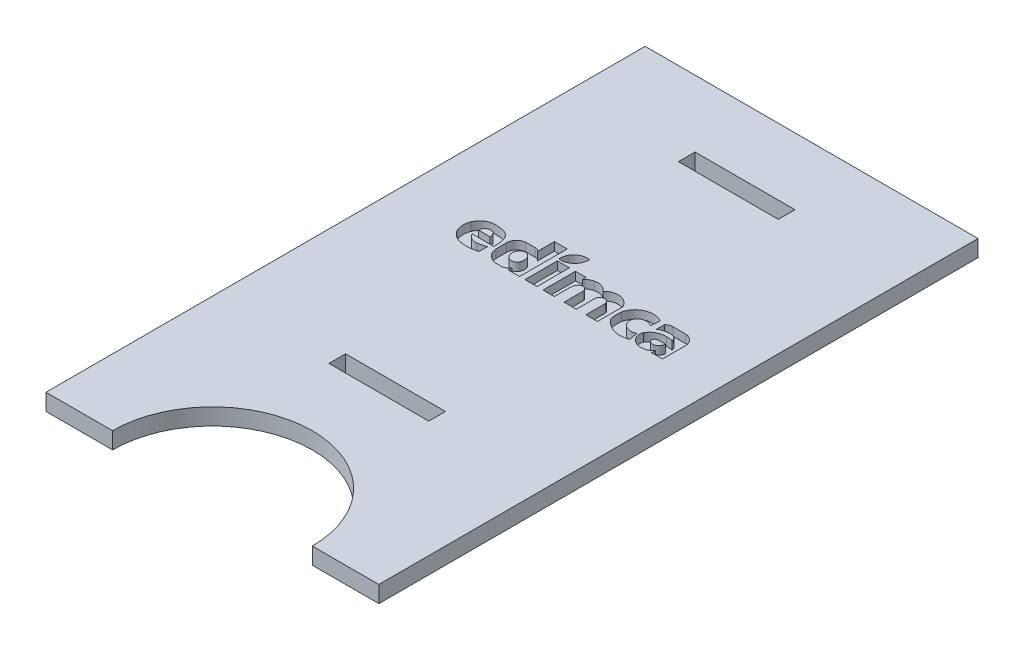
ISO-10303-21;
HEADER;
FILE_DESCRIPTION(('STEP AP214'),'2;1');
FILE_NAME('part.step','',(''),(''),'','','');
FILE_SCHEMA(('AUTOMOTIVE_DESIGN { 1 0 10303 214 1 1 1 1 }'));
ENDSEC;
DATA;
#1=APPLICATION_CONTEXT('core data for automotive mechanical design processes');
#2=APPLICATION_PROTOCOL_DEFINITION('international standard','automotive_design',2000,#1);
#3=PRODUCT_CONTEXT('',#1,'mechanical');
#4=PRODUCT('Part','Part','',(#3));
#5=PRODUCT_RELATED_PRODUCT_CATEGORY('part','',(#4));
#6=PRODUCT_DEFINITION_FORMATION('','',#4);
#7=PRODUCT_DEFINITION_CONTEXT('part definition',#1,'design');
#8=PRODUCT_DEFINITION('design','',#6,#7);
#9=PRODUCT_DEFINITION_SHAPE('','',#8);
#10=(LENGTH_UNIT() NAMED_UNIT(*) SI_UNIT(.MILLI.,.METRE.));
#11=(NAMED_UNIT(*) PLANE_ANGLE_UNIT() SI_UNIT($,.RADIAN.));
#12=(NAMED_UNIT(*) SI_UNIT($,.STERADIAN.) SOLID_ANGLE_UNIT());
#13=UNCERTAINTY_MEASURE_WITH_UNIT(LENGTH_MEASURE(1.E-05),#10,'distance_accuracy_value','');
#14=(GEOMETRIC_REPRESENTATION_CONTEXT(3) GLOBAL_UNCERTAINTY_ASSIGNED_CONTEXT((#13)) GLOBAL_UNIT_ASSIGNED_CONTEXT((#10,
#11,#12)) REPRESENTATION_CONTEXT('',''));
#15=CARTESIAN_POINT('',(0.,0.,0.));
#16=DIRECTION('',(0.,0.,1.));
#17=DIRECTION('',(1.,0.,0.));
#18=AXIS2_PLACEMENT_3D('',#15,#16,#17);
#19=CARTESIAN_POINT('',(0.,5.,0.));
#20=DIRECTION('',(0.,1.,0.));
#21=DIRECTION('',(0.,0.,1.));
#22=AXIS2_PLACEMENT_3D('',#19,#20,#21);
#23=PLANE('',#22);
#24=DIRECTION('',(-1.,0.,0.));
#25=VECTOR('',#24,1.);
#26=CARTESIAN_POINT('',(0.,5.,130.90636175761));
#27=LINE('',#26,#25);
#28=CARTESIAN_POINT('',(305.516384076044,5.,130.90636175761));
#29=VERTEX_POINT('',#28);
#30=CARTESIAN_POINT('',(285.516384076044,5.,130.90636175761));
#31=VERTEX_POINT('',#30);
#32=EDGE_CURVE('E1159',#29,#31,#27,.T.);
#33=ORIENTED_EDGE('',*,*,#32,.F.);
#34=CARTESIAN_POINT('',(335.516384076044,5.,130.906361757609));
#35=DIRECTION('',(0.,1.,0.));
#36=DIRECTION('',(0.,0.,1.));
#37=AXIS2_PLACEMENT_3D('',#34,#35,#36);
#38=CIRCLE('',#37,30.);
#39=CARTESIAN_POINT('',(365.516384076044,5.,130.90636175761));
#40=VERTEX_POINT('',#39);
#41=EDGE_CURVE('E1162',#29,#40,#38,.F.);
#42=ORIENTED_EDGE('',*,*,#41,.T.);
#43=DIRECTION('',(1.,0.,0.));
#44=VECTOR('',#43,1.);
#45=CARTESIAN_POINT('',(0.,5.,130.90636175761));
#46=LINE('',#45,#44);
#47=CARTESIAN_POINT('',(385.516384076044,5.,130.90636175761));
#48=VERTEX_POINT('',#47);
#49=EDGE_CURVE('E1165',#40,#48,#46,.T.);
#50=ORIENTED_EDGE('',*,*,#49,.T.);
#51=DIRECTION('',(0.,0.,-1.));
#52=VECTOR('',#51,1.);
#53=CARTESIAN_POINT('',(385.516384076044,5.,0.));
#54=LINE('',#53,#52);
#55=CARTESIAN_POINT('',(385.516384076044,5.,-49.0936382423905));
#56=VERTEX_POINT('',#55);
#57=EDGE_CURVE('E1168',#48,#56,#54,.T.);
#58=ORIENTED_EDGE('',*,*,#57,.T.);
#59=DIRECTION('',(1.,0.,0.));
#60=VECTOR('',#59,1.);
#61=CARTESIAN_POINT('',(0.,5.,-49.0936382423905));
#62=LINE('',#61,#60);
#63=CARTESIAN_POINT('',(285.516384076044,5.,-49.0936382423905));
#64=VERTEX_POINT('',#63);
#65=EDGE_CURVE('E1170',#64,#56,#62,.T.);
#66=ORIENTED_EDGE('',*,*,#65,.F.);
#67=DIRECTION('',(0.,0.,-1.));
#68=VECTOR('',#67,1.);
#69=CARTESIAN_POINT('',(285.516384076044,5.,0.));
#70=LINE('',#69,#68);
#71=EDGE_CURVE('E1173',#31,#64,#70,.T.);
#72=ORIENTED_EDGE('',*,*,#71,.F.);
#73=EDGE_LOOP('',(#33,#42,#50,#58,#66,#72));
#74=FACE_BOUND('',#73,.T.);
#75=DIRECTION('',(0.,0.,1.));
#76=VECTOR('',#75,1.);
#77=CARTESIAN_POINT('',(320.516384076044,5.,0.));
#78=LINE('',#77,#76);
#79=CARTESIAN_POINT('',(320.516384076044,5.,75.9063617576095));
#80=VERTEX_POINT('',#79);
#81=CARTESIAN_POINT('',(320.516384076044,5.,80.9063617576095));
#82=VERTEX_POINT('',#81);
#83=EDGE_CURVE('E1147',#80,#82,#78,.T.);
#84=ORIENTED_EDGE('',*,*,#83,.F.);
#85=DIRECTION('',(-1.,0.,0.));
#86=VECTOR('',#85,1.);
#87=CARTESIAN_POINT('',(0.,5.,75.9063617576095));
#88=LINE('',#87,#86);
#89=CARTESIAN_POINT('',(350.516384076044,5.,75.9063617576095));
#90=VERTEX_POINT('',#89);
#91=EDGE_CURVE('E1150',#90,#80,#88,.T.);
#92=ORIENTED_EDGE('',*,*,#91,.F.);
#93=DIRECTION('',(0.,0.,-1.));
#94=VECTOR('',#93,1.);
#95=CARTESIAN_POINT('',(350.516384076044,5.,0.));
#96=LINE('',#95,#94);
#97=CARTESIAN_POINT('',(350.516384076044,5.,80.9063617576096));
#98=VERTEX_POINT('',#97);
#99=EDGE_CURVE('E1153',#98,#90,#96,.T.);
#100=ORIENTED_EDGE('',*,*,#99,.F.);
#101=DIRECTION('',(1.,0.,0.));
#102=VECTOR('',#101,1.);
#103=CARTESIAN_POINT('',(0.,5.,80.9063617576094));
#104=LINE('',#103,#102);
#105=EDGE_CURVE('E1156',#82,#98,#104,.T.);
#106=ORIENTED_EDGE('',*,*,#105,.F.);
#107=EDGE_LOOP('',(#84,#92,#100,#106));
#108=FACE_BOUND('',#107,.T.);
#109=DIRECTION('',(0.,0.,-1.));
#110=VECTOR('',#109,1.);
#111=CARTESIAN_POINT('',(320.516384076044,5.,0.));
#112=LINE('',#111,#110);
#113=CARTESIAN_POINT('',(320.516384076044,5.,-24.0936382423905));
#114=VERTEX_POINT('',#113);
#115=CARTESIAN_POINT('',(320.516384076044,5.,-29.0936382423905));
#116=VERTEX_POINT('',#115);
#117=EDGE_CURVE('E1137',#114,#116,#112,.T.);
#118=ORIENTED_EDGE('',*,*,#117,.T.);
#119=DIRECTION('',(1.,0.,0.));
#120=VECTOR('',#119,1.);
#121=CARTESIAN_POINT('',(0.,5.,-29.0936382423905));
#122=LINE('',#121,#120);
#123=CARTESIAN_POINT('',(350.516384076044,5.,-29.0936382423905));
#124=VERTEX_POINT('',#123);
#125=EDGE_CURVE('E1140',#116,#124,#122,.T.);
#126=ORIENTED_EDGE('',*,*,#125,.T.);
#127=DIRECTION('',(0.,0.,1.));
#128=VECTOR('',#127,1.);
#129=CARTESIAN_POINT('',(350.516384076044,5.,0.));
#130=LINE('',#129,#128);
#131=CARTESIAN_POINT('',(350.516384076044,5.,-24.0936382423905));
#132=VERTEX_POINT('',#131);
#133=EDGE_CURVE('E1143',#124,#132,#130,.T.);
#134=ORIENTED_EDGE('',*,*,#133,.T.);
#135=DIRECTION('',(-1.,0.,0.));
#136=VECTOR('',#135,1.);
#137=CARTESIAN_POINT('',(0.,5.,-24.0936382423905));
#138=LINE('',#137,#136);
#139=EDGE_CURVE('E1145',#132,#114,#138,.T.);
#140=ORIENTED_EDGE('',*,*,#139,.T.);
#141=EDGE_LOOP('',(#118,#126,#134,#140));
#142=FACE_BOUND('',#141,.T.);
#143=CARTESIAN_POINT('',(331.924231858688,5.,18.7683134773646));
#144=DIRECTION('',(0.,1.,0.));
#145=DIRECTION('',(0.,0.,-1.));
#146=AXIS2_PLACEMENT_3D('',#143,#144,#145);
#147=CIRCLE('',#146,4.09057300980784);
#148=CARTESIAN_POINT('',(332.656842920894,5.,14.7438795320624));
#149=VERTEX_POINT('',#148);
#150=CARTESIAN_POINT('',(327.852008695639,5.,19.1553355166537));
#151=VERTEX_POINT('',#150);
#152=EDGE_CURVE('E1096',#149,#151,#147,.T.);
#153=ORIENTED_EDGE('',*,*,#152,.F.);
#154=CARTESIAN_POINT('',(328.46526504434,5.,15.0009037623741));
#155=DIRECTION('',(0.,1.,0.));
#156=DIRECTION('',(0.,0.,1.));
#157=AXIS2_PLACEMENT_3D('',#154,#155,#156);
#158=CIRCLE('',#157,4.19945074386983);
#159=EDGE_CURVE('E1125',#151,#149,#158,.T.);
#160=ORIENTED_EDGE('',*,*,#159,.F.);
#161=EDGE_LOOP('',(#153,#160));
#162=FACE_BOUND('',#161,.T.);
#163=CARTESIAN_POINT('',(362.657172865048,5.,22.52209451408));
#164=DIRECTION('',(0.,1.,0.));
#165=DIRECTION('',(0.,0.,1.));
#166=AXIS2_PLACEMENT_3D('',#163,#164,#165);
#167=CIRCLE('',#166,2.85873191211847);
#168=CARTESIAN_POINT('',(362.657172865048,5.,19.6633626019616));
#169=VERTEX_POINT('',#168);
#170=CARTESIAN_POINT('',(360.823311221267,5.,20.3290829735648));
#171=VERTEX_POINT('',#170);
#172=EDGE_CURVE('E1008',#169,#171,#167,.T.);
#173=ORIENTED_EDGE('',*,*,#172,.F.);
#174=DIRECTION('',(-1.,0.,0.));
#175=VECTOR('',#174,1.);
#176=CARTESIAN_POINT('',(366.474675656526,5.,19.6633626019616));
#177=LINE('',#176,#175);
#178=CARTESIAN_POINT('',(366.474675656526,5.,19.6633626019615));
#179=VERTEX_POINT('',#178);
#180=EDGE_CURVE('E1021',#179,#169,#177,.T.);
#181=ORIENTED_EDGE('',*,*,#180,.F.);
#182=CARTESIAN_POINT('',(366.279258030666,5.,22.8272305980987));
#183=DIRECTION('',(0.,1.,0.));
#184=DIRECTION('',(0.,0.,1.));
#185=AXIS2_PLACEMENT_3D('',#182,#183,#184);
#186=CIRCLE('',#185,3.16989727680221);
#187=CARTESIAN_POINT('',(369.449155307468,5.,22.8272305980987));
#188=VERTEX_POINT('',#187);
#189=EDGE_CURVE('E1089',#188,#179,#186,.T.);
#190=ORIENTED_EDGE('',*,*,#189,.F.);
#191=DIRECTION('',(0.,0.,-1.));
#192=VECTOR('',#191,1.);
#193=CARTESIAN_POINT('',(369.449155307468,5.,29.640360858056));
#194=LINE('',#193,#192);
#195=CARTESIAN_POINT('',(369.449155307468,5.,29.640360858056));
#196=VERTEX_POINT('',#195);
#197=EDGE_CURVE('E1086',#196,#188,#194,.T.);
#198=ORIENTED_EDGE('',*,*,#197,.F.);
#199=DIRECTION('',(1.,0.,0.));
#200=VECTOR('',#199,1.);
#201=CARTESIAN_POINT('',(366.228624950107,5.,29.640360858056));
#202=LINE('',#201,#200);
#203=CARTESIAN_POINT('',(366.228624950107,5.,29.640360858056));
#204=VERTEX_POINT('',#203);
#205=EDGE_CURVE('E1083',#204,#196,#202,.T.);
#206=ORIENTED_EDGE('',*,*,#205,.F.);
#207=DIRECTION('',(0.,0.,1.));
#208=VECTOR('',#207,1.);
#209=CARTESIAN_POINT('',(366.228624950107,5.,28.5048391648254));
#210=LINE('',#209,#208);
#211=CARTESIAN_POINT('',(366.228624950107,5.,28.5048391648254));
#212=VERTEX_POINT('',#211);
#213=EDGE_CURVE('E1080',#212,#204,#210,.T.);
#214=ORIENTED_EDGE('',*,*,#213,.F.);
#215=CARTESIAN_POINT('',(363.25860408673,5.,26.0695462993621));
#216=DIRECTION('',(0.,1.,0.));
#217=DIRECTION('',(0.,0.,-1.));
#218=AXIS2_PLACEMENT_3D('',#215,#216,#217);
#219=CIRCLE('',#218,3.84079096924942);
#220=CARTESIAN_POINT('',(360.823311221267,5.,29.0395671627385));
#221=VERTEX_POINT('',#220);
#222=EDGE_CURVE('E1077',#221,#212,#219,.T.);
#223=ORIENTED_EDGE('',*,*,#222,.F.);
#224=CARTESIAN_POINT('',(362.48080291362,5.,26.6347427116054));
#225=DIRECTION('',(0.,1.,0.));
#226=DIRECTION('',(0.,0.,-1.));
#227=AXIS2_PLACEMENT_3D('',#224,#225,#226);
#228=CIRCLE('',#227,2.92069501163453);
#229=CARTESIAN_POINT('',(359.721950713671,5.,25.6759967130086));
#230=VERTEX_POINT('',#229);
#231=EDGE_CURVE('E1074',#230,#221,#228,.T.);
#232=ORIENTED_EDGE('',*,*,#231,.F.);
#233=CARTESIAN_POINT('',(363.926901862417,5.,28.1006618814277));
#234=DIRECTION('',(0.,1.,0.));
#235=DIRECTION('',(0.,0.,-1.));
#236=AXIS2_PLACEMENT_3D('',#233,#234,#235);
#237=CIRCLE('',#236,4.85392782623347);
#238=CARTESIAN_POINT('',(364.229876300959,5.,23.2561988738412));
#239=VERTEX_POINT('',#238);
#240=EDGE_CURVE('E1071',#239,#230,#237,.T.);
#241=ORIENTED_EDGE('',*,*,#240,.F.);
#242=CARTESIAN_POINT('',(364.694434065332,5.,30.817951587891));
#243=DIRECTION('',(0.,1.,0.));
#244=DIRECTION('',(0.,0.,-1.));
#245=AXIS2_PLACEMENT_3D('',#242,#243,#244);
#246=CIRCLE('',#245,7.57600937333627);
#247=CARTESIAN_POINT('',(366.097516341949,5.,23.3730017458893));
#248=VERTEX_POINT('',#247);
#249=EDGE_CURVE('E1068',#248,#239,#246,.T.);
#250=ORIENTED_EDGE('',*,*,#249,.F.);
#251=CARTESIAN_POINT('',(364.436602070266,5.,23.5797275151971));
#252=DIRECTION('',(0.,-1.,0.));
#253=DIRECTION('',(0.,0.,-1.));
#254=AXIS2_PLACEMENT_3D('',#251,#252,#253);
#255=CIRCLE('',#254,1.67372989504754);
#256=CARTESIAN_POINT('',(364.229876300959,5.,21.9188132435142));
#257=VERTEX_POINT('',#256);
#258=EDGE_CURVE('E1065',#257,#248,#255,.T.);
#259=ORIENTED_EDGE('',*,*,#258,.F.);
#260=CARTESIAN_POINT('',(363.944574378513,5.,27.6904492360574));
#261=DIRECTION('',(0.,-1.,0.));
#262=DIRECTION('',(0.,0.,1.));
#263=AXIS2_PLACEMENT_3D('',#260,#261,#262);
#264=CIRCLE('',#263,5.77868317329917);
#265=CARTESIAN_POINT('',(360.823311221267,5.,22.8272305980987));
#266=VERTEX_POINT('',#265);
#267=EDGE_CURVE('E1062',#266,#257,#264,.T.);
#268=ORIENTED_EDGE('',*,*,#267,.F.);
#269=DIRECTION('',(0.,0.,1.));
#270=VECTOR('',#269,1.);
#271=CARTESIAN_POINT('',(360.823311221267,5.,20.3290829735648));
#272=LINE('',#271,#270);
#273=EDGE_CURVE('E1059',#171,#266,#272,.T.);
#274=ORIENTED_EDGE('',*,*,#273,.F.);
#275=EDGE_LOOP('',(#173,#181,#190,#198,#206,#214,#223,#232,#241,#250,#259,#268,#274));
#276=FACE_BOUND('',#275,.T.);
#277=CARTESIAN_POINT('',(309.058863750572,5.,11.8461626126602));
#278=DIRECTION('',(0.,-1.,0.));
#279=DIRECTION('',(0.,0.,1.));
#280=AXIS2_PLACEMENT_3D('',#277,#278,#279);
#281=CIRCLE('',#280,15.6733500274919);
#282=CARTESIAN_POINT('',(313.946053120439,5.,26.7380826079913));
#283=VERTEX_POINT('',#282);
#284=CARTESIAN_POINT('',(311.41066143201,5.,27.342063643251));
#285=VERTEX_POINT('',#284);
#286=EDGE_CURVE('E929',#283,#285,#281,.T.);
#287=ORIENTED_EDGE('',*,*,#286,.F.);
#288=DIRECTION('',(0.,0.,-1.));
#289=VECTOR('',#288,1.);
#290=CARTESIAN_POINT('',(313.946053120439,5.,26.7380826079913));
#291=LINE('',#290,#289);
#292=CARTESIAN_POINT('',(313.946053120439,5.,29.2323250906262));
#293=VERTEX_POINT('',#292);
#294=EDGE_CURVE('E955',#293,#283,#291,.T.);
#295=ORIENTED_EDGE('',*,*,#294,.F.);
#296=CARTESIAN_POINT('',(310.619958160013,5.,18.8663236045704));
#297=DIRECTION('',(0.,1.,0.));
#298=DIRECTION('',(0.,0.,1.));
#299=AXIS2_PLACEMENT_3D('',#296,#297,#298);
#300=CIRCLE('',#299,10.8865464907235);
#301=CARTESIAN_POINT('',(309.058863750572,5.,29.640360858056));
#302=VERTEX_POINT('',#301);
#303=EDGE_CURVE('E952',#302,#293,#300,.T.);
#304=ORIENTED_EDGE('',*,*,#303,.F.);
#305=CARTESIAN_POINT('',(309.661690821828,5.,24.5611035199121));
#306=DIRECTION('',(0.,1.,0.));
#307=DIRECTION('',(0.,0.,1.));
#308=AXIS2_PLACEMENT_3D('',#305,#306,#307);
#309=CIRCLE('',#308,5.11490523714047);
#310=CARTESIAN_POINT('',(304.955644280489,5.,26.5649452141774));
#311=VERTEX_POINT('',#310);
#312=EDGE_CURVE('E949',#311,#302,#309,.T.);
#313=ORIENTED_EDGE('',*,*,#312,.F.);
#314=CARTESIAN_POINT('',(310.229724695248,5.,24.7078774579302));
#315=DIRECTION('',(0.,1.,0.));
#316=DIRECTION('',(0.,0.,1.));
#317=AXIS2_PLACEMENT_3D('',#314,#315,#316);
#318=CIRCLE('',#317,5.59147787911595);
#319=CARTESIAN_POINT('',(305.016857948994,5.,22.6853431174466));
#320=VERTEX_POINT('',#319);
#321=EDGE_CURVE('E943',#320,#311,#318,.T.);
#322=ORIENTED_EDGE('',*,*,#321,.F.);
#323=CARTESIAN_POINT('',(314.910366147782,5.,25.6791004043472));
#324=CARTESIAN_POINT('',(314.787058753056,5.,22.9584509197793));
#325=CARTESIAN_POINT('',(314.622181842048,5.,20.2673457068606));
#326=CARTESIAN_POINT('',(310.991091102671,5.,19.8763255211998));
#327=CARTESIAN_POINT('',(307.972239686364,5.,19.5512353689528));
#328=CARTESIAN_POINT('',(306.38289729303,5.,20.1105314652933));
#329=CARTESIAN_POINT('',(305.016857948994,5.,22.6853431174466));
#330=B_SPLINE_CURVE_WITH_KNOTS('',3,(#323,#324,#325,#326,#327,#328,#329),.UNSPECIFIED.,.F.,.F.,
(4,3,4),(0.0496019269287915,1.,2.),.UNSPECIFIED.);
#331=CARTESIAN_POINT('',(314.910366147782,5.,25.6791004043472));
#332=VERTEX_POINT('',#331);
#333=EDGE_CURVE('E938',#332,#320,#330,.T.);
#334=ORIENTED_EDGE('',*,*,#333,.F.);
#335=DIRECTION('',(1.,0.,0.));
#336=VECTOR('',#335,1.);
#337=CARTESIAN_POINT('',(308.362208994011,5.,25.6791004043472));
#338=LINE('',#337,#336);
#339=CARTESIAN_POINT('',(308.362208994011,5.,25.6791004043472));
#340=VERTEX_POINT('',#339);
#341=EDGE_CURVE('E935',#340,#332,#338,.T.);
#342=ORIENTED_EDGE('',*,*,#341,.F.);
#343=CARTESIAN_POINT('',(310.980174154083,5.,24.5056001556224));
#344=DIRECTION('',(0.,-1.,0.));
#345=DIRECTION('',(0.,0.,1.));
#346=AXIS2_PLACEMENT_3D('',#343,#344,#345);
#347=CIRCLE('',#346,2.86894482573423);
#348=EDGE_CURVE('E931',#285,#340,#347,.T.);
#349=ORIENTED_EDGE('',*,*,#348,.F.);
#350=EDGE_LOOP('',(#287,#295,#304,#313,#322,#334,#342,#349));
#351=FACE_BOUND('',#350,.T.);
#352=DIRECTION('',(0.,0.,1.));
#353=VECTOR('',#352,1.);
#354=CARTESIAN_POINT('',(322.669782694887,5.,20.3291474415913));
#355=LINE('',#354,#353);
#356=CARTESIAN_POINT('',(322.669782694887,5.,15.3328519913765));
#357=VERTEX_POINT('',#356);
#358=CARTESIAN_POINT('',(322.669782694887,5.,20.3291474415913));
#359=VERTEX_POINT('',#358);
#360=EDGE_CURVE('E803',#357,#359,#355,.T.);
#361=ORIENTED_EDGE('',*,*,#360,.F.);
#362=DIRECTION('',(-1.,0.,0.));
#363=VECTOR('',#362,1.);
#364=CARTESIAN_POINT('',(322.669782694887,5.,15.3328519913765));
#365=LINE('',#364,#363);
#366=CARTESIAN_POINT('',(326.530556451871,5.,15.3328519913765));
#367=VERTEX_POINT('',#366);
#368=EDGE_CURVE('E2203',#367,#357,#365,.T.);
#369=ORIENTED_EDGE('',*,*,#368,.F.);
#370=DIRECTION('',(0.,0.,-1.));
#371=VECTOR('',#370,1.);
#372=CARTESIAN_POINT('',(326.530556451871,5.,15.3328519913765));
#373=LINE('',#372,#371);
#374=CARTESIAN_POINT('',(326.530556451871,5.,29.640360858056));
#375=VERTEX_POINT('',#374);
#376=EDGE_CURVE('E2207',#375,#367,#373,.T.);
#377=ORIENTED_EDGE('',*,*,#376,.F.);
#378=DIRECTION('',(1.,0.,0.));
#379=VECTOR('',#378,1.);
#380=CARTESIAN_POINT('',(326.530556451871,5.,29.640360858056));
#381=LINE('',#380,#379);
#382=CARTESIAN_POINT('',(323.123991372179,5.,29.640360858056));
#383=VERTEX_POINT('',#382);
#384=EDGE_CURVE('E2210',#383,#375,#381,.T.);
#385=ORIENTED_EDGE('',*,*,#384,.F.);
#386=DIRECTION('',(0.,0.,1.));
#387=VECTOR('',#386,1.);
#388=CARTESIAN_POINT('',(323.123991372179,5.,29.640360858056));
#389=LINE('',#388,#387);
#390=CARTESIAN_POINT('',(323.123991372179,5.,28.5048391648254));
#391=VERTEX_POINT('',#390);
#392=EDGE_CURVE('E2213',#391,#383,#389,.T.);
#393=ORIENTED_EDGE('',*,*,#392,.F.);
#394=CARTESIAN_POINT('',(321.054879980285,5.,27.4331840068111));
#395=DIRECTION('',(0.,1.,0.));
#396=DIRECTION('',(0.,0.,1.));
#397=AXIS2_PLACEMENT_3D('',#394,#395,#396);
#398=CIRCLE('',#397,2.33016452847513);
#399=CARTESIAN_POINT('',(321.182414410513,5.,29.759855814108));
#400=VERTEX_POINT('',#399);
#401=EDGE_CURVE('E2216',#400,#391,#398,.T.);
#402=ORIENTED_EDGE('',*,*,#401,.F.);
#403=DIRECTION('',(1.,0.,0.));
#404=VECTOR('',#403,1.);
#405=CARTESIAN_POINT('',(321.182414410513,5.,29.759855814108));
#406=LINE('',#405,#404);
#407=CARTESIAN_POINT('',(319.523475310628,5.,29.759855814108));
#408=VERTEX_POINT('',#407);
#409=EDGE_CURVE('E2219',#408,#400,#406,.T.);
#410=ORIENTED_EDGE('',*,*,#409,.F.);
#411=CARTESIAN_POINT('',(319.887118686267,5.,25.6759967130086));
#412=DIRECTION('',(0.,1.,0.));
#413=DIRECTION('',(0.,0.,1.));
#414=AXIS2_PLACEMENT_3D('',#411,#412,#413);
#415=CIRCLE('',#414,4.10001727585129);
#416=CARTESIAN_POINT('',(315.800459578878,5.,26.006691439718));
#417=VERTEX_POINT('',#416);
#418=EDGE_CURVE('E2222',#417,#408,#415,.T.);
#419=ORIENTED_EDGE('',*,*,#418,.F.);
#420=DIRECTION('',(0.,0.,1.));
#421=VECTOR('',#420,1.);
#422=CARTESIAN_POINT('',(315.800459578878,5.,26.006691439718));
#423=LINE('',#422,#421);
#424=CARTESIAN_POINT('',(315.800459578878,5.,22.8272306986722));
#425=VERTEX_POINT('',#424);
#426=EDGE_CURVE('E2225',#425,#417,#423,.T.);
#427=ORIENTED_EDGE('',*,*,#426,.F.);
#428=CARTESIAN_POINT('',(318.811101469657,5.,22.800652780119));
#429=DIRECTION('',(0.,1.,0.));
#430=DIRECTION('',(0.,0.,-1.));
#431=AXIS2_PLACEMENT_3D('',#428,#429,#430);
#432=CIRCLE('',#431,3.01075920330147);
#433=CARTESIAN_POINT('',(318.625180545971,5.,19.7956395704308));
#434=VERTEX_POINT('',#433);
#435=EDGE_CURVE('E2228',#434,#425,#432,.T.);
#436=ORIENTED_EDGE('',*,*,#435,.F.);
#437=DIRECTION('',(-1.,0.,0.));
#438=VECTOR('',#437,1.);
#439=CARTESIAN_POINT('',(318.625180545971,5.,19.7956395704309));
#440=LINE('',#439,#438);
#441=CARTESIAN_POINT('',(321.323079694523,5.,19.7956395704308));
#442=VERTEX_POINT('',#441);
#443=EDGE_CURVE('E2231',#442,#434,#440,.T.);
#444=ORIENTED_EDGE('',*,*,#443,.F.);
#445=CARTESIAN_POINT('',(321.323079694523,5.,21.7620956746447));
#446=DIRECTION('',(0.,1.,0.));
#447=DIRECTION('',(0.,0.,-1.));
#448=AXIS2_PLACEMENT_3D('',#445,#446,#447);
#449=CIRCLE('',#448,1.96645610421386);
#450=EDGE_CURVE('E2234',#359,#442,#449,.T.);
#451=ORIENTED_EDGE('',*,*,#450,.F.);
#452=EDGE_LOOP('',(#361,#369,#377,#385,#393,#402,#410,#419,#427,#436,#444,#451));
#453=FACE_BOUND('',#452,.T.);
#454=DIRECTION('',(0.,0.,1.));
#455=VECTOR('',#454,1.);
#456=CARTESIAN_POINT('',(328.153364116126,5.,29.640360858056));
#457=LINE('',#456,#455);
#458=CARTESIAN_POINT('',(328.153364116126,5.,19.9001108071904));
#459=VERTEX_POINT('',#458);
#460=CARTESIAN_POINT('',(328.153364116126,5.,29.640360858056));
#461=VERTEX_POINT('',#460);
#462=EDGE_CURVE('E735',#459,#461,#457,.T.);
#463=ORIENTED_EDGE('',*,*,#462,.F.);
#464=DIRECTION('',(-1.,0.,0.));
#465=VECTOR('',#464,1.);
#466=CARTESIAN_POINT('',(328.153364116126,5.,19.9001108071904));
#467=LINE('',#466,#465);
#468=CARTESIAN_POINT('',(331.753956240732,5.,19.9001108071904));
#469=VERTEX_POINT('',#468);
#470=EDGE_CURVE('E771',#469,#459,#467,.T.);
#471=ORIENTED_EDGE('',*,*,#470,.F.);
#472=DIRECTION('',(0.,0.,-1.));
#473=VECTOR('',#472,1.);
#474=CARTESIAN_POINT('',(331.753956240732,5.,19.9001108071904));
#475=LINE('',#474,#473);
#476=CARTESIAN_POINT('',(331.753956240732,5.,29.640360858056));
#477=VERTEX_POINT('',#476);
#478=EDGE_CURVE('E785',#477,#469,#475,.T.);
#479=ORIENTED_EDGE('',*,*,#478,.F.);
#480=DIRECTION('',(1.,0.,0.));
#481=VECTOR('',#480,1.);
#482=CARTESIAN_POINT('',(331.753956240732,5.,29.640360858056));
#483=LINE('',#482,#481);
#484=EDGE_CURVE('E782',#461,#477,#483,.T.);
#485=ORIENTED_EDGE('',*,*,#484,.F.);
#486=EDGE_LOOP('',(#463,#471,#479,#485));
#487=FACE_BOUND('',#486,.T.);
#488=CARTESIAN_POINT('',(346.079259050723,5.,23.8382929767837));
#489=DIRECTION('',(0.,1.,0.));
#490=DIRECTION('',(0.,0.,-1.));
#491=AXIS2_PLACEMENT_3D('',#488,#489,#490);
#492=CIRCLE('',#491,4.26020677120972);
#493=CARTESIAN_POINT('',(349.922303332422,5.,21.9997140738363));
#494=VERTEX_POINT('',#493);
#495=CARTESIAN_POINT('',(342.91638461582,5.,20.9842454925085));
#496=VERTEX_POINT('',#495);
#497=EDGE_CURVE('E59',#494,#496,#492,.T.);
#498=ORIENTED_EDGE('',*,*,#497,.F.);
#499=DIRECTION('',(0.,0.,-1.));
#500=VECTOR('',#499,1.);
#501=CARTESIAN_POINT('',(349.922303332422,5.,21.9997140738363));
#502=LINE('',#501,#500);
#503=CARTESIAN_POINT('',(349.922303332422,5.,29.640360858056));
#504=VERTEX_POINT('',#503);
#505=EDGE_CURVE('E636',#504,#494,#502,.T.);
#506=ORIENTED_EDGE('',*,*,#505,.F.);
#507=DIRECTION('',(1.,0.,0.));
#508=VECTOR('',#507,1.);
#509=CARTESIAN_POINT('',(349.922303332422,5.,29.640360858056));
#510=LINE('',#509,#508);
#511=CARTESIAN_POINT('',(346.454744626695,5.,29.640360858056));
#512=VERTEX_POINT('',#511);
#513=EDGE_CURVE('E728',#512,#504,#510,.T.);
#514=ORIENTED_EDGE('',*,*,#513,.F.);
#515=DIRECTION('',(0.,0.,1.));
#516=VECTOR('',#515,1.);
#517=CARTESIAN_POINT('',(346.454744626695,5.,29.640360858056));
#518=LINE('',#517,#516);
#519=CARTESIAN_POINT('',(346.454744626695,5.,23.7563918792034));
#520=VERTEX_POINT('',#519);
#521=EDGE_CURVE('E725',#520,#512,#518,.T.);
#522=ORIENTED_EDGE('',*,*,#521,.F.);
#523=CARTESIAN_POINT('',(345.030645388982,5.,24.0649036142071));
#524=DIRECTION('',(0.,-1.,0.));
#525=DIRECTION('',(0.,0.,-1.));
#526=AXIS2_PLACEMENT_3D('',#523,#524,#525);
#527=CIRCLE('',#526,1.45713353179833);
#528=CARTESIAN_POINT('',(343.573511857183,5.,24.0649036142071));
#529=VERTEX_POINT('',#528);
#530=EDGE_CURVE('E722',#529,#520,#527,.T.);
#531=ORIENTED_EDGE('',*,*,#530,.F.);
#532=DIRECTION('',(0.,0.,-1.));
#533=VECTOR('',#532,1.);
#534=CARTESIAN_POINT('',(343.573511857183,5.,29.640360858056));
#535=LINE('',#534,#533);
#536=CARTESIAN_POINT('',(343.573511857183,5.,29.640360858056));
#537=VERTEX_POINT('',#536);
#538=EDGE_CURVE('E719',#537,#529,#535,.T.);
#539=ORIENTED_EDGE('',*,*,#538,.F.);
#540=DIRECTION('',(1.,0.,0.));
#541=VECTOR('',#540,1.);
#542=CARTESIAN_POINT('',(343.573511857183,5.,29.640360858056));
#543=LINE('',#542,#541);
#544=CARTESIAN_POINT('',(339.899302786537,5.,29.640360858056));
#545=VERTEX_POINT('',#544);
#546=EDGE_CURVE('E716',#545,#537,#543,.T.);
#547=ORIENTED_EDGE('',*,*,#546,.F.);
#548=DIRECTION('',(0.,0.,1.));
#549=VECTOR('',#548,1.);
#550=CARTESIAN_POINT('',(339.899302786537,5.,29.640360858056));
#551=LINE('',#550,#549);
#552=CARTESIAN_POINT('',(339.899302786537,5.,23.8135339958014));
#553=VERTEX_POINT('',#552);
#554=EDGE_CURVE('E713',#553,#545,#551,.T.);
#555=ORIENTED_EDGE('',*,*,#554,.F.);
#556=CARTESIAN_POINT('',(338.588726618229,5.,24.0066642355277));
#557=DIRECTION('',(0.,-1.,0.));
#558=DIRECTION('',(0.,0.,-1.));
#559=AXIS2_PLACEMENT_3D('',#556,#557,#558);
#560=CIRCLE('',#559,1.32472985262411);
#561=CARTESIAN_POINT('',(338.040597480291,5.,22.800652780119));
#562=VERTEX_POINT('',#561);
#563=EDGE_CURVE('E710',#562,#553,#560,.T.);
#564=ORIENTED_EDGE('',*,*,#563,.F.);
#565=CARTESIAN_POINT('',(339.04162080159,5.,24.6201083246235));
#566=DIRECTION('',(0.,-1.,0.));
#567=DIRECTION('',(0.,0.,-1.));
#568=AXIS2_PLACEMENT_3D('',#565,#566,#567);
#569=CIRCLE('',#568,2.07664781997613);
#570=CARTESIAN_POINT('',(336.964972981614,5.,24.6201083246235));
#571=VERTEX_POINT('',#570);
#572=EDGE_CURVE('E707',#571,#562,#569,.T.);
#573=ORIENTED_EDGE('',*,*,#572,.F.);
#574=DIRECTION('',(0.,0.,-1.));
#575=VECTOR('',#574,1.);
#576=CARTESIAN_POINT('',(336.964972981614,5.,29.640360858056));
#577=LINE('',#576,#575);
#578=CARTESIAN_POINT('',(336.964972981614,5.,29.640360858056));
#579=VERTEX_POINT('',#578);
#580=EDGE_CURVE('E704',#579,#571,#577,.T.);
#581=ORIENTED_EDGE('',*,*,#580,.F.);
#582=DIRECTION('',(1.,0.,0.));
#583=VECTOR('',#582,1.);
#584=CARTESIAN_POINT('',(336.964972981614,5.,29.640360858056));
#585=LINE('',#584,#583);
#586=CARTESIAN_POINT('',(333.580784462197,5.,29.640360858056));
#587=VERTEX_POINT('',#586);
#588=EDGE_CURVE('E701',#587,#579,#585,.T.);
#589=ORIENTED_EDGE('',*,*,#588,.F.);
#590=DIRECTION('',(0.,0.,1.));
#591=VECTOR('',#590,1.);
#592=CARTESIAN_POINT('',(333.580784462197,5.,29.640360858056));
#593=LINE('',#592,#591);
#594=CARTESIAN_POINT('',(333.580784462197,5.,19.9001108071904));
#595=VERTEX_POINT('',#594);
#596=EDGE_CURVE('E698',#595,#587,#593,.T.);
#597=ORIENTED_EDGE('',*,*,#596,.F.);
#598=DIRECTION('',(-1.,0.,0.));
#599=VECTOR('',#598,1.);
#600=CARTESIAN_POINT('',(333.580784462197,5.,19.9001108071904));
#601=LINE('',#600,#599);
#602=CARTESIAN_POINT('',(336.750251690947,5.,19.9001108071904));
#603=VERTEX_POINT('',#602);
#604=EDGE_CURVE('E695',#603,#595,#601,.T.);
#605=ORIENTED_EDGE('',*,*,#604,.F.);
#606=DIRECTION('',(0.,0.,-1.));
#607=VECTOR('',#606,1.);
#608=CARTESIAN_POINT('',(336.750251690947,5.,19.9001108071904));
#609=LINE('',#608,#607);
#610=CARTESIAN_POINT('',(336.750251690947,5.,20.9842454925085));
#611=VERTEX_POINT('',#610);
#612=EDGE_CURVE('E692',#611,#603,#609,.T.);
#613=ORIENTED_EDGE('',*,*,#612,.F.);
#614=CARTESIAN_POINT('',(339.594598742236,5.,23.1682658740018));
#615=DIRECTION('',(0.,1.,0.));
#616=DIRECTION('',(0.,0.,-1.));
#617=AXIS2_PLACEMENT_3D('',#614,#615,#616);
#618=CIRCLE('',#617,3.58611979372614);
#619=CARTESIAN_POINT('',(338.835712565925,5.,19.6633626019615));
#620=VERTEX_POINT('',#619);
#621=EDGE_CURVE('E689',#620,#611,#618,.T.);
#622=ORIENTED_EDGE('',*,*,#621,.F.);
#623=CARTESIAN_POINT('',(339.92685441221,5.,23.2561988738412));
#624=DIRECTION('',(0.,1.,0.));
#625=DIRECTION('',(0.,0.,-1.));
#626=AXIS2_PLACEMENT_3D('',#623,#624,#625);
#627=CIRCLE('',#626,3.7548719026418);
#628=EDGE_CURVE('E686',#496,#620,#627,.T.);
#629=ORIENTED_EDGE('',*,*,#628,.F.);
#630=EDGE_LOOP('',(#498,#506,#514,#522,#531,#539,#547,#555,#564,#573,#581,#589,#597,#605,#613,
#622,#629));
#631=FACE_BOUND('',#630,.T.);
#632=CARTESIAN_POINT('',(357.479550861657,5.,24.0464803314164));
#633=DIRECTION('',(0.,-1.,0.));
#634=DIRECTION('',(0.,0.,-1.));
#635=AXIS2_PLACEMENT_3D('',#632,#633,#634);
#636=CIRCLE('',#635,3.13498158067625);
#637=CARTESIAN_POINT('',(358.985553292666,5.,26.796037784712));
#638=VERTEX_POINT('',#637);
#639=CARTESIAN_POINT('',(354.729993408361,5.,25.5524827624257));
#640=VERTEX_POINT('',#639);
#641=EDGE_CURVE('E51',#638,#640,#636,.T.);
#642=ORIENTED_EDGE('',*,*,#641,.F.);
#643=DIRECTION('',(-0.171547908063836,0.,-0.985175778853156));
#644=VECTOR('',#643,1.);
#645=CARTESIAN_POINT('',(358.985553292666,5.,26.796037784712));
#646=LINE('',#645,#644);
#647=CARTESIAN_POINT('',(359.449971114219,5.,29.4631247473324));
#648=VERTEX_POINT('',#647);
#649=EDGE_CURVE('E583',#648,#638,#646,.T.);
#650=ORIENTED_EDGE('',*,*,#649,.F.);
#651=CARTESIAN_POINT('',(356.93997311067,5.,22.9609249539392));
#652=DIRECTION('',(0.,1.,0.));
#653=DIRECTION('',(0.,0.,-1.));
#654=AXIS2_PLACEMENT_3D('',#651,#652,#653);
#655=CIRCLE('',#654,6.96984161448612);
#656=CARTESIAN_POINT('',(351.363637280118,5.,27.1422131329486));
#657=VERTEX_POINT('',#656);
#658=EDGE_CURVE('E586',#657,#648,#655,.T.);
#659=ORIENTED_EDGE('',*,*,#658,.F.);
#660=CARTESIAN_POINT('',(358.467522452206,5.,24.7555433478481));
#661=DIRECTION('',(0.,1.,0.));
#662=DIRECTION('',(0.,0.,1.));
#663=AXIS2_PLACEMENT_3D('',#660,#661,#662);
#664=CIRCLE('',#663,7.49408948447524);
#665=CARTESIAN_POINT('',(351.063131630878,5.,23.5995270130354));
#666=VERTEX_POINT('',#665);
#667=EDGE_CURVE('E614',#666,#657,#664,.T.);
#668=ORIENTED_EDGE('',*,*,#667,.F.);
#669=CARTESIAN_POINT('',(356.414895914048,5.,24.8111926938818));
#670=DIRECTION('',(0.,1.,0.));
#671=DIRECTION('',(0.,0.,1.));
#672=AXIS2_PLACEMENT_3D('',#669,#670,#671);
#673=CIRCLE('',#672,5.48721374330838);
#674=CARTESIAN_POINT('',(359.231421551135,5.,20.1019785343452));
#675=VERTEX_POINT('',#674);
#676=EDGE_CURVE('E611',#675,#666,#673,.T.);
#677=ORIENTED_EDGE('',*,*,#676,.F.);
#678=DIRECTION('',(0.0898536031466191,0.,-0.995954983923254));
#679=VECTOR('',#678,1.);
#680=CARTESIAN_POINT('',(358.985553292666,5.,22.8272305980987));
#681=LINE('',#680,#679);
#682=CARTESIAN_POINT('',(358.985553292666,5.,22.8272305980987));
#683=VERTEX_POINT('',#682);
#684=EDGE_CURVE('E608',#683,#675,#681,.T.);
#685=ORIENTED_EDGE('',*,*,#684,.F.);
#686=CARTESIAN_POINT('',(357.215833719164,5.,25.0259184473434));
#687=DIRECTION('',(0.,-1.,0.));
#688=DIRECTION('',(0.,0.,1.));
#689=AXIS2_PLACEMENT_3D('',#686,#687,#688);
#690=CIRCLE('',#689,2.82243434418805);
#691=CARTESIAN_POINT('',(355.01714586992,5.,23.2561988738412));
#692=VERTEX_POINT('',#691);
#693=EDGE_CURVE('E605',#692,#683,#690,.T.);
#694=ORIENTED_EDGE('',*,*,#693,.F.);
#695=CARTESIAN_POINT('',(356.826434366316,5.,24.6485483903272));
#696=DIRECTION('',(0.,-1.,0.));
#697=DIRECTION('',(0.,0.,1.));
#698=AXIS2_PLACEMENT_3D('',#695,#696,#697);
#699=CIRCLE('',#698,2.28301599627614);
#700=EDGE_CURVE('E603',#640,#692,#699,.T.);
#701=ORIENTED_EDGE('',*,*,#700,.F.);
#702=EDGE_LOOP('',(#642,#650,#659,#668,#677,#685,#694,#701));
#703=FACE_BOUND('',#702,.T.);
#704=ADVANCED_FACE('F34',(#74,#108,#142,#162,#276,#351,#453,#487,#631,#703),#23,.T.);
#705=CARTESIAN_POINT('',(0.,5.,130.90636175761));
#706=DIRECTION('',(0.,0.,1.));
#707=DIRECTION('',(1.,0.,0.));
#708=AXIS2_PLACEMENT_3D('',#705,#706,#707);
#709=PLANE('',#708);
#710=DIRECTION('',(-1.,0.,0.));
#711=VECTOR('',#710,1.);
#712=CARTESIAN_POINT('',(0.,0.,130.90636175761));
#713=LINE('',#712,#711);
#714=CARTESIAN_POINT('',(305.516384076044,0.,130.90636175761));
#715=VERTEX_POINT('',#714);
#716=CARTESIAN_POINT('',(285.516384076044,0.,130.90636175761));
#717=VERTEX_POINT('',#716);
#718=EDGE_CURVE('E1197',#715,#717,#713,.T.);
#719=ORIENTED_EDGE('',*,*,#718,.F.);
#720=DIRECTION('',(0.,-1.,0.));
#721=VECTOR('',#720,1.);
#722=CARTESIAN_POINT('',(305.516384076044,5.,130.90636175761));
#723=LINE('',#722,#721);
#724=EDGE_CURVE('E11',#29,#715,#723,.T.);
#725=ORIENTED_EDGE('',*,*,#724,.F.);
#726=ORIENTED_EDGE('',*,*,#32,.T.);
#727=DIRECTION('',(0.,-1.,0.));
#728=VECTOR('',#727,1.);
#729=CARTESIAN_POINT('',(285.516384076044,5.,130.90636175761));
#730=LINE('',#729,#728);
#731=EDGE_CURVE('E1214',#31,#717,#730,.T.);
#732=ORIENTED_EDGE('',*,*,#731,.T.);
#733=EDGE_LOOP('',(#719,#725,#726,#732));
#734=FACE_BOUND('',#733,.T.);
#735=ADVANCED_FACE('F1263',(#734),#709,.T.);
#736=CARTESIAN_POINT('',(335.516384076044,5.,130.906361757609));
#737=DIRECTION('',(0.,-1.,0.));
#738=DIRECTION('',(0.,0.,-1.));
#739=AXIS2_PLACEMENT_3D('',#736,#737,#738);
#740=CYLINDRICAL_SURFACE('',#739,30.);
#741=CARTESIAN_POINT('',(335.516384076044,0.,130.906361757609));
#742=DIRECTION('',(0.,1.,0.));
#743=DIRECTION('',(0.,0.,1.));
#744=AXIS2_PLACEMENT_3D('',#741,#742,#743);
#745=CIRCLE('',#744,30.);
#746=CARTESIAN_POINT('',(365.516384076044,0.,130.90636175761));
#747=VERTEX_POINT('',#746);
#748=EDGE_CURVE('E1200',#715,#747,#745,.F.);
#749=ORIENTED_EDGE('',*,*,#748,.T.);
#750=DIRECTION('',(0.,-1.,0.));
#751=VECTOR('',#750,1.);
#752=CARTESIAN_POINT('',(365.516384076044,5.,130.90636175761));
#753=LINE('',#752,#751);
#754=EDGE_CURVE('E43',#40,#747,#753,.T.);
#755=ORIENTED_EDGE('',*,*,#754,.F.);
#756=ORIENTED_EDGE('',*,*,#41,.F.);
#757=ORIENTED_EDGE('',*,*,#724,.T.);
#758=EDGE_LOOP('',(#749,#755,#756,#757));
#759=FACE_BOUND('',#758,.T.);
#760=ADVANCED_FACE('F1585',(#759),#740,.F.);
#761=CARTESIAN_POINT('',(0.,5.,130.90636175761));
#762=DIRECTION('',(0.,0.,-1.));
#763=DIRECTION('',(-1.,0.,0.));
#764=AXIS2_PLACEMENT_3D('',#761,#762,#763);
#765=PLANE('',#764);
#766=DIRECTION('',(1.,0.,0.));
#767=VECTOR('',#766,1.);
#768=CARTESIAN_POINT('',(0.,0.,130.90636175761));
#769=LINE('',#768,#767);
#770=CARTESIAN_POINT('',(385.516384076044,0.,130.90636175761));
#771=VERTEX_POINT('',#770);
#772=EDGE_CURVE('E1203',#747,#771,#769,.T.);
#773=ORIENTED_EDGE('',*,*,#772,.T.);
#774=DIRECTION('',(0.,-1.,0.));
#775=VECTOR('',#774,1.);
#776=CARTESIAN_POINT('',(385.516384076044,5.,130.90636175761));
#777=LINE('',#776,#775);
#778=EDGE_CURVE('E1221',#48,#771,#777,.T.);
#779=ORIENTED_EDGE('',*,*,#778,.F.);
#780=ORIENTED_EDGE('',*,*,#49,.F.);
#781=ORIENTED_EDGE('',*,*,#754,.T.);
#782=EDGE_LOOP('',(#773,#779,#780,#781));
#783=FACE_BOUND('',#782,.T.);
#784=ADVANCED_FACE('F1581',(#783),#765,.F.);
#785=CARTESIAN_POINT('',(385.516384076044,5.,0.));
#786=DIRECTION('',(-1.,0.,0.));
#787=DIRECTION('',(0.,0.,1.));
#788=AXIS2_PLACEMENT_3D('',#785,#786,#787);
#789=PLANE('',#788);
#790=DIRECTION('',(0.,0.,-1.));
#791=VECTOR('',#790,1.);
#792=CARTESIAN_POINT('',(385.516384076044,0.,0.));
#793=LINE('',#792,#791);
#794=CARTESIAN_POINT('',(385.516384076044,0.,-49.0936382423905));
#795=VERTEX_POINT('',#794);
#796=EDGE_CURVE('E1206',#771,#795,#793,.T.);
#797=ORIENTED_EDGE('',*,*,#796,.T.);
#798=DIRECTION('',(0.,-1.,0.));
#799=VECTOR('',#798,1.);
#800=CARTESIAN_POINT('',(385.516384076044,5.,-49.0936382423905));
#801=LINE('',#800,#799);
#802=EDGE_CURVE('E1219',#56,#795,#801,.T.);
#803=ORIENTED_EDGE('',*,*,#802,.F.);
#804=ORIENTED_EDGE('',*,*,#57,.F.);
#805=ORIENTED_EDGE('',*,*,#778,.T.);
#806=EDGE_LOOP('',(#797,#803,#804,#805));
#807=FACE_BOUND('',#806,.T.);
#808=ADVANCED_FACE('F1577',(#807),#789,.F.);
#809=CARTESIAN_POINT('',(0.,5.,-49.0936382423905));
#810=DIRECTION('',(0.,0.,-1.));
#811=DIRECTION('',(-1.,0.,0.));
#812=AXIS2_PLACEMENT_3D('',#809,#810,#811);
#813=PLANE('',#812);
#814=DIRECTION('',(1.,0.,0.));
#815=VECTOR('',#814,1.);
#816=CARTESIAN_POINT('',(0.,0.,-49.0936382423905));
#817=LINE('',#816,#815);
#818=CARTESIAN_POINT('',(285.516384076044,0.,-49.0936382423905));
#819=VERTEX_POINT('',#818);
#820=EDGE_CURVE('E1209',#819,#795,#817,.T.);
#821=ORIENTED_EDGE('',*,*,#820,.F.);
#822=DIRECTION('',(0.,-1.,0.));
#823=VECTOR('',#822,1.);
#824=CARTESIAN_POINT('',(285.516384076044,5.,-49.0936382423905));
#825=LINE('',#824,#823);
#826=EDGE_CURVE('E1216',#64,#819,#825,.T.);
#827=ORIENTED_EDGE('',*,*,#826,.F.);
#828=ORIENTED_EDGE('',*,*,#65,.T.);
#829=ORIENTED_EDGE('',*,*,#802,.T.);
#830=EDGE_LOOP('',(#821,#827,#828,#829));
#831=FACE_BOUND('',#830,.T.);
#832=ADVANCED_FACE('F1573',(#831),#813,.T.);
#833=CARTESIAN_POINT('',(320.516384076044,5.,0.));
#834=DIRECTION('',(1.,0.,0.));
#835=DIRECTION('',(0.,0.,-1.));
#836=AXIS2_PLACEMENT_3D('',#833,#834,#835);
#837=PLANE('',#836);
#838=DIRECTION('',(0.,0.,1.));
#839=VECTOR('',#838,1.);
#840=CARTESIAN_POINT('',(320.516384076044,0.,0.));
#841=LINE('',#840,#839);
#842=CARTESIAN_POINT('',(320.516384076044,0.,75.9063617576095));
#843=VERTEX_POINT('',#842);
#844=CARTESIAN_POINT('',(320.516384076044,0.,80.9063617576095));
#845=VERTEX_POINT('',#844);
#846=EDGE_CURVE('E1185',#843,#845,#841,.T.);
#847=ORIENTED_EDGE('',*,*,#846,.F.);
#848=DIRECTION('',(0.,-1.,0.));
#849=VECTOR('',#848,1.);
#850=CARTESIAN_POINT('',(320.516384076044,5.,75.9063617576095));
#851=LINE('',#850,#849);
#852=EDGE_CURVE('E1217',#80,#843,#851,.T.);
#853=ORIENTED_EDGE('',*,*,#852,.F.);
#854=ORIENTED_EDGE('',*,*,#83,.T.);
#855=DIRECTION('',(0.,-1.,0.));
#856=VECTOR('',#855,1.);
#857=CARTESIAN_POINT('',(320.516384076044,5.,80.9063617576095));
#858=LINE('',#857,#856);
#859=EDGE_CURVE('E1226',#82,#845,#858,.T.);
#860=ORIENTED_EDGE('',*,*,#859,.T.);
#861=EDGE_LOOP('',(#847,#853,#854,#860));
#862=FACE_BOUND('',#861,.T.);
#863=ADVANCED_FACE('F1576',(#862),#837,.T.);
#864=CARTESIAN_POINT('',(0.,5.,75.9063617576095));
#865=DIRECTION('',(0.,0.,1.));
#866=DIRECTION('',(1.,0.,0.));
#867=AXIS2_PLACEMENT_3D('',#864,#865,#866);
#868=PLANE('',#867);
#869=DIRECTION('',(-1.,0.,0.));
#870=VECTOR('',#869,1.);
#871=CARTESIAN_POINT('',(0.,0.,75.9063617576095));
#872=LINE('',#871,#870);
#873=CARTESIAN_POINT('',(350.516384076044,0.,75.9063617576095));
#874=VERTEX_POINT('',#873);
#875=EDGE_CURVE('E1188',#874,#843,#872,.T.);
#876=ORIENTED_EDGE('',*,*,#875,.F.);
#877=DIRECTION('',(0.,-1.,0.));
#878=VECTOR('',#877,1.);
#879=CARTESIAN_POINT('',(350.516384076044,5.,75.9063617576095));
#880=LINE('',#879,#878);
#881=EDGE_CURVE('E1230',#90,#874,#880,.T.);
#882=ORIENTED_EDGE('',*,*,#881,.F.);
#883=ORIENTED_EDGE('',*,*,#91,.T.);
#884=ORIENTED_EDGE('',*,*,#852,.T.);
#885=EDGE_LOOP('',(#876,#882,#883,#884));
#886=FACE_BOUND('',#885,.T.);
#887=ADVANCED_FACE('F1600',(#886),#868,.T.);
#888=CARTESIAN_POINT('',(350.516384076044,5.,0.));
#889=DIRECTION('',(-1.,0.,0.));
#890=DIRECTION('',(0.,0.,1.));
#891=AXIS2_PLACEMENT_3D('',#888,#889,#890);
#892=PLANE('',#891);
#893=DIRECTION('',(0.,0.,-1.));
#894=VECTOR('',#893,1.);
#895=CARTESIAN_POINT('',(350.516384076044,0.,0.));
#896=LINE('',#895,#894);
#897=CARTESIAN_POINT('',(350.516384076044,0.,80.9063617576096));
#898=VERTEX_POINT('',#897);
#899=EDGE_CURVE('E1191',#898,#874,#896,.T.);
#900=ORIENTED_EDGE('',*,*,#899,.F.);
#901=DIRECTION('',(0.,-1.,0.));
#902=VECTOR('',#901,1.);
#903=CARTESIAN_POINT('',(350.516384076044,5.,80.9063617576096));
#904=LINE('',#903,#902);
#905=EDGE_CURVE('E1228',#98,#898,#904,.T.);
#906=ORIENTED_EDGE('',*,*,#905,.F.);
#907=ORIENTED_EDGE('',*,*,#99,.T.);
#908=ORIENTED_EDGE('',*,*,#881,.T.);
#909=EDGE_LOOP('',(#900,#906,#907,#908));
#910=FACE_BOUND('',#909,.T.);
#911=ADVANCED_FACE('F1597',(#910),#892,.T.);
#912=CARTESIAN_POINT('',(320.516384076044,5.,0.));
#913=DIRECTION('',(-1.,0.,0.));
#914=DIRECTION('',(0.,0.,1.));
#915=AXIS2_PLACEMENT_3D('',#912,#913,#914);
#916=PLANE('',#915);
#917=DIRECTION('',(0.,0.,-1.));
#918=VECTOR('',#917,1.);
#919=CARTESIAN_POINT('',(320.516384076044,0.,0.));
#920=LINE('',#919,#918);
#921=CARTESIAN_POINT('',(320.516384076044,0.,-24.0936382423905));
#922=VERTEX_POINT('',#921);
#923=CARTESIAN_POINT('',(320.516384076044,0.,-29.0936382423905));
#924=VERTEX_POINT('',#923);
#925=EDGE_CURVE('E1134',#922,#924,#920,.T.);
#926=ORIENTED_EDGE('',*,*,#925,.T.);
#927=DIRECTION('',(0.,-1.,0.));
#928=VECTOR('',#927,1.);
#929=CARTESIAN_POINT('',(320.516384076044,5.,-29.0936382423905));
#930=LINE('',#929,#928);
#931=EDGE_CURVE('E38',#116,#924,#930,.T.);
#932=ORIENTED_EDGE('',*,*,#931,.F.);
#933=ORIENTED_EDGE('',*,*,#117,.F.);
#934=DIRECTION('',(0.,-1.,0.));
#935=VECTOR('',#934,1.);
#936=CARTESIAN_POINT('',(320.516384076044,5.,-24.0936382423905));
#937=LINE('',#936,#935);
#938=EDGE_CURVE('E1176',#114,#922,#937,.T.);
#939=ORIENTED_EDGE('',*,*,#938,.T.);
#940=EDGE_LOOP('',(#926,#932,#933,#939));
#941=FACE_BOUND('',#940,.T.);
#942=ADVANCED_FACE('F36',(#941),#916,.F.);
#943=CARTESIAN_POINT('',(0.,5.,-29.0936382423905));
#944=DIRECTION('',(0.,0.,-1.));
#945=DIRECTION('',(-1.,0.,0.));
#946=AXIS2_PLACEMENT_3D('',#943,#944,#945);
#947=PLANE('',#946);
#948=DIRECTION('',(1.,0.,0.));
#949=VECTOR('',#948,1.);
#950=CARTESIAN_POINT('',(0.,0.,-29.0936382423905));
#951=LINE('',#950,#949);
#952=CARTESIAN_POINT('',(350.516384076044,0.,-29.0936382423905));
#953=VERTEX_POINT('',#952);
#954=EDGE_CURVE('E1179',#924,#953,#951,.T.);
#955=ORIENTED_EDGE('',*,*,#954,.T.);
#956=DIRECTION('',(0.,-1.,0.));
#957=VECTOR('',#956,1.);
#958=CARTESIAN_POINT('',(350.516384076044,5.,-29.0936382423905));
#959=LINE('',#958,#957);
#960=EDGE_CURVE('E1237',#124,#953,#959,.T.);
#961=ORIENTED_EDGE('',*,*,#960,.F.);
#962=ORIENTED_EDGE('',*,*,#125,.F.);
#963=ORIENTED_EDGE('',*,*,#931,.T.);
#964=EDGE_LOOP('',(#955,#961,#962,#963));
#965=FACE_BOUND('',#964,.T.);
#966=ADVANCED_FACE('F1246',(#965),#947,.F.);
#967=CARTESIAN_POINT('',(350.516384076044,5.,0.));
#968=DIRECTION('',(1.,0.,0.));
#969=DIRECTION('',(0.,0.,-1.));
#970=AXIS2_PLACEMENT_3D('',#967,#968,#969);
#971=PLANE('',#970);
#972=DIRECTION('',(0.,0.,1.));
#973=VECTOR('',#972,1.);
#974=CARTESIAN_POINT('',(350.516384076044,0.,0.));
#975=LINE('',#974,#973);
#976=CARTESIAN_POINT('',(350.516384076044,0.,-24.0936382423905));
#977=VERTEX_POINT('',#976);
#978=EDGE_CURVE('E1181',#953,#977,#975,.T.);
#979=ORIENTED_EDGE('',*,*,#978,.T.);
#980=DIRECTION('',(0.,-1.,0.));
#981=VECTOR('',#980,1.);
#982=CARTESIAN_POINT('',(350.516384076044,5.,-24.0936382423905));
#983=LINE('',#982,#981);
#984=EDGE_CURVE('E1235',#132,#977,#983,.T.);
#985=ORIENTED_EDGE('',*,*,#984,.F.);
#986=ORIENTED_EDGE('',*,*,#133,.F.);
#987=ORIENTED_EDGE('',*,*,#960,.T.);
#988=EDGE_LOOP('',(#979,#985,#986,#987));
#989=FACE_BOUND('',#988,.T.);
#990=ADVANCED_FACE('F1256',(#989),#971,.F.);
#991=CARTESIAN_POINT('',(0.,5.,80.9063617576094));
#992=DIRECTION('',(0.,0.,-1.));
#993=DIRECTION('',(-1.,0.,0.));
#994=AXIS2_PLACEMENT_3D('',#991,#992,#993);
#995=PLANE('',#994);
#996=DIRECTION('',(1.,0.,0.));
#997=VECTOR('',#996,1.);
#998=CARTESIAN_POINT('',(0.,0.,80.9063617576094));
#999=LINE('',#998,#997);
#1000=EDGE_CURVE('E1194',#845,#898,#999,.T.);
#1001=ORIENTED_EDGE('',*,*,#1000,.F.);
#1002=ORIENTED_EDGE('',*,*,#859,.F.);
#1003=ORIENTED_EDGE('',*,*,#105,.T.);
#1004=ORIENTED_EDGE('',*,*,#905,.T.);
#1005=EDGE_LOOP('',(#1001,#1002,#1003,#1004));
#1006=FACE_BOUND('',#1005,.T.);
#1007=ADVANCED_FACE('F1593',(#1006),#995,.T.);
#1008=CARTESIAN_POINT('',(0.,5.,-24.0936382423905));
#1009=DIRECTION('',(0.,0.,1.));
#1010=DIRECTION('',(1.,0.,0.));
#1011=AXIS2_PLACEMENT_3D('',#1008,#1009,#1010);
#1012=PLANE('',#1011);
#1013=DIRECTION('',(-1.,0.,0.));
#1014=VECTOR('',#1013,1.);
#1015=CARTESIAN_POINT('',(0.,0.,-24.0936382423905));
#1016=LINE('',#1015,#1014);
#1017=EDGE_CURVE('E1183',#977,#922,#1016,.T.);
#1018=ORIENTED_EDGE('',*,*,#1017,.T.);
#1019=ORIENTED_EDGE('',*,*,#938,.F.);
#1020=ORIENTED_EDGE('',*,*,#139,.F.);
#1021=ORIENTED_EDGE('',*,*,#984,.T.);
#1022=EDGE_LOOP('',(#1018,#1019,#1020,#1021));
#1023=FACE_BOUND('',#1022,.T.);
#1024=ADVANCED_FACE('F1259',(#1023),#1012,.F.);
#1025=CARTESIAN_POINT('',(285.516384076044,5.,0.));
#1026=DIRECTION('',(-1.,0.,0.));
#1027=DIRECTION('',(0.,0.,1.));
#1028=AXIS2_PLACEMENT_3D('',#1025,#1026,#1027);
#1029=PLANE('',#1028);
#1030=DIRECTION('',(0.,0.,-1.));
#1031=VECTOR('',#1030,1.);
#1032=CARTESIAN_POINT('',(285.516384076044,0.,0.));
#1033=LINE('',#1032,#1031);
#1034=EDGE_CURVE('E1141',#717,#819,#1033,.T.);
#1035=ORIENTED_EDGE('',*,*,#1034,.F.);
#1036=ORIENTED_EDGE('',*,*,#731,.F.);
#1037=ORIENTED_EDGE('',*,*,#71,.T.);
#1038=ORIENTED_EDGE('',*,*,#826,.T.);
#1039=EDGE_LOOP('',(#1035,#1036,#1037,#1038));
#1040=FACE_BOUND('',#1039,.T.);
#1041=ADVANCED_FACE('F1564',(#1040),#1029,.T.);
#1042=CARTESIAN_POINT('',(0.,0.,0.));
#1043=DIRECTION('',(0.,1.,0.));
#1044=DIRECTION('',(0.,0.,1.));
#1045=AXIS2_PLACEMENT_3D('',#1042,#1043,#1044);
#1046=PLANE('',#1045);
#1047=ORIENTED_EDGE('',*,*,#925,.F.);
#1048=ORIENTED_EDGE('',*,*,#1017,.F.);
#1049=ORIENTED_EDGE('',*,*,#978,.F.);
#1050=ORIENTED_EDGE('',*,*,#954,.F.);
#1051=EDGE_LOOP('',(#1047,#1048,#1049,#1050));
#1052=FACE_BOUND('',#1051,.T.);
#1053=ORIENTED_EDGE('',*,*,#846,.T.);
#1054=ORIENTED_EDGE('',*,*,#1000,.T.);
#1055=ORIENTED_EDGE('',*,*,#899,.T.);
#1056=ORIENTED_EDGE('',*,*,#875,.T.);
#1057=EDGE_LOOP('',(#1053,#1054,#1055,#1056));
#1058=FACE_BOUND('',#1057,.T.);
#1059=ORIENTED_EDGE('',*,*,#718,.T.);
#1060=ORIENTED_EDGE('',*,*,#1034,.T.);
#1061=ORIENTED_EDGE('',*,*,#820,.T.);
#1062=ORIENTED_EDGE('',*,*,#796,.F.);
#1063=ORIENTED_EDGE('',*,*,#772,.F.);
#1064=ORIENTED_EDGE('',*,*,#748,.F.);
#1065=EDGE_LOOP('',(#1059,#1060,#1061,#1062,#1063,#1064));
#1066=FACE_BOUND('',#1065,.T.);
#1067=ADVANCED_FACE('F1253',(#1052,#1058,#1066),#1046,.F.);
#1068=CARTESIAN_POINT('',(331.924231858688,2.5,18.7683134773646));
#1069=DIRECTION('',(0.,1.,0.));
#1070=DIRECTION('',(0.,0.,1.));
#1071=AXIS2_PLACEMENT_3D('',#1068,#1069,#1070);
#1072=CYLINDRICAL_SURFACE('',#1071,4.09057300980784);
#1073=ORIENTED_EDGE('',*,*,#152,.T.);
#1074=DIRECTION('',(0.,1.,0.));
#1075=VECTOR('',#1074,1.);
#1076=CARTESIAN_POINT('',(327.852008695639,2.5,19.1553355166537));
#1077=LINE('',#1076,#1075);
#1078=CARTESIAN_POINT('',(327.852008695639,2.5,19.1553355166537));
#1079=VERTEX_POINT('',#1078);
#1080=EDGE_CURVE('E1128',#1079,#151,#1077,.T.);
#1081=ORIENTED_EDGE('',*,*,#1080,.F.);
#1082=CARTESIAN_POINT('',(331.924231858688,2.5,18.7683134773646));
#1083=DIRECTION('',(0.,1.,0.));
#1084=DIRECTION('',(0.,0.,-1.));
#1085=AXIS2_PLACEMENT_3D('',#1082,#1083,#1084);
#1086=CIRCLE('',#1085,4.09057300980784);
#1087=CARTESIAN_POINT('',(332.656842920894,2.5,14.7438795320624));
#1088=VERTEX_POINT('',#1087);
#1089=EDGE_CURVE('E1121',#1088,#1079,#1086,.T.);
#1090=ORIENTED_EDGE('',*,*,#1089,.F.);
#1091=DIRECTION('',(0.,1.,0.));
#1092=VECTOR('',#1091,1.);
#1093=CARTESIAN_POINT('',(332.656842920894,2.5,14.7438795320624));
#1094=LINE('',#1093,#1092);
#1095=EDGE_CURVE('E1132',#1088,#149,#1094,.T.);
#1096=ORIENTED_EDGE('',*,*,#1095,.T.);
#1097=EDGE_LOOP('',(#1073,#1081,#1090,#1096));
#1098=FACE_BOUND('',#1097,.T.);
#1099=ADVANCED_FACE('F1557',(#1098),#1072,.F.);
#1100=CARTESIAN_POINT('',(328.46526504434,2.5,15.0009037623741));
#1101=DIRECTION('',(0.,1.,0.));
#1102=DIRECTION('',(0.,0.,1.));
#1103=AXIS2_PLACEMENT_3D('',#1100,#1101,#1102);
#1104=CYLINDRICAL_SURFACE('',#1103,4.19945074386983);
#1105=ORIENTED_EDGE('',*,*,#159,.T.);
#1106=ORIENTED_EDGE('',*,*,#1095,.F.);
#1107=CARTESIAN_POINT('',(328.46526504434,2.5,15.0009037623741));
#1108=DIRECTION('',(0.,1.,0.));
#1109=DIRECTION('',(0.,0.,1.));
#1110=AXIS2_PLACEMENT_3D('',#1107,#1108,#1109);
#1111=CIRCLE('',#1110,4.19945074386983);
#1112=EDGE_CURVE('E1124',#1079,#1088,#1111,.T.);
#1113=ORIENTED_EDGE('',*,*,#1112,.F.);
#1114=ORIENTED_EDGE('',*,*,#1080,.T.);
#1115=EDGE_LOOP('',(#1105,#1106,#1113,#1114));
#1116=FACE_BOUND('',#1115,.T.);
#1117=ADVANCED_FACE('F1554',(#1116),#1104,.F.);
#1118=CARTESIAN_POINT('',(330.194748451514,2.5,16.8846086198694));
#1119=DIRECTION('',(0.,-1.,0.));
#1120=DIRECTION('',(0.,0.,-1.));
#1121=AXIS2_PLACEMENT_3D('',#1118,#1119,#1120);
#1122=PLANE('',#1121);
#1123=ORIENTED_EDGE('',*,*,#1089,.T.);
#1124=ORIENTED_EDGE('',*,*,#1112,.T.);
#1125=EDGE_LOOP('',(#1123,#1124));
#1126=FACE_BOUND('',#1125,.T.);
#1127=ADVANCED_FACE('F1528',(#1126),#1122,.F.);
#1128=CARTESIAN_POINT('',(362.657172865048,2.5,22.52209451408));
#1129=DIRECTION('',(0.,1.,0.));
#1130=DIRECTION('',(0.,0.,1.));
#1131=AXIS2_PLACEMENT_3D('',#1128,#1129,#1130);
#1132=CYLINDRICAL_SURFACE('',#1131,2.85873191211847);
#1133=ORIENTED_EDGE('',*,*,#172,.T.);
#1134=DIRECTION('',(0.,1.,0.));
#1135=VECTOR('',#1134,1.);
#1136=CARTESIAN_POINT('',(360.823311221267,2.5,20.3290829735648));
#1137=LINE('',#1136,#1135);
#1138=CARTESIAN_POINT('',(360.823311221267,2.5,20.3290829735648));
#1139=VERTEX_POINT('',#1138);
#1140=EDGE_CURVE('E1057',#1139,#171,#1137,.T.);
#1141=ORIENTED_EDGE('',*,*,#1140,.F.);
#1142=CARTESIAN_POINT('',(362.657172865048,2.5,22.52209451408));
#1143=DIRECTION('',(0.,1.,0.));
#1144=DIRECTION('',(0.,0.,1.));
#1145=AXIS2_PLACEMENT_3D('',#1142,#1143,#1144);
#1146=CIRCLE('',#1145,2.85873191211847);
#1147=CARTESIAN_POINT('',(362.657172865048,2.5,19.6633626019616));
#1148=VERTEX_POINT('',#1147);
#1149=EDGE_CURVE('E1017',#1148,#1139,#1146,.T.);
#1150=ORIENTED_EDGE('',*,*,#1149,.F.);
#1151=DIRECTION('',(0.,1.,0.));
#1152=VECTOR('',#1151,1.);
#1153=CARTESIAN_POINT('',(362.657172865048,2.5,19.6633626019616));
#1154=LINE('',#1153,#1152);
#1155=EDGE_CURVE('E1094',#1148,#169,#1154,.T.);
#1156=ORIENTED_EDGE('',*,*,#1155,.T.);
#1157=EDGE_LOOP('',(#1133,#1141,#1150,#1156));
#1158=FACE_BOUND('',#1157,.T.);
#1159=ADVANCED_FACE('F1477',(#1158),#1132,.F.);
#1160=CARTESIAN_POINT('',(366.474675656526,2.5,19.6633626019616));
#1161=DIRECTION('',(0.,0.,-1.));
#1162=DIRECTION('',(-1.,0.,0.));
#1163=AXIS2_PLACEMENT_3D('',#1160,#1161,#1162);
#1164=PLANE('',#1163);
#1165=ORIENTED_EDGE('',*,*,#180,.T.);
#1166=ORIENTED_EDGE('',*,*,#1155,.F.);
#1167=DIRECTION('',(-1.,0.,0.));
#1168=VECTOR('',#1167,1.);
#1169=CARTESIAN_POINT('',(366.474675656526,2.5,19.6633626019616));
#1170=LINE('',#1169,#1168);
#1171=CARTESIAN_POINT('',(366.474675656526,2.5,19.6633626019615));
#1172=VERTEX_POINT('',#1171);
#1173=EDGE_CURVE('E1054',#1172,#1148,#1170,.T.);
#1174=ORIENTED_EDGE('',*,*,#1173,.F.);
#1175=DIRECTION('',(0.,1.,0.));
#1176=VECTOR('',#1175,1.);
#1177=CARTESIAN_POINT('',(366.474675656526,2.5,19.6633626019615));
#1178=LINE('',#1177,#1176);
#1179=EDGE_CURVE('E1097',#1172,#179,#1178,.T.);
#1180=ORIENTED_EDGE('',*,*,#1179,.T.);
#1181=EDGE_LOOP('',(#1165,#1166,#1174,#1180));
#1182=FACE_BOUND('',#1181,.T.);
#1183=ADVANCED_FACE('F1520',(#1182),#1164,.F.);
#1184=CARTESIAN_POINT('',(366.279258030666,2.5,22.8272305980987));
#1185=DIRECTION('',(0.,1.,0.));
#1186=DIRECTION('',(0.,0.,1.));
#1187=AXIS2_PLACEMENT_3D('',#1184,#1185,#1186);
#1188=CYLINDRICAL_SURFACE('',#1187,3.16989727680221);
#1189=ORIENTED_EDGE('',*,*,#189,.T.);
#1190=ORIENTED_EDGE('',*,*,#1179,.F.);
#1191=CARTESIAN_POINT('',(366.279258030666,2.5,22.8272305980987));
#1192=DIRECTION('',(0.,1.,0.));
#1193=DIRECTION('',(0.,0.,1.));
#1194=AXIS2_PLACEMENT_3D('',#1191,#1192,#1193);
#1195=CIRCLE('',#1194,3.16989727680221);
#1196=CARTESIAN_POINT('',(369.449155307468,2.5,22.8272305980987));
#1197=VERTEX_POINT('',#1196);
#1198=EDGE_CURVE('E1051',#1197,#1172,#1195,.T.);
#1199=ORIENTED_EDGE('',*,*,#1198,.F.);
#1200=DIRECTION('',(0.,1.,0.));
#1201=VECTOR('',#1200,1.);
#1202=CARTESIAN_POINT('',(369.449155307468,2.5,22.8272305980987));
#1203=LINE('',#1202,#1201);
#1204=EDGE_CURVE('E1099',#1197,#188,#1203,.T.);
#1205=ORIENTED_EDGE('',*,*,#1204,.T.);
#1206=EDGE_LOOP('',(#1189,#1190,#1199,#1205));
#1207=FACE_BOUND('',#1206,.T.);
#1208=ADVANCED_FACE('F1518',(#1207),#1188,.F.);
#1209=CARTESIAN_POINT('',(369.449155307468,2.5,29.640360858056));
#1210=DIRECTION('',(1.,0.,0.));
#1211=DIRECTION('',(0.,0.,-1.));
#1212=AXIS2_PLACEMENT_3D('',#1209,#1210,#1211);
#1213=PLANE('',#1212);
#1214=ORIENTED_EDGE('',*,*,#197,.T.);
#1215=ORIENTED_EDGE('',*,*,#1204,.F.);
#1216=DIRECTION('',(0.,0.,-1.));
#1217=VECTOR('',#1216,1.);
#1218=CARTESIAN_POINT('',(369.449155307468,2.5,29.640360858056));
#1219=LINE('',#1218,#1217);
#1220=CARTESIAN_POINT('',(369.449155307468,2.5,29.640360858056));
#1221=VERTEX_POINT('',#1220);
#1222=EDGE_CURVE('E1048',#1221,#1197,#1219,.T.);
#1223=ORIENTED_EDGE('',*,*,#1222,.F.);
#1224=DIRECTION('',(0.,1.,0.));
#1225=VECTOR('',#1224,1.);
#1226=CARTESIAN_POINT('',(369.449155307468,2.5,29.640360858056));
#1227=LINE('',#1226,#1225);
#1228=EDGE_CURVE('E1101',#1221,#196,#1227,.T.);
#1229=ORIENTED_EDGE('',*,*,#1228,.T.);
#1230=EDGE_LOOP('',(#1214,#1215,#1223,#1229));
#1231=FACE_BOUND('',#1230,.T.);
#1232=ADVANCED_FACE('F1514',(#1231),#1213,.F.);
#1233=CARTESIAN_POINT('',(366.228624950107,2.5,29.640360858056));
#1234=DIRECTION('',(0.,0.,1.));
#1235=DIRECTION('',(1.,0.,0.));
#1236=AXIS2_PLACEMENT_3D('',#1233,#1234,#1235);
#1237=PLANE('',#1236);
#1238=ORIENTED_EDGE('',*,*,#205,.T.);
#1239=ORIENTED_EDGE('',*,*,#1228,.F.);
#1240=DIRECTION('',(1.,0.,0.));
#1241=VECTOR('',#1240,1.);
#1242=CARTESIAN_POINT('',(366.228624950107,2.5,29.640360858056));
#1243=LINE('',#1242,#1241);
#1244=CARTESIAN_POINT('',(366.228624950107,2.5,29.640360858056));
#1245=VERTEX_POINT('',#1244);
#1246=EDGE_CURVE('E1045',#1245,#1221,#1243,.T.);
#1247=ORIENTED_EDGE('',*,*,#1246,.F.);
#1248=DIRECTION('',(0.,1.,0.));
#1249=VECTOR('',#1248,1.);
#1250=CARTESIAN_POINT('',(366.228624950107,2.5,29.640360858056));
#1251=LINE('',#1250,#1249);
#1252=EDGE_CURVE('E1103',#1245,#204,#1251,.T.);
#1253=ORIENTED_EDGE('',*,*,#1252,.T.);
#1254=EDGE_LOOP('',(#1238,#1239,#1247,#1253));
#1255=FACE_BOUND('',#1254,.T.);
#1256=ADVANCED_FACE('F1510',(#1255),#1237,.F.);
#1257=CARTESIAN_POINT('',(366.228624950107,2.5,28.5048391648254));
#1258=DIRECTION('',(-1.,0.,0.));
#1259=DIRECTION('',(0.,0.,1.));
#1260=AXIS2_PLACEMENT_3D('',#1257,#1258,#1259);
#1261=PLANE('',#1260);
#1262=ORIENTED_EDGE('',*,*,#213,.T.);
#1263=ORIENTED_EDGE('',*,*,#1252,.F.);
#1264=DIRECTION('',(0.,0.,1.));
#1265=VECTOR('',#1264,1.);
#1266=CARTESIAN_POINT('',(366.228624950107,2.5,28.5048391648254));
#1267=LINE('',#1266,#1265);
#1268=CARTESIAN_POINT('',(366.228624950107,2.5,28.5048391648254));
#1269=VERTEX_POINT('',#1268);
#1270=EDGE_CURVE('E1042',#1269,#1245,#1267,.T.);
#1271=ORIENTED_EDGE('',*,*,#1270,.F.);
#1272=DIRECTION('',(0.,1.,0.));
#1273=VECTOR('',#1272,1.);
#1274=CARTESIAN_POINT('',(366.228624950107,2.5,28.5048391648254));
#1275=LINE('',#1274,#1273);
#1276=EDGE_CURVE('E1105',#1269,#212,#1275,.T.);
#1277=ORIENTED_EDGE('',*,*,#1276,.T.);
#1278=EDGE_LOOP('',(#1262,#1263,#1271,#1277));
#1279=FACE_BOUND('',#1278,.T.);
#1280=ADVANCED_FACE('F1506',(#1279),#1261,.F.);
#1281=CARTESIAN_POINT('',(363.25860408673,2.5,26.0695462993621));
#1282=DIRECTION('',(0.,1.,0.));
#1283=DIRECTION('',(0.,0.,1.));
#1284=AXIS2_PLACEMENT_3D('',#1281,#1282,#1283);
#1285=CYLINDRICAL_SURFACE('',#1284,3.84079096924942);
#1286=ORIENTED_EDGE('',*,*,#222,.T.);
#1287=ORIENTED_EDGE('',*,*,#1276,.F.);
#1288=CARTESIAN_POINT('',(363.25860408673,2.5,26.0695462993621));
#1289=DIRECTION('',(0.,1.,0.));
#1290=DIRECTION('',(0.,0.,-1.));
#1291=AXIS2_PLACEMENT_3D('',#1288,#1289,#1290);
#1292=CIRCLE('',#1291,3.84079096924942);
#1293=CARTESIAN_POINT('',(360.823311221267,2.5,29.0395671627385));
#1294=VERTEX_POINT('',#1293);
#1295=EDGE_CURVE('E1039',#1294,#1269,#1292,.T.);
#1296=ORIENTED_EDGE('',*,*,#1295,.F.);
#1297=DIRECTION('',(0.,1.,0.));
#1298=VECTOR('',#1297,1.);
#1299=CARTESIAN_POINT('',(360.823311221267,2.5,29.0395671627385));
#1300=LINE('',#1299,#1298);
#1301=EDGE_CURVE('E1107',#1294,#221,#1300,.T.);
#1302=ORIENTED_EDGE('',*,*,#1301,.T.);
#1303=EDGE_LOOP('',(#1286,#1287,#1296,#1302));
#1304=FACE_BOUND('',#1303,.T.);
#1305=ADVANCED_FACE('F1502',(#1304),#1285,.F.);
#1306=CARTESIAN_POINT('',(362.48080291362,2.5,26.6347427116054));
#1307=DIRECTION('',(0.,1.,0.));
#1308=DIRECTION('',(0.,0.,1.));
#1309=AXIS2_PLACEMENT_3D('',#1306,#1307,#1308);
#1310=CYLINDRICAL_SURFACE('',#1309,2.92069501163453);
#1311=ORIENTED_EDGE('',*,*,#231,.T.);
#1312=ORIENTED_EDGE('',*,*,#1301,.F.);
#1313=CARTESIAN_POINT('',(362.48080291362,2.5,26.6347427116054));
#1314=DIRECTION('',(0.,1.,0.));
#1315=DIRECTION('',(0.,0.,-1.));
#1316=AXIS2_PLACEMENT_3D('',#1313,#1314,#1315);
#1317=CIRCLE('',#1316,2.92069501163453);
#1318=CARTESIAN_POINT('',(359.721950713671,2.5,25.6759967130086));
#1319=VERTEX_POINT('',#1318);
#1320=EDGE_CURVE('E1036',#1319,#1294,#1317,.T.);
#1321=ORIENTED_EDGE('',*,*,#1320,.F.);
#1322=DIRECTION('',(0.,1.,0.));
#1323=VECTOR('',#1322,1.);
#1324=CARTESIAN_POINT('',(359.721950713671,2.5,25.6759967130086));
#1325=LINE('',#1324,#1323);
#1326=EDGE_CURVE('E1109',#1319,#230,#1325,.T.);
#1327=ORIENTED_EDGE('',*,*,#1326,.T.);
#1328=EDGE_LOOP('',(#1311,#1312,#1321,#1327));
#1329=FACE_BOUND('',#1328,.T.);
#1330=ADVANCED_FACE('F1498',(#1329),#1310,.F.);
#1331=CARTESIAN_POINT('',(363.926901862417,2.5,28.1006618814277));
#1332=DIRECTION('',(0.,1.,0.));
#1333=DIRECTION('',(0.,0.,1.));
#1334=AXIS2_PLACEMENT_3D('',#1331,#1332,#1333);
#1335=CYLINDRICAL_SURFACE('',#1334,4.85392782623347);
#1336=ORIENTED_EDGE('',*,*,#240,.T.);
#1337=ORIENTED_EDGE('',*,*,#1326,.F.);
#1338=CARTESIAN_POINT('',(363.926901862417,2.5,28.1006618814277));
#1339=DIRECTION('',(0.,1.,0.));
#1340=DIRECTION('',(0.,0.,-1.));
#1341=AXIS2_PLACEMENT_3D('',#1338,#1339,#1340);
#1342=CIRCLE('',#1341,4.85392782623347);
#1343=CARTESIAN_POINT('',(364.229876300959,2.5,23.2561988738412));
#1344=VERTEX_POINT('',#1343);
#1345=EDGE_CURVE('E1033',#1344,#1319,#1342,.T.);
#1346=ORIENTED_EDGE('',*,*,#1345,.F.);
#1347=DIRECTION('',(0.,1.,0.));
#1348=VECTOR('',#1347,1.);
#1349=CARTESIAN_POINT('',(364.229876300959,2.5,23.2561988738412));
#1350=LINE('',#1349,#1348);
#1351=EDGE_CURVE('E1111',#1344,#239,#1350,.T.);
#1352=ORIENTED_EDGE('',*,*,#1351,.T.);
#1353=EDGE_LOOP('',(#1336,#1337,#1346,#1352));
#1354=FACE_BOUND('',#1353,.T.);
#1355=ADVANCED_FACE('F1494',(#1354),#1335,.F.);
#1356=CARTESIAN_POINT('',(364.694434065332,2.5,30.817951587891));
#1357=DIRECTION('',(0.,1.,0.));
#1358=DIRECTION('',(0.,0.,1.));
#1359=AXIS2_PLACEMENT_3D('',#1356,#1357,#1358);
#1360=CYLINDRICAL_SURFACE('',#1359,7.57600937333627);
#1361=ORIENTED_EDGE('',*,*,#249,.T.);
#1362=ORIENTED_EDGE('',*,*,#1351,.F.);
#1363=CARTESIAN_POINT('',(364.694434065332,2.5,30.817951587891));
#1364=DIRECTION('',(0.,1.,0.));
#1365=DIRECTION('',(0.,0.,-1.));
#1366=AXIS2_PLACEMENT_3D('',#1363,#1364,#1365);
#1367=CIRCLE('',#1366,7.57600937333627);
#1368=CARTESIAN_POINT('',(366.097516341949,2.5,23.3730017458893));
#1369=VERTEX_POINT('',#1368);
#1370=EDGE_CURVE('E1030',#1369,#1344,#1367,.T.);
#1371=ORIENTED_EDGE('',*,*,#1370,.F.);
#1372=DIRECTION('',(0.,1.,0.));
#1373=VECTOR('',#1372,1.);
#1374=CARTESIAN_POINT('',(366.097516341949,2.5,23.3730017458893));
#1375=LINE('',#1374,#1373);
#1376=EDGE_CURVE('E1113',#1369,#248,#1375,.T.);
#1377=ORIENTED_EDGE('',*,*,#1376,.T.);
#1378=EDGE_LOOP('',(#1361,#1362,#1371,#1377));
#1379=FACE_BOUND('',#1378,.T.);
#1380=ADVANCED_FACE('F1490',(#1379),#1360,.F.);
#1381=CARTESIAN_POINT('',(364.436602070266,2.5,23.5797275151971));
#1382=DIRECTION('',(0.,1.,0.));
#1383=DIRECTION('',(0.,0.,1.));
#1384=AXIS2_PLACEMENT_3D('',#1381,#1382,#1383);
#1385=CYLINDRICAL_SURFACE('',#1384,1.67372989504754);
#1386=ORIENTED_EDGE('',*,*,#258,.T.);
#1387=ORIENTED_EDGE('',*,*,#1376,.F.);
#1388=CARTESIAN_POINT('',(364.436602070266,2.5,23.5797275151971));
#1389=DIRECTION('',(0.,-1.,0.));
#1390=DIRECTION('',(0.,0.,-1.));
#1391=AXIS2_PLACEMENT_3D('',#1388,#1389,#1390);
#1392=CIRCLE('',#1391,1.67372989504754);
#1393=CARTESIAN_POINT('',(364.229876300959,2.5,21.9188132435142));
#1394=VERTEX_POINT('',#1393);
#1395=EDGE_CURVE('E1027',#1394,#1369,#1392,.T.);
#1396=ORIENTED_EDGE('',*,*,#1395,.F.);
#1397=DIRECTION('',(0.,1.,0.));
#1398=VECTOR('',#1397,1.);
#1399=CARTESIAN_POINT('',(364.229876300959,2.5,21.9188132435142));
#1400=LINE('',#1399,#1398);
#1401=EDGE_CURVE('E1115',#1394,#257,#1400,.T.);
#1402=ORIENTED_EDGE('',*,*,#1401,.T.);
#1403=EDGE_LOOP('',(#1386,#1387,#1396,#1402));
#1404=FACE_BOUND('',#1403,.T.);
#1405=ADVANCED_FACE('F1486',(#1404),#1385,.T.);
#1406=CARTESIAN_POINT('',(363.944574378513,2.5,27.6904492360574));
#1407=DIRECTION('',(0.,1.,0.));
#1408=DIRECTION('',(0.,0.,1.));
#1409=AXIS2_PLACEMENT_3D('',#1406,#1407,#1408);
#1410=CYLINDRICAL_SURFACE('',#1409,5.77868317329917);
#1411=ORIENTED_EDGE('',*,*,#267,.T.);
#1412=ORIENTED_EDGE('',*,*,#1401,.F.);
#1413=CARTESIAN_POINT('',(363.944574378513,2.5,27.6904492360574));
#1414=DIRECTION('',(0.,-1.,0.));
#1415=DIRECTION('',(0.,0.,1.));
#1416=AXIS2_PLACEMENT_3D('',#1413,#1414,#1415);
#1417=CIRCLE('',#1416,5.77868317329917);
#1418=CARTESIAN_POINT('',(360.823311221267,2.5,22.8272305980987));
#1419=VERTEX_POINT('',#1418);
#1420=EDGE_CURVE('E1024',#1419,#1394,#1417,.T.);
#1421=ORIENTED_EDGE('',*,*,#1420,.F.);
#1422=DIRECTION('',(0.,1.,0.));
#1423=VECTOR('',#1422,1.);
#1424=CARTESIAN_POINT('',(360.823311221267,2.5,22.8272305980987));
#1425=LINE('',#1424,#1423);
#1426=EDGE_CURVE('E1117',#1419,#266,#1425,.T.);
#1427=ORIENTED_EDGE('',*,*,#1426,.T.);
#1428=EDGE_LOOP('',(#1411,#1412,#1421,#1427));
#1429=FACE_BOUND('',#1428,.T.);
#1430=ADVANCED_FACE('F1482',(#1429),#1410,.T.);
#1431=CARTESIAN_POINT('',(360.823311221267,2.5,20.3290829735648));
#1432=DIRECTION('',(-1.,0.,0.));
#1433=DIRECTION('',(0.,0.,1.));
#1434=AXIS2_PLACEMENT_3D('',#1431,#1432,#1433);
#1435=PLANE('',#1434);
#1436=ORIENTED_EDGE('',*,*,#273,.T.);
#1437=ORIENTED_EDGE('',*,*,#1426,.F.);
#1438=DIRECTION('',(0.,0.,1.));
#1439=VECTOR('',#1438,1.);
#1440=CARTESIAN_POINT('',(360.823311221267,2.5,20.3290829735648));
#1441=LINE('',#1440,#1439);
#1442=EDGE_CURVE('E1020',#1139,#1419,#1441,.T.);
#1443=ORIENTED_EDGE('',*,*,#1442,.F.);
#1444=ORIENTED_EDGE('',*,*,#1140,.T.);
#1445=EDGE_LOOP('',(#1436,#1437,#1443,#1444));
#1446=FACE_BOUND('',#1445,.T.);
#1447=ADVANCED_FACE('F1471',(#1446),#1435,.F.);
#1448=CARTESIAN_POINT('',(362.657172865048,2.5,22.52209451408));
#1449=DIRECTION('',(0.,1.,0.));
#1450=DIRECTION('',(0.,0.,1.));
#1451=AXIS2_PLACEMENT_3D('',#1448,#1449,#1450);
#1452=PLANE('',#1451);
#1453=CARTESIAN_POINT('',(364.107670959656,2.5,25.9108435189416));
#1454=DIRECTION('',(0.,1.,0.));
#1455=DIRECTION('',(0.,0.,-1.));
#1456=AXIS2_PLACEMENT_3D('',#1453,#1454,#1455);
#1457=CIRCLE('',#1456,1.41937055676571);
#1458=CARTESIAN_POINT('',(363.25860408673,2.5,27.0482520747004));
#1459=VERTEX_POINT('',#1458);
#1460=CARTESIAN_POINT('',(364.575487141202,2.5,27.250903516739));
#1461=VERTEX_POINT('',#1460);
#1462=EDGE_CURVE('E989',#1459,#1461,#1457,.T.);
#1463=ORIENTED_EDGE('',*,*,#1462,.F.);
#1464=CARTESIAN_POINT('',(363.746775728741,2.5,26.2530957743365));
#1465=DIRECTION('',(0.,1.,0.));
#1466=DIRECTION('',(0.,0.,-1.));
#1467=AXIS2_PLACEMENT_3D('',#1464,#1465,#1466);
#1468=CIRCLE('',#1467,0.933051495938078);
#1469=CARTESIAN_POINT('',(362.834828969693,2.5,26.4504234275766));
#1470=VERTEX_POINT('',#1469);
#1471=EDGE_CURVE('E986',#1470,#1459,#1468,.T.);
#1472=ORIENTED_EDGE('',*,*,#1471,.F.);
#1473=CARTESIAN_POINT('',(363.944574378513,2.5,26.4504234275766));
#1474=DIRECTION('',(0.,1.,0.));
#1475=DIRECTION('',(0.,0.,1.));
#1476=AXIS2_PLACEMENT_3D('',#1473,#1474,#1475);
#1477=CIRCLE('',#1476,1.10974540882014);
#1478=CARTESIAN_POINT('',(363.944574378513,2.5,25.3406780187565));
#1479=VERTEX_POINT('',#1478);
#1480=EDGE_CURVE('E983',#1479,#1470,#1477,.T.);
#1481=ORIENTED_EDGE('',*,*,#1480,.F.);
#1482=DIRECTION('',(-1.,0.,0.));
#1483=VECTOR('',#1482,1.);
#1484=CARTESIAN_POINT('',(366.097516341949,2.5,25.3406780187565));
#1485=LINE('',#1484,#1483);
#1486=CARTESIAN_POINT('',(366.097516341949,2.5,25.3406780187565));
#1487=VERTEX_POINT('',#1486);
#1488=EDGE_CURVE('E979',#1487,#1479,#1485,.T.);
#1489=ORIENTED_EDGE('',*,*,#1488,.F.);
#1490=CARTESIAN_POINT('',(363.708206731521,2.5,24.9983981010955));
#1491=DIRECTION('',(0.,1.,0.));
#1492=DIRECTION('',(0.,0.,-1.));
#1493=AXIS2_PLACEMENT_3D('',#1490,#1491,#1492);
#1494=CIRCLE('',#1493,2.41370171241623);
#1495=EDGE_CURVE('E976',#1461,#1487,#1494,.T.);
#1496=ORIENTED_EDGE('',*,*,#1495,.F.);
#1497=EDGE_LOOP('',(#1463,#1472,#1481,#1489,#1496));
#1498=FACE_BOUND('',#1497,.T.);
#1499=ORIENTED_EDGE('',*,*,#1149,.T.);
#1500=ORIENTED_EDGE('',*,*,#1442,.T.);
#1501=ORIENTED_EDGE('',*,*,#1420,.T.);
#1502=ORIENTED_EDGE('',*,*,#1395,.T.);
#1503=ORIENTED_EDGE('',*,*,#1370,.T.);
#1504=ORIENTED_EDGE('',*,*,#1345,.T.);
#1505=ORIENTED_EDGE('',*,*,#1320,.T.);
#1506=ORIENTED_EDGE('',*,*,#1295,.T.);
#1507=ORIENTED_EDGE('',*,*,#1270,.T.);
#1508=ORIENTED_EDGE('',*,*,#1246,.T.);
#1509=ORIENTED_EDGE('',*,*,#1222,.T.);
#1510=ORIENTED_EDGE('',*,*,#1198,.T.);
#1511=ORIENTED_EDGE('',*,*,#1173,.T.);
#1512=EDGE_LOOP('',(#1499,#1500,#1501,#1502,#1503,#1504,#1505,#1506,#1507,#1508,#1509,#1510,#1511));
#1513=FACE_BOUND('',#1512,.T.);
#1514=ADVANCED_FACE('F1468',(#1498,#1513),#1452,.T.);
#1515=CARTESIAN_POINT('',(363.708206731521,2.5,24.9983981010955));
#1516=DIRECTION('',(0.,1.,0.));
#1517=DIRECTION('',(0.,0.,1.));
#1518=AXIS2_PLACEMENT_3D('',#1515,#1516,#1517);
#1519=CYLINDRICAL_SURFACE('',#1518,2.41370171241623);
#1520=CARTESIAN_POINT('',(363.708206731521,5.,24.9983981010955));
#1521=DIRECTION('',(0.,1.,0.));
#1522=DIRECTION('',(0.,0.,-1.));
#1523=AXIS2_PLACEMENT_3D('',#1520,#1521,#1522);
#1524=CIRCLE('',#1523,2.41370171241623);
#1525=CARTESIAN_POINT('',(364.575487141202,5.,27.250903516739));
#1526=VERTEX_POINT('',#1525);
#1527=CARTESIAN_POINT('',(366.097516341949,5.,25.3406780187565));
#1528=VERTEX_POINT('',#1527);
#1529=EDGE_CURVE('E961',#1526,#1528,#1524,.T.);
#1530=ORIENTED_EDGE('',*,*,#1529,.F.);
#1531=DIRECTION('',(0.,1.,0.));
#1532=VECTOR('',#1531,1.);
#1533=CARTESIAN_POINT('',(364.575487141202,2.5,27.250903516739));
#1534=LINE('',#1533,#1532);
#1535=EDGE_CURVE('E1006',#1461,#1526,#1534,.T.);
#1536=ORIENTED_EDGE('',*,*,#1535,.F.);
#1537=ORIENTED_EDGE('',*,*,#1495,.T.);
#1538=DIRECTION('',(0.,1.,0.));
#1539=VECTOR('',#1538,1.);
#1540=CARTESIAN_POINT('',(366.097516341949,2.5,25.3406780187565));
#1541=LINE('',#1540,#1539);
#1542=EDGE_CURVE('E992',#1487,#1528,#1541,.T.);
#1543=ORIENTED_EDGE('',*,*,#1542,.T.);
#1544=EDGE_LOOP('',(#1530,#1536,#1537,#1543));
#1545=FACE_BOUND('',#1544,.T.);
#1546=ADVANCED_FACE('F1459',(#1545),#1519,.T.);
#1547=CARTESIAN_POINT('',(364.107670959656,2.5,25.9108435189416));
#1548=DIRECTION('',(0.,1.,0.));
#1549=DIRECTION('',(0.,0.,1.));
#1550=AXIS2_PLACEMENT_3D('',#1547,#1548,#1549);
#1551=CYLINDRICAL_SURFACE('',#1550,1.41937055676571);
#1552=CARTESIAN_POINT('',(364.107670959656,5.,25.9108435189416));
#1553=DIRECTION('',(0.,1.,0.));
#1554=DIRECTION('',(0.,0.,-1.));
#1555=AXIS2_PLACEMENT_3D('',#1552,#1553,#1554);
#1556=CIRCLE('',#1555,1.41937055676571);
#1557=CARTESIAN_POINT('',(363.25860408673,5.,27.0482520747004));
#1558=VERTEX_POINT('',#1557);
#1559=EDGE_CURVE('E980',#1558,#1526,#1556,.T.);
#1560=ORIENTED_EDGE('',*,*,#1559,.F.);
#1561=DIRECTION('',(0.,1.,0.));
#1562=VECTOR('',#1561,1.);
#1563=CARTESIAN_POINT('',(363.25860408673,2.5,27.0482520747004));
#1564=LINE('',#1563,#1562);
#1565=EDGE_CURVE('E1009',#1459,#1558,#1564,.T.);
#1566=ORIENTED_EDGE('',*,*,#1565,.F.);
#1567=ORIENTED_EDGE('',*,*,#1462,.T.);
#1568=ORIENTED_EDGE('',*,*,#1535,.T.);
#1569=EDGE_LOOP('',(#1560,#1566,#1567,#1568));
#1570=FACE_BOUND('',#1569,.T.);
#1571=ADVANCED_FACE('F1455',(#1570),#1551,.T.);
#1572=CARTESIAN_POINT('',(363.746775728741,2.5,26.2530957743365));
#1573=DIRECTION('',(0.,1.,0.));
#1574=DIRECTION('',(0.,0.,1.));
#1575=AXIS2_PLACEMENT_3D('',#1572,#1573,#1574);
#1576=CYLINDRICAL_SURFACE('',#1575,0.933051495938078);
#1577=CARTESIAN_POINT('',(363.746775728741,5.,26.2530957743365));
#1578=DIRECTION('',(0.,1.,0.));
#1579=DIRECTION('',(0.,0.,-1.));
#1580=AXIS2_PLACEMENT_3D('',#1577,#1578,#1579);
#1581=CIRCLE('',#1580,0.933051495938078);
#1582=CARTESIAN_POINT('',(362.834828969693,5.,26.4504234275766));
#1583=VERTEX_POINT('',#1582);
#1584=EDGE_CURVE('E1001',#1583,#1558,#1581,.T.);
#1585=ORIENTED_EDGE('',*,*,#1584,.F.);
#1586=DIRECTION('',(0.,1.,0.));
#1587=VECTOR('',#1586,1.);
#1588=CARTESIAN_POINT('',(362.834828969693,2.5,26.4504234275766));
#1589=LINE('',#1588,#1587);
#1590=EDGE_CURVE('E1011',#1470,#1583,#1589,.T.);
#1591=ORIENTED_EDGE('',*,*,#1590,.F.);
#1592=ORIENTED_EDGE('',*,*,#1471,.T.);
#1593=ORIENTED_EDGE('',*,*,#1565,.T.);
#1594=EDGE_LOOP('',(#1585,#1591,#1592,#1593));
#1595=FACE_BOUND('',#1594,.T.);
#1596=ADVANCED_FACE('F1466',(#1595),#1576,.T.);
#1597=CARTESIAN_POINT('',(363.944574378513,2.5,26.4504234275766));
#1598=DIRECTION('',(0.,1.,0.));
#1599=DIRECTION('',(0.,0.,1.));
#1600=AXIS2_PLACEMENT_3D('',#1597,#1598,#1599);
#1601=CYLINDRICAL_SURFACE('',#1600,1.10974540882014);
#1602=CARTESIAN_POINT('',(363.944574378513,5.,26.4504234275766));
#1603=DIRECTION('',(0.,1.,0.));
#1604=DIRECTION('',(0.,0.,1.));
#1605=AXIS2_PLACEMENT_3D('',#1602,#1603,#1604);
#1606=CIRCLE('',#1605,1.10974540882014);
#1607=CARTESIAN_POINT('',(363.944574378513,5.,25.3406780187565));
#1608=VERTEX_POINT('',#1607);
#1609=EDGE_CURVE('E998',#1608,#1583,#1606,.T.);
#1610=ORIENTED_EDGE('',*,*,#1609,.F.);
#1611=DIRECTION('',(0.,1.,0.));
#1612=VECTOR('',#1611,1.);
#1613=CARTESIAN_POINT('',(363.944574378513,2.5,25.3406780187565));
#1614=LINE('',#1613,#1612);
#1615=EDGE_CURVE('E1013',#1479,#1608,#1614,.T.);
#1616=ORIENTED_EDGE('',*,*,#1615,.F.);
#1617=ORIENTED_EDGE('',*,*,#1480,.T.);
#1618=ORIENTED_EDGE('',*,*,#1590,.T.);
#1619=EDGE_LOOP('',(#1610,#1616,#1617,#1618));
#1620=FACE_BOUND('',#1619,.T.);
#1621=ADVANCED_FACE('F1448',(#1620),#1601,.T.);
#1622=CARTESIAN_POINT('',(366.097516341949,2.5,25.3406780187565));
#1623=DIRECTION('',(0.,0.,-1.));
#1624=DIRECTION('',(-1.,0.,0.));
#1625=AXIS2_PLACEMENT_3D('',#1622,#1623,#1624);
#1626=PLANE('',#1625);
#1627=DIRECTION('',(-1.,0.,0.));
#1628=VECTOR('',#1627,1.);
#1629=CARTESIAN_POINT('',(366.097516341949,5.,25.3406780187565));
#1630=LINE('',#1629,#1628);
#1631=EDGE_CURVE('E995',#1528,#1608,#1630,.T.);
#1632=ORIENTED_EDGE('',*,*,#1631,.F.);
#1633=ORIENTED_EDGE('',*,*,#1542,.F.);
#1634=ORIENTED_EDGE('',*,*,#1488,.T.);
#1635=ORIENTED_EDGE('',*,*,#1615,.T.);
#1636=EDGE_LOOP('',(#1632,#1633,#1634,#1635));
#1637=FACE_BOUND('',#1636,.T.);
#1638=ADVANCED_FACE('F1440',(#1637),#1626,.T.);
#1639=ORIENTED_EDGE('',*,*,#1559,.T.);
#1640=ORIENTED_EDGE('',*,*,#1529,.T.);
#1641=ORIENTED_EDGE('',*,*,#1631,.T.);
#1642=ORIENTED_EDGE('',*,*,#1609,.T.);
#1643=ORIENTED_EDGE('',*,*,#1584,.T.);
#1644=EDGE_LOOP('',(#1639,#1640,#1641,#1642,#1643));
#1645=FACE_BOUND('',#1644,.T.);
#1646=ADVANCED_FACE('F1266',(#1645),#23,.T.);
#1647=CARTESIAN_POINT('',(309.058863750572,2.5,11.8461626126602));
#1648=DIRECTION('',(0.,1.,0.));
#1649=DIRECTION('',(0.,0.,1.));
#1650=AXIS2_PLACEMENT_3D('',#1647,#1648,#1649);
#1651=CYLINDRICAL_SURFACE('',#1650,15.6733500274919);
#1652=ORIENTED_EDGE('',*,*,#286,.T.);
#1653=DIRECTION('',(0.,1.,0.));
#1654=VECTOR('',#1653,1.);
#1655=CARTESIAN_POINT('',(311.41066143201,2.5,27.342063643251));
#1656=LINE('',#1655,#1654);
#1657=CARTESIAN_POINT('',(311.41066143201,2.5,27.342063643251));
#1658=VERTEX_POINT('',#1657);
#1659=EDGE_CURVE('E928',#1658,#285,#1656,.T.);
#1660=ORIENTED_EDGE('',*,*,#1659,.F.);
#1661=CARTESIAN_POINT('',(309.058863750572,2.5,11.8461626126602));
#1662=DIRECTION('',(0.,-1.,0.));
#1663=DIRECTION('',(0.,0.,1.));
#1664=AXIS2_PLACEMENT_3D('',#1661,#1662,#1663);
#1665=CIRCLE('',#1664,15.6733500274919);
#1666=CARTESIAN_POINT('',(313.946053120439,2.5,26.7380826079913));
#1667=VERTEX_POINT('',#1666);
#1668=EDGE_CURVE('E958',#1667,#1658,#1665,.T.);
#1669=ORIENTED_EDGE('',*,*,#1668,.F.);
#1670=DIRECTION('',(0.,1.,0.));
#1671=VECTOR('',#1670,1.);
#1672=CARTESIAN_POINT('',(313.946053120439,2.5,26.7380826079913));
#1673=LINE('',#1672,#1671);
#1674=EDGE_CURVE('E959',#1667,#283,#1673,.T.);
#1675=ORIENTED_EDGE('',*,*,#1674,.T.);
#1676=EDGE_LOOP('',(#1652,#1660,#1669,#1675));
#1677=FACE_BOUND('',#1676,.T.);
#1678=ADVANCED_FACE('F884',(#1677),#1651,.T.);
#1679=CARTESIAN_POINT('',(313.946053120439,2.5,26.7380826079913));
#1680=DIRECTION('',(1.,0.,0.));
#1681=DIRECTION('',(0.,0.,-1.));
#1682=AXIS2_PLACEMENT_3D('',#1679,#1680,#1681);
#1683=PLANE('',#1682);
#1684=ORIENTED_EDGE('',*,*,#294,.T.);
#1685=ORIENTED_EDGE('',*,*,#1674,.F.);
#1686=DIRECTION('',(0.,0.,-1.));
#1687=VECTOR('',#1686,1.);
#1688=CARTESIAN_POINT('',(313.946053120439,2.5,26.7380826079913));
#1689=LINE('',#1688,#1687);
#1690=CARTESIAN_POINT('',(313.946053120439,2.5,29.2323250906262));
#1691=VERTEX_POINT('',#1690);
#1692=EDGE_CURVE('E925',#1691,#1667,#1689,.T.);
#1693=ORIENTED_EDGE('',*,*,#1692,.F.);
#1694=DIRECTION('',(0.,1.,0.));
#1695=VECTOR('',#1694,1.);
#1696=CARTESIAN_POINT('',(313.946053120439,2.5,29.2323250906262));
#1697=LINE('',#1696,#1695);
#1698=EDGE_CURVE('E962',#1691,#293,#1697,.T.);
#1699=ORIENTED_EDGE('',*,*,#1698,.T.);
#1700=EDGE_LOOP('',(#1684,#1685,#1693,#1699));
#1701=FACE_BOUND('',#1700,.T.);
#1702=ADVANCED_FACE('F880',(#1701),#1683,.F.);
#1703=CARTESIAN_POINT('',(310.619958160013,2.5,18.8663236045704));
#1704=DIRECTION('',(0.,1.,0.));
#1705=DIRECTION('',(0.,0.,1.));
#1706=AXIS2_PLACEMENT_3D('',#1703,#1704,#1705);
#1707=CYLINDRICAL_SURFACE('',#1706,10.8865464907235);
#1708=ORIENTED_EDGE('',*,*,#303,.T.);
#1709=ORIENTED_EDGE('',*,*,#1698,.F.);
#1710=CARTESIAN_POINT('',(310.619958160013,2.5,18.8663236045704));
#1711=DIRECTION('',(0.,1.,0.));
#1712=DIRECTION('',(0.,0.,1.));
#1713=AXIS2_PLACEMENT_3D('',#1710,#1711,#1712);
#1714=CIRCLE('',#1713,10.8865464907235);
#1715=CARTESIAN_POINT('',(309.058863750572,2.5,29.640360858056));
#1716=VERTEX_POINT('',#1715);
#1717=EDGE_CURVE('E922',#1716,#1691,#1714,.T.);
#1718=ORIENTED_EDGE('',*,*,#1717,.F.);
#1719=DIRECTION('',(0.,1.,0.));
#1720=VECTOR('',#1719,1.);
#1721=CARTESIAN_POINT('',(309.058863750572,2.5,29.640360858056));
#1722=LINE('',#1721,#1720);
#1723=EDGE_CURVE('E964',#1716,#302,#1722,.T.);
#1724=ORIENTED_EDGE('',*,*,#1723,.T.);
#1725=EDGE_LOOP('',(#1708,#1709,#1718,#1724));
#1726=FACE_BOUND('',#1725,.T.);
#1727=ADVANCED_FACE('F883',(#1726),#1707,.F.);
#1728=CARTESIAN_POINT('',(309.661690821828,2.5,24.5611035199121));
#1729=DIRECTION('',(0.,1.,0.));
#1730=DIRECTION('',(0.,0.,1.));
#1731=AXIS2_PLACEMENT_3D('',#1728,#1729,#1730);
#1732=CYLINDRICAL_SURFACE('',#1731,5.11490523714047);
#1733=ORIENTED_EDGE('',*,*,#312,.T.);
#1734=ORIENTED_EDGE('',*,*,#1723,.F.);
#1735=CARTESIAN_POINT('',(309.661690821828,2.5,24.5611035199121));
#1736=DIRECTION('',(0.,1.,0.));
#1737=DIRECTION('',(0.,0.,1.));
#1738=AXIS2_PLACEMENT_3D('',#1735,#1736,#1737);
#1739=CIRCLE('',#1738,5.11490523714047);
#1740=CARTESIAN_POINT('',(304.955644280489,2.5,26.5649452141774));
#1741=VERTEX_POINT('',#1740);
#1742=EDGE_CURVE('E919',#1741,#1716,#1739,.T.);
#1743=ORIENTED_EDGE('',*,*,#1742,.F.);
#1744=DIRECTION('',(0.,1.,0.));
#1745=VECTOR('',#1744,1.);
#1746=CARTESIAN_POINT('',(304.955644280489,2.5,26.5649452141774));
#1747=LINE('',#1746,#1745);
#1748=EDGE_CURVE('E966',#1741,#311,#1747,.T.);
#1749=ORIENTED_EDGE('',*,*,#1748,.T.);
#1750=EDGE_LOOP('',(#1733,#1734,#1743,#1749));
#1751=FACE_BOUND('',#1750,.T.);
#1752=ADVANCED_FACE('F888',(#1751),#1732,.F.);
#1753=CARTESIAN_POINT('',(310.229724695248,2.5,24.7078774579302));
#1754=DIRECTION('',(0.,1.,0.));
#1755=DIRECTION('',(0.,0.,1.));
#1756=AXIS2_PLACEMENT_3D('',#1753,#1754,#1755);
#1757=CYLINDRICAL_SURFACE('',#1756,5.59147787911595);
#1758=ORIENTED_EDGE('',*,*,#321,.T.);
#1759=ORIENTED_EDGE('',*,*,#1748,.F.);
#1760=CARTESIAN_POINT('',(310.229724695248,2.5,24.7078774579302));
#1761=DIRECTION('',(0.,1.,0.));
#1762=DIRECTION('',(0.,0.,1.));
#1763=AXIS2_PLACEMENT_3D('',#1760,#1761,#1762);
#1764=CIRCLE('',#1763,5.59147787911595);
#1765=CARTESIAN_POINT('',(305.016857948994,2.5,22.6853431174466));
#1766=VERTEX_POINT('',#1765);
#1767=EDGE_CURVE('E911',#1766,#1741,#1764,.T.);
#1768=ORIENTED_EDGE('',*,*,#1767,.F.);
#1769=DIRECTION('',(0.,1.,0.));
#1770=VECTOR('',#1769,1.);
#1771=CARTESIAN_POINT('',(305.016857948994,2.5,22.6853431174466));
#1772=LINE('',#1771,#1770);
#1773=EDGE_CURVE('E968',#1766,#320,#1772,.T.);
#1774=ORIENTED_EDGE('',*,*,#1773,.T.);
#1775=EDGE_LOOP('',(#1758,#1759,#1768,#1774));
#1776=FACE_BOUND('',#1775,.T.);
#1777=ADVANCED_FACE('F892',(#1776),#1757,.F.);
#1778=CARTESIAN_POINT('',(314.910366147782,2.5,25.6791004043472));
#1779=CARTESIAN_POINT('',(314.787058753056,2.5,22.9584509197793));
#1780=CARTESIAN_POINT('',(314.622181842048,2.5,20.2673457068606));
#1781=CARTESIAN_POINT('',(310.991091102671,2.5,19.8763255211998));
#1782=CARTESIAN_POINT('',(307.972239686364,2.5,19.5512353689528));
#1783=CARTESIAN_POINT('',(306.38289729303,2.5,20.1105314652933));
#1784=CARTESIAN_POINT('',(305.016857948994,2.5,22.6853431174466));
#1785=B_SPLINE_CURVE_WITH_KNOTS('',3,(#1778,#1779,#1780,#1781,#1782,#1783,#1784),.UNSPECIFIED.,
.F.,.F.,(4,3,4),(0.0496019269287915,1.,2.),.UNSPECIFIED.);
#1786=DIRECTION('',(0.,1.,0.));
#1787=VECTOR('',#1786,1.);
#1788=SURFACE_OF_LINEAR_EXTRUSION('',#1785,#1787);
#1789=ORIENTED_EDGE('',*,*,#333,.T.);
#1790=ORIENTED_EDGE('',*,*,#1773,.F.);
#1791=CARTESIAN_POINT('',(314.910366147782,2.5,25.6791004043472));
#1792=VERTEX_POINT('',#1791);
#1793=EDGE_CURVE('E904',#1792,#1766,#1785,.T.);
#1794=ORIENTED_EDGE('',*,*,#1793,.F.);
#1795=DIRECTION('',(0.,1.,0.));
#1796=VECTOR('',#1795,1.);
#1797=CARTESIAN_POINT('',(314.910366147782,2.5,25.6791004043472));
#1798=LINE('',#1797,#1796);
#1799=EDGE_CURVE('E970',#1792,#332,#1798,.T.);
#1800=ORIENTED_EDGE('',*,*,#1799,.T.);
#1801=EDGE_LOOP('',(#1789,#1790,#1794,#1800));
#1802=FACE_BOUND('',#1801,.T.);
#1803=ADVANCED_FACE('F896',(#1802),#1788,.F.);
#1804=CARTESIAN_POINT('',(308.362208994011,2.5,25.6791004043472));
#1805=DIRECTION('',(0.,0.,1.));
#1806=DIRECTION('',(1.,0.,0.));
#1807=AXIS2_PLACEMENT_3D('',#1804,#1805,#1806);
#1808=PLANE('',#1807);
#1809=ORIENTED_EDGE('',*,*,#341,.T.);
#1810=ORIENTED_EDGE('',*,*,#1799,.F.);
#1811=DIRECTION('',(1.,0.,0.));
#1812=VECTOR('',#1811,1.);
#1813=CARTESIAN_POINT('',(308.362208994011,2.5,25.6791004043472));
#1814=LINE('',#1813,#1812);
#1815=CARTESIAN_POINT('',(308.362208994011,2.5,25.6791004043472));
#1816=VERTEX_POINT('',#1815);
#1817=EDGE_CURVE('E912',#1816,#1792,#1814,.T.);
#1818=ORIENTED_EDGE('',*,*,#1817,.F.);
#1819=DIRECTION('',(0.,1.,0.));
#1820=VECTOR('',#1819,1.);
#1821=CARTESIAN_POINT('',(308.362208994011,2.5,25.6791004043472));
#1822=LINE('',#1821,#1820);
#1823=EDGE_CURVE('E972',#1816,#340,#1822,.T.);
#1824=ORIENTED_EDGE('',*,*,#1823,.T.);
#1825=EDGE_LOOP('',(#1809,#1810,#1818,#1824));
#1826=FACE_BOUND('',#1825,.T.);
#1827=ADVANCED_FACE('F901',(#1826),#1808,.F.);
#1828=CARTESIAN_POINT('',(310.980174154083,2.5,24.5056001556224));
#1829=DIRECTION('',(0.,1.,0.));
#1830=DIRECTION('',(0.,0.,1.));
#1831=AXIS2_PLACEMENT_3D('',#1828,#1829,#1830);
#1832=CYLINDRICAL_SURFACE('',#1831,2.86894482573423);
#1833=ORIENTED_EDGE('',*,*,#348,.T.);
#1834=ORIENTED_EDGE('',*,*,#1823,.F.);
#1835=CARTESIAN_POINT('',(310.980174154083,2.5,24.5056001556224));
#1836=DIRECTION('',(0.,-1.,0.));
#1837=DIRECTION('',(0.,0.,1.));
#1838=AXIS2_PLACEMENT_3D('',#1835,#1836,#1837);
#1839=CIRCLE('',#1838,2.86894482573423);
#1840=EDGE_CURVE('E2157',#1658,#1816,#1839,.T.);
#1841=ORIENTED_EDGE('',*,*,#1840,.F.);
#1842=ORIENTED_EDGE('',*,*,#1659,.T.);
#1843=EDGE_LOOP('',(#1833,#1834,#1841,#1842));
#1844=FACE_BOUND('',#1843,.T.);
#1845=ADVANCED_FACE('F878',(#1844),#1832,.T.);
#1846=CARTESIAN_POINT('',(309.058863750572,2.5,11.8461626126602));
#1847=DIRECTION('',(0.,1.,0.));
#1848=DIRECTION('',(0.,0.,1.));
#1849=AXIS2_PLACEMENT_3D('',#1846,#1847,#1848);
#1850=PLANE('',#1849);
#1851=DIRECTION('',(1.,0.,0.));
#1852=VECTOR('',#1851,1.);
#1853=CARTESIAN_POINT('',(311.790195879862,2.5,23.7563918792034));
#1854=LINE('',#1853,#1852);
#1855=CARTESIAN_POINT('',(308.362208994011,2.5,23.7563918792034));
#1856=VERTEX_POINT('',#1855);
#1857=CARTESIAN_POINT('',(311.790195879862,2.5,23.7563918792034));
#1858=VERTEX_POINT('',#1857);
#1859=EDGE_CURVE('E2164',#1856,#1858,#1854,.T.);
#1860=ORIENTED_EDGE('',*,*,#1859,.F.);
#1861=CARTESIAN_POINT('',(310.076202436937,2.5,23.5995270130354));
#1862=DIRECTION('',(0.,1.,0.));
#1863=DIRECTION('',(0.,0.,-1.));
#1864=AXIS2_PLACEMENT_3D('',#1861,#1862,#1863);
#1865=CIRCLE('',#1864,1.721156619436);
#1866=EDGE_CURVE('E2169',#1858,#1856,#1865,.T.);
#1867=ORIENTED_EDGE('',*,*,#1866,.F.);
#1868=EDGE_LOOP('',(#1860,#1867));
#1869=FACE_BOUND('',#1868,.T.);
#1870=ORIENTED_EDGE('',*,*,#1668,.T.);
#1871=ORIENTED_EDGE('',*,*,#1840,.T.);
#1872=ORIENTED_EDGE('',*,*,#1817,.T.);
#1873=ORIENTED_EDGE('',*,*,#1793,.T.);
#1874=ORIENTED_EDGE('',*,*,#1767,.T.);
#1875=ORIENTED_EDGE('',*,*,#1742,.T.);
#1876=ORIENTED_EDGE('',*,*,#1717,.T.);
#1877=ORIENTED_EDGE('',*,*,#1692,.T.);
#1878=EDGE_LOOP('',(#1870,#1871,#1872,#1873,#1874,#1875,#1876,#1877));
#1879=FACE_BOUND('',#1878,.T.);
#1880=ADVANCED_FACE('F874',(#1869,#1879),#1850,.T.);
#1881=CARTESIAN_POINT('',(310.076202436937,2.5,23.5995270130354));
#1882=DIRECTION('',(0.,1.,0.));
#1883=DIRECTION('',(0.,0.,1.));
#1884=AXIS2_PLACEMENT_3D('',#1881,#1882,#1883);
#1885=CYLINDRICAL_SURFACE('',#1884,1.721156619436);
#1886=CARTESIAN_POINT('',(310.076202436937,5.,23.5995270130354));
#1887=DIRECTION('',(0.,1.,0.));
#1888=DIRECTION('',(0.,0.,-1.));
#1889=AXIS2_PLACEMENT_3D('',#1886,#1887,#1888);
#1890=CIRCLE('',#1889,1.721156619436);
#1891=CARTESIAN_POINT('',(311.790195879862,5.,23.7563918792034));
#1892=VERTEX_POINT('',#1891);
#1893=CARTESIAN_POINT('',(308.362208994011,5.,23.7563918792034));
#1894=VERTEX_POINT('',#1893);
#1895=EDGE_CURVE('E2170',#1892,#1894,#1890,.T.);
#1896=ORIENTED_EDGE('',*,*,#1895,.F.);
#1897=DIRECTION('',(0.,1.,0.));
#1898=VECTOR('',#1897,1.);
#1899=CARTESIAN_POINT('',(311.790195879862,2.5,23.7563918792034));
#1900=LINE('',#1899,#1898);
#1901=EDGE_CURVE('E932',#1858,#1892,#1900,.T.);
#1902=ORIENTED_EDGE('',*,*,#1901,.F.);
#1903=ORIENTED_EDGE('',*,*,#1866,.T.);
#1904=DIRECTION('',(0.,1.,0.));
#1905=VECTOR('',#1904,1.);
#1906=CARTESIAN_POINT('',(308.362208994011,2.5,23.7563918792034));
#1907=LINE('',#1906,#1905);
#1908=EDGE_CURVE('E2162',#1856,#1894,#1907,.T.);
#1909=ORIENTED_EDGE('',*,*,#1908,.T.);
#1910=EDGE_LOOP('',(#1896,#1902,#1903,#1909));
#1911=FACE_BOUND('',#1910,.T.);
#1912=ADVANCED_FACE('F870',(#1911),#1885,.T.);
#1913=CARTESIAN_POINT('',(311.790195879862,2.5,23.7563918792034));
#1914=DIRECTION('',(0.,0.,1.));
#1915=DIRECTION('',(1.,0.,0.));
#1916=AXIS2_PLACEMENT_3D('',#1913,#1914,#1915);
#1917=PLANE('',#1916);
#1918=DIRECTION('',(1.,0.,0.));
#1919=VECTOR('',#1918,1.);
#1920=CARTESIAN_POINT('',(311.790195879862,5.,23.7563918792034));
#1921=LINE('',#1920,#1919);
#1922=EDGE_CURVE('E2167',#1894,#1892,#1921,.T.);
#1923=ORIENTED_EDGE('',*,*,#1922,.F.);
#1924=ORIENTED_EDGE('',*,*,#1908,.F.);
#1925=ORIENTED_EDGE('',*,*,#1859,.T.);
#1926=ORIENTED_EDGE('',*,*,#1901,.T.);
#1927=EDGE_LOOP('',(#1923,#1924,#1925,#1926));
#1928=FACE_BOUND('',#1927,.T.);
#1929=ADVANCED_FACE('F867',(#1928),#1917,.T.);
#1930=ORIENTED_EDGE('',*,*,#1922,.T.);
#1931=ORIENTED_EDGE('',*,*,#1895,.T.);
#1932=EDGE_LOOP('',(#1930,#1931));
#1933=FACE_BOUND('',#1932,.T.);
#1934=ADVANCED_FACE('F865',(#1933),#23,.T.);
#1935=CARTESIAN_POINT('',(322.669782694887,2.5,20.3291474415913));
#1936=DIRECTION('',(-1.,0.,0.));
#1937=DIRECTION('',(0.,0.,1.));
#1938=AXIS2_PLACEMENT_3D('',#1935,#1936,#1937);
#1939=PLANE('',#1938);
#1940=ORIENTED_EDGE('',*,*,#360,.T.);
#1941=DIRECTION('',(0.,1.,0.));
#1942=VECTOR('',#1941,1.);
#1943=CARTESIAN_POINT('',(322.669782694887,2.5,20.3291474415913));
#1944=LINE('',#1943,#1942);
#1945=CARTESIAN_POINT('',(322.669782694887,2.5,20.3291474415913));
#1946=VERTEX_POINT('',#1945);
#1947=EDGE_CURVE('E2178',#1946,#359,#1944,.T.);
#1948=ORIENTED_EDGE('',*,*,#1947,.F.);
#1949=DIRECTION('',(0.,0.,1.));
#1950=VECTOR('',#1949,1.);
#1951=CARTESIAN_POINT('',(322.669782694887,2.5,20.3291474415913));
#1952=LINE('',#1951,#1950);
#1953=CARTESIAN_POINT('',(322.669782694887,2.5,15.3328519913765));
#1954=VERTEX_POINT('',#1953);
#1955=EDGE_CURVE('E2206',#1954,#1946,#1952,.T.);
#1956=ORIENTED_EDGE('',*,*,#1955,.F.);
#1957=DIRECTION('',(0.,1.,0.));
#1958=VECTOR('',#1957,1.);
#1959=CARTESIAN_POINT('',(322.669782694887,2.5,15.3328519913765));
#1960=LINE('',#1959,#1958);
#1961=EDGE_CURVE('E2173',#1954,#357,#1960,.T.);
#1962=ORIENTED_EDGE('',*,*,#1961,.T.);
#1963=EDGE_LOOP('',(#1940,#1948,#1956,#1962));
#1964=FACE_BOUND('',#1963,.T.);
#1965=ADVANCED_FACE('F823',(#1964),#1939,.F.);
#1966=CARTESIAN_POINT('',(322.669782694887,2.5,15.3328519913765));
#1967=DIRECTION('',(0.,0.,-1.));
#1968=DIRECTION('',(-1.,0.,0.));
#1969=AXIS2_PLACEMENT_3D('',#1966,#1967,#1968);
#1970=PLANE('',#1969);
#1971=ORIENTED_EDGE('',*,*,#368,.T.);
#1972=ORIENTED_EDGE('',*,*,#1961,.F.);
#1973=DIRECTION('',(-1.,0.,0.));
#1974=VECTOR('',#1973,1.);
#1975=CARTESIAN_POINT('',(322.669782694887,2.5,15.3328519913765));
#1976=LINE('',#1975,#1974);
#1977=CARTESIAN_POINT('',(326.530556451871,2.5,15.3328519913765));
#1978=VERTEX_POINT('',#1977);
#1979=EDGE_CURVE('E2182',#1978,#1954,#1976,.T.);
#1980=ORIENTED_EDGE('',*,*,#1979,.F.);
#1981=DIRECTION('',(0.,1.,0.));
#1982=VECTOR('',#1981,1.);
#1983=CARTESIAN_POINT('',(326.530556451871,2.5,15.3328519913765));
#1984=LINE('',#1983,#1982);
#1985=EDGE_CURVE('E2200',#1978,#367,#1984,.T.);
#1986=ORIENTED_EDGE('',*,*,#1985,.T.);
#1987=EDGE_LOOP('',(#1971,#1972,#1980,#1986));
#1988=FACE_BOUND('',#1987,.T.);
#1989=ADVANCED_FACE('F819',(#1988),#1970,.F.);
#1990=CARTESIAN_POINT('',(326.530556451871,2.5,15.3328519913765));
#1991=DIRECTION('',(1.,0.,0.));
#1992=DIRECTION('',(0.,0.,-1.));
#1993=AXIS2_PLACEMENT_3D('',#1990,#1991,#1992);
#1994=PLANE('',#1993);
#1995=ORIENTED_EDGE('',*,*,#376,.T.);
#1996=ORIENTED_EDGE('',*,*,#1985,.F.);
#1997=DIRECTION('',(0.,0.,-1.));
#1998=VECTOR('',#1997,1.);
#1999=CARTESIAN_POINT('',(326.530556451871,2.5,15.3328519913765));
#2000=LINE('',#1999,#1998);
#2001=CARTESIAN_POINT('',(326.530556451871,2.5,29.640360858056));
#2002=VERTEX_POINT('',#2001);
#2003=EDGE_CURVE('E2240',#2002,#1978,#2000,.T.);
#2004=ORIENTED_EDGE('',*,*,#2003,.F.);
#2005=DIRECTION('',(0.,1.,0.));
#2006=VECTOR('',#2005,1.);
#2007=CARTESIAN_POINT('',(326.530556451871,2.5,29.640360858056));
#2008=LINE('',#2007,#2006);
#2009=EDGE_CURVE('E2198',#2002,#375,#2008,.T.);
#2010=ORIENTED_EDGE('',*,*,#2009,.T.);
#2011=EDGE_LOOP('',(#1995,#1996,#2004,#2010));
#2012=FACE_BOUND('',#2011,.T.);
#2013=ADVANCED_FACE('F822',(#2012),#1994,.F.);
#2014=CARTESIAN_POINT('',(326.530556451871,2.5,29.640360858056));
#2015=DIRECTION('',(0.,0.,1.));
#2016=DIRECTION('',(1.,0.,0.));
#2017=AXIS2_PLACEMENT_3D('',#2014,#2015,#2016);
#2018=PLANE('',#2017);
#2019=ORIENTED_EDGE('',*,*,#384,.T.);
#2020=ORIENTED_EDGE('',*,*,#2009,.F.);
#2021=DIRECTION('',(1.,0.,0.));
#2022=VECTOR('',#2021,1.);
#2023=CARTESIAN_POINT('',(326.530556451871,2.5,29.640360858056));
#2024=LINE('',#2023,#2022);
#2025=CARTESIAN_POINT('',(323.123991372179,2.5,29.640360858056));
#2026=VERTEX_POINT('',#2025);
#2027=EDGE_CURVE('E2243',#2026,#2002,#2024,.T.);
#2028=ORIENTED_EDGE('',*,*,#2027,.F.);
#2029=DIRECTION('',(0.,1.,0.));
#2030=VECTOR('',#2029,1.);
#2031=CARTESIAN_POINT('',(323.123991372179,2.5,29.640360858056));
#2032=LINE('',#2031,#2030);
#2033=EDGE_CURVE('E2196',#2026,#383,#2032,.T.);
#2034=ORIENTED_EDGE('',*,*,#2033,.T.);
#2035=EDGE_LOOP('',(#2019,#2020,#2028,#2034));
#2036=FACE_BOUND('',#2035,.T.);
#2037=ADVANCED_FACE('F827',(#2036),#2018,.F.);
#2038=CARTESIAN_POINT('',(323.123991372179,2.5,29.640360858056));
#2039=DIRECTION('',(-1.,0.,0.));
#2040=DIRECTION('',(0.,0.,1.));
#2041=AXIS2_PLACEMENT_3D('',#2038,#2039,#2040);
#2042=PLANE('',#2041);
#2043=ORIENTED_EDGE('',*,*,#392,.T.);
#2044=ORIENTED_EDGE('',*,*,#2033,.F.);
#2045=DIRECTION('',(0.,0.,1.));
#2046=VECTOR('',#2045,1.);
#2047=CARTESIAN_POINT('',(323.123991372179,2.5,29.640360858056));
#2048=LINE('',#2047,#2046);
#2049=CARTESIAN_POINT('',(323.123991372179,2.5,28.5048391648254));
#2050=VERTEX_POINT('',#2049);
#2051=EDGE_CURVE('E2246',#2050,#2026,#2048,.T.);
#2052=ORIENTED_EDGE('',*,*,#2051,.F.);
#2053=DIRECTION('',(0.,1.,0.));
#2054=VECTOR('',#2053,1.);
#2055=CARTESIAN_POINT('',(323.123991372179,2.5,28.5048391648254));
#2056=LINE('',#2055,#2054);
#2057=EDGE_CURVE('E2194',#2050,#391,#2056,.T.);
#2058=ORIENTED_EDGE('',*,*,#2057,.T.);
#2059=EDGE_LOOP('',(#2043,#2044,#2052,#2058));
#2060=FACE_BOUND('',#2059,.T.);
#2061=ADVANCED_FACE('F831',(#2060),#2042,.F.);
#2062=CARTESIAN_POINT('',(321.054879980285,2.5,27.4331840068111));
#2063=DIRECTION('',(0.,1.,0.));
#2064=DIRECTION('',(0.,0.,1.));
#2065=AXIS2_PLACEMENT_3D('',#2062,#2063,#2064);
#2066=CYLINDRICAL_SURFACE('',#2065,2.33016452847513);
#2067=ORIENTED_EDGE('',*,*,#401,.T.);
#2068=ORIENTED_EDGE('',*,*,#2057,.F.);
#2069=CARTESIAN_POINT('',(321.054879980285,2.5,27.4331840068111));
#2070=DIRECTION('',(0.,1.,0.));
#2071=DIRECTION('',(0.,0.,1.));
#2072=AXIS2_PLACEMENT_3D('',#2069,#2070,#2071);
#2073=CIRCLE('',#2072,2.33016452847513);
#2074=CARTESIAN_POINT('',(321.182414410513,2.5,29.759855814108));
#2075=VERTEX_POINT('',#2074);
#2076=EDGE_CURVE('E2249',#2075,#2050,#2073,.T.);
#2077=ORIENTED_EDGE('',*,*,#2076,.F.);
#2078=DIRECTION('',(0.,1.,0.));
#2079=VECTOR('',#2078,1.);
#2080=CARTESIAN_POINT('',(321.182414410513,2.5,29.759855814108));
#2081=LINE('',#2080,#2079);
#2082=EDGE_CURVE('E2192',#2075,#400,#2081,.T.);
#2083=ORIENTED_EDGE('',*,*,#2082,.T.);
#2084=EDGE_LOOP('',(#2067,#2068,#2077,#2083));
#2085=FACE_BOUND('',#2084,.T.);
#2086=ADVANCED_FACE('F835',(#2085),#2066,.F.);
#2087=CARTESIAN_POINT('',(321.182414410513,2.5,29.759855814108));
#2088=DIRECTION('',(0.,0.,1.));
#2089=DIRECTION('',(1.,0.,0.));
#2090=AXIS2_PLACEMENT_3D('',#2087,#2088,#2089);
#2091=PLANE('',#2090);
#2092=ORIENTED_EDGE('',*,*,#409,.T.);
#2093=ORIENTED_EDGE('',*,*,#2082,.F.);
#2094=DIRECTION('',(1.,0.,0.));
#2095=VECTOR('',#2094,1.);
#2096=CARTESIAN_POINT('',(321.182414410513,2.5,29.759855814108));
#2097=LINE('',#2096,#2095);
#2098=CARTESIAN_POINT('',(319.523475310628,2.5,29.759855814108));
#2099=VERTEX_POINT('',#2098);
#2100=EDGE_CURVE('E2252',#2099,#2075,#2097,.T.);
#2101=ORIENTED_EDGE('',*,*,#2100,.F.);
#2102=DIRECTION('',(0.,1.,0.));
#2103=VECTOR('',#2102,1.);
#2104=CARTESIAN_POINT('',(319.523475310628,2.5,29.759855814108));
#2105=LINE('',#2104,#2103);
#2106=EDGE_CURVE('E2190',#2099,#408,#2105,.T.);
#2107=ORIENTED_EDGE('',*,*,#2106,.T.);
#2108=EDGE_LOOP('',(#2092,#2093,#2101,#2107));
#2109=FACE_BOUND('',#2108,.T.);
#2110=ADVANCED_FACE('F839',(#2109),#2091,.F.);
#2111=CARTESIAN_POINT('',(319.887118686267,2.5,25.6759967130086));
#2112=DIRECTION('',(0.,1.,0.));
#2113=DIRECTION('',(0.,0.,1.));
#2114=AXIS2_PLACEMENT_3D('',#2111,#2112,#2113);
#2115=CYLINDRICAL_SURFACE('',#2114,4.10001727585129);
#2116=ORIENTED_EDGE('',*,*,#418,.T.);
#2117=ORIENTED_EDGE('',*,*,#2106,.F.);
#2118=CARTESIAN_POINT('',(319.887118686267,2.5,25.6759967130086));
#2119=DIRECTION('',(0.,1.,0.));
#2120=DIRECTION('',(0.,0.,1.));
#2121=AXIS2_PLACEMENT_3D('',#2118,#2119,#2120);
#2122=CIRCLE('',#2121,4.10001727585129);
#2123=CARTESIAN_POINT('',(315.800459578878,2.5,26.006691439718));
#2124=VERTEX_POINT('',#2123);
#2125=EDGE_CURVE('E2255',#2124,#2099,#2122,.T.);
#2126=ORIENTED_EDGE('',*,*,#2125,.F.);
#2127=DIRECTION('',(0.,1.,0.));
#2128=VECTOR('',#2127,1.);
#2129=CARTESIAN_POINT('',(315.800459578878,2.5,26.006691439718));
#2130=LINE('',#2129,#2128);
#2131=EDGE_CURVE('E2188',#2124,#417,#2130,.T.);
#2132=ORIENTED_EDGE('',*,*,#2131,.T.);
#2133=EDGE_LOOP('',(#2116,#2117,#2126,#2132));
#2134=FACE_BOUND('',#2133,.T.);
#2135=ADVANCED_FACE('F843',(#2134),#2115,.F.);
#2136=CARTESIAN_POINT('',(315.800459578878,2.5,26.006691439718));
#2137=DIRECTION('',(-1.,0.,0.));
#2138=DIRECTION('',(0.,0.,1.));
#2139=AXIS2_PLACEMENT_3D('',#2136,#2137,#2138);
#2140=PLANE('',#2139);
#2141=ORIENTED_EDGE('',*,*,#426,.T.);
#2142=ORIENTED_EDGE('',*,*,#2131,.F.);
#2143=DIRECTION('',(0.,0.,1.));
#2144=VECTOR('',#2143,1.);
#2145=CARTESIAN_POINT('',(315.800459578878,2.5,26.006691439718));
#2146=LINE('',#2145,#2144);
#2147=CARTESIAN_POINT('',(315.800459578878,2.5,22.8272306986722));
#2148=VERTEX_POINT('',#2147);
#2149=EDGE_CURVE('E2258',#2148,#2124,#2146,.T.);
#2150=ORIENTED_EDGE('',*,*,#2149,.F.);
#2151=DIRECTION('',(0.,1.,0.));
#2152=VECTOR('',#2151,1.);
#2153=CARTESIAN_POINT('',(315.800459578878,2.5,22.8272306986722));
#2154=LINE('',#2153,#2152);
#2155=EDGE_CURVE('E2186',#2148,#425,#2154,.T.);
#2156=ORIENTED_EDGE('',*,*,#2155,.T.);
#2157=EDGE_LOOP('',(#2141,#2142,#2150,#2156));
#2158=FACE_BOUND('',#2157,.T.);
#2159=ADVANCED_FACE('F847',(#2158),#2140,.F.);
#2160=CARTESIAN_POINT('',(318.811101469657,2.5,22.800652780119));
#2161=DIRECTION('',(0.,1.,0.));
#2162=DIRECTION('',(0.,0.,1.));
#2163=AXIS2_PLACEMENT_3D('',#2160,#2161,#2162);
#2164=CYLINDRICAL_SURFACE('',#2163,3.01075920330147);
#2165=ORIENTED_EDGE('',*,*,#435,.T.);
#2166=ORIENTED_EDGE('',*,*,#2155,.F.);
#2167=CARTESIAN_POINT('',(318.811101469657,2.5,22.800652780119));
#2168=DIRECTION('',(0.,1.,0.));
#2169=DIRECTION('',(0.,0.,-1.));
#2170=AXIS2_PLACEMENT_3D('',#2167,#2168,#2169);
#2171=CIRCLE('',#2170,3.01075920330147);
#2172=CARTESIAN_POINT('',(318.625180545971,2.5,19.7956395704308));
#2173=VERTEX_POINT('',#2172);
#2174=EDGE_CURVE('E2261',#2173,#2148,#2171,.T.);
#2175=ORIENTED_EDGE('',*,*,#2174,.F.);
#2176=DIRECTION('',(0.,1.,0.));
#2177=VECTOR('',#2176,1.);
#2178=CARTESIAN_POINT('',(318.625180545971,2.5,19.7956395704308));
#2179=LINE('',#2178,#2177);
#2180=EDGE_CURVE('E2184',#2173,#434,#2179,.T.);
#2181=ORIENTED_EDGE('',*,*,#2180,.T.);
#2182=EDGE_LOOP('',(#2165,#2166,#2175,#2181));
#2183=FACE_BOUND('',#2182,.T.);
#2184=ADVANCED_FACE('F851',(#2183),#2164,.F.);
#2185=CARTESIAN_POINT('',(318.625180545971,2.5,19.7956395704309));
#2186=DIRECTION('',(0.,0.,-1.));
#2187=DIRECTION('',(-1.,0.,0.));
#2188=AXIS2_PLACEMENT_3D('',#2185,#2186,#2187);
#2189=PLANE('',#2188);
#2190=ORIENTED_EDGE('',*,*,#443,.T.);
#2191=ORIENTED_EDGE('',*,*,#2180,.F.);
#2192=DIRECTION('',(-1.,0.,0.));
#2193=VECTOR('',#2192,1.);
#2194=CARTESIAN_POINT('',(318.625180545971,2.5,19.7956395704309));
#2195=LINE('',#2194,#2193);
#2196=CARTESIAN_POINT('',(321.323079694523,2.5,19.7956395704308));
#2197=VERTEX_POINT('',#2196);
#2198=EDGE_CURVE('E2264',#2197,#2173,#2195,.T.);
#2199=ORIENTED_EDGE('',*,*,#2198,.F.);
#2200=DIRECTION('',(0.,1.,0.));
#2201=VECTOR('',#2200,1.);
#2202=CARTESIAN_POINT('',(321.323079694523,2.5,19.7956395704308));
#2203=LINE('',#2202,#2201);
#2204=EDGE_CURVE('E2181',#2197,#442,#2203,.T.);
#2205=ORIENTED_EDGE('',*,*,#2204,.T.);
#2206=EDGE_LOOP('',(#2190,#2191,#2199,#2205));
#2207=FACE_BOUND('',#2206,.T.);
#2208=ADVANCED_FACE('F855',(#2207),#2189,.F.);
#2209=CARTESIAN_POINT('',(321.323079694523,2.5,21.7620956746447));
#2210=DIRECTION('',(0.,1.,0.));
#2211=DIRECTION('',(0.,0.,1.));
#2212=AXIS2_PLACEMENT_3D('',#2209,#2210,#2211);
#2213=CYLINDRICAL_SURFACE('',#2212,1.96645610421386);
#2214=ORIENTED_EDGE('',*,*,#450,.T.);
#2215=ORIENTED_EDGE('',*,*,#2204,.F.);
#2216=CARTESIAN_POINT('',(321.323079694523,2.5,21.7620956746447));
#2217=DIRECTION('',(0.,1.,0.));
#2218=DIRECTION('',(0.,0.,-1.));
#2219=AXIS2_PLACEMENT_3D('',#2216,#2217,#2218);
#2220=CIRCLE('',#2219,1.96645610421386);
#2221=EDGE_CURVE('E2267',#1946,#2197,#2220,.T.);
#2222=ORIENTED_EDGE('',*,*,#2221,.F.);
#2223=ORIENTED_EDGE('',*,*,#1947,.T.);
#2224=EDGE_LOOP('',(#2214,#2215,#2222,#2223));
#2225=FACE_BOUND('',#2224,.T.);
#2226=ADVANCED_FACE('F817',(#2225),#2213,.F.);
#2227=CARTESIAN_POINT('',(321.054879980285,2.5,27.4331840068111));
#2228=DIRECTION('',(0.,1.,0.));
#2229=DIRECTION('',(0.,0.,1.));
#2230=AXIS2_PLACEMENT_3D('',#2227,#2228,#2229);
#2231=PLANE('',#2230);
#2232=CARTESIAN_POINT('',(321.119111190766,2.5,24.6201083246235));
#2233=DIRECTION('',(0.,1.,0.));
#2234=DIRECTION('',(0.096573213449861,0.,0.995325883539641));
#2235=AXIS2_PLACEMENT_3D('',#2232,#2233,#2234);
#2236=ELLIPSE('',#2235,2.18614776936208,1.87911665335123);
#2237=CARTESIAN_POINT('',(321.33023450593,2.5,26.796037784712));
#2238=VERTEX_POINT('',#2237);
#2239=EDGE_CURVE('E799',#2238,#2238,#2236,.T.);
#2240=ORIENTED_EDGE('',*,*,#2239,.F.);
#2241=EDGE_LOOP('',(#2240));
#2242=FACE_BOUND('',#2241,.T.);
#2243=ORIENTED_EDGE('',*,*,#1955,.T.);
#2244=ORIENTED_EDGE('',*,*,#2221,.T.);
#2245=ORIENTED_EDGE('',*,*,#2198,.T.);
#2246=ORIENTED_EDGE('',*,*,#2174,.T.);
#2247=ORIENTED_EDGE('',*,*,#2149,.T.);
#2248=ORIENTED_EDGE('',*,*,#2125,.T.);
#2249=ORIENTED_EDGE('',*,*,#2100,.T.);
#2250=ORIENTED_EDGE('',*,*,#2076,.T.);
#2251=ORIENTED_EDGE('',*,*,#2051,.T.);
#2252=ORIENTED_EDGE('',*,*,#2027,.T.);
#2253=ORIENTED_EDGE('',*,*,#2003,.T.);
#2254=ORIENTED_EDGE('',*,*,#1979,.T.);
#2255=EDGE_LOOP('',(#2243,#2244,#2245,#2246,#2247,#2248,#2249,#2250,#2251,#2252,#2253,#2254));
#2256=FACE_BOUND('',#2255,.T.);
#2257=ADVANCED_FACE('F811',(#2242,#2256),#2231,.T.);
#2258=DIRECTION('',(0.,1.,0.));
#2259=VECTOR('',#2258,1.);
#2260=SURFACE_OF_LINEAR_EXTRUSION('',#2236,#2259);
#2261=ORIENTED_EDGE('',*,*,#2239,.T.);
#2262=EDGE_LOOP('',(#2261));
#2263=FACE_BOUND('',#2262,.T.);
#2264=CARTESIAN_POINT('',(321.119111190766,5.,24.6201083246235));
#2265=DIRECTION('',(0.,1.,0.));
#2266=DIRECTION('',(0.096573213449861,0.,0.995325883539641));
#2267=AXIS2_PLACEMENT_3D('',#2264,#2265,#2266);
#2268=ELLIPSE('',#2267,2.18614776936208,1.87911665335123);
#2269=CARTESIAN_POINT('',(321.33023450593,5.,26.796037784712));
#2270=VERTEX_POINT('',#2269);
#2271=EDGE_CURVE('E792',#2270,#2270,#2268,.T.);
#2272=ORIENTED_EDGE('',*,*,#2271,.F.);
#2273=EDGE_LOOP('',(#2272));
#2274=FACE_BOUND('',#2273,.T.);
#2275=ADVANCED_FACE('F806',(#2263,#2274),#2260,.T.);
#2276=ORIENTED_EDGE('',*,*,#2271,.T.);
#2277=EDGE_LOOP('',(#2276));
#2278=FACE_BOUND('',#2277,.T.);
#2279=ADVANCED_FACE('F810',(#2278),#23,.T.);
#2280=CARTESIAN_POINT('',(328.153364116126,2.5,29.640360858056));
#2281=DIRECTION('',(-1.,0.,0.));
#2282=DIRECTION('',(0.,0.,1.));
#2283=AXIS2_PLACEMENT_3D('',#2280,#2281,#2282);
#2284=PLANE('',#2283);
#2285=ORIENTED_EDGE('',*,*,#462,.T.);
#2286=DIRECTION('',(0.,1.,0.));
#2287=VECTOR('',#2286,1.);
#2288=CARTESIAN_POINT('',(328.153364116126,2.5,29.640360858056));
#2289=LINE('',#2288,#2287);
#2290=CARTESIAN_POINT('',(328.153364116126,2.5,29.640360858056));
#2291=VERTEX_POINT('',#2290);
#2292=EDGE_CURVE('E780',#2291,#461,#2289,.T.);
#2293=ORIENTED_EDGE('',*,*,#2292,.F.);
#2294=DIRECTION('',(0.,0.,1.));
#2295=VECTOR('',#2294,1.);
#2296=CARTESIAN_POINT('',(328.153364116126,2.5,29.640360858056));
#2297=LINE('',#2296,#2295);
#2298=CARTESIAN_POINT('',(328.153364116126,2.5,19.9001108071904));
#2299=VERTEX_POINT('',#2298);
#2300=EDGE_CURVE('E767',#2299,#2291,#2297,.T.);
#2301=ORIENTED_EDGE('',*,*,#2300,.F.);
#2302=DIRECTION('',(0.,1.,0.));
#2303=VECTOR('',#2302,1.);
#2304=CARTESIAN_POINT('',(328.153364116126,2.5,19.9001108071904));
#2305=LINE('',#2304,#2303);
#2306=EDGE_CURVE('E790',#2299,#459,#2305,.T.);
#2307=ORIENTED_EDGE('',*,*,#2306,.T.);
#2308=EDGE_LOOP('',(#2285,#2293,#2301,#2307));
#2309=FACE_BOUND('',#2308,.T.);
#2310=ADVANCED_FACE('F813',(#2309),#2284,.F.);
#2311=CARTESIAN_POINT('',(328.153364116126,2.5,19.9001108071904));
#2312=DIRECTION('',(0.,0.,-1.));
#2313=DIRECTION('',(-1.,0.,0.));
#2314=AXIS2_PLACEMENT_3D('',#2311,#2312,#2313);
#2315=PLANE('',#2314);
#2316=ORIENTED_EDGE('',*,*,#470,.T.);
#2317=ORIENTED_EDGE('',*,*,#2306,.F.);
#2318=DIRECTION('',(-1.,0.,0.));
#2319=VECTOR('',#2318,1.);
#2320=CARTESIAN_POINT('',(328.153364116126,2.5,19.9001108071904));
#2321=LINE('',#2320,#2319);
#2322=CARTESIAN_POINT('',(331.753956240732,2.5,19.9001108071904));
#2323=VERTEX_POINT('',#2322);
#2324=EDGE_CURVE('E777',#2323,#2299,#2321,.T.);
#2325=ORIENTED_EDGE('',*,*,#2324,.F.);
#2326=DIRECTION('',(0.,1.,0.));
#2327=VECTOR('',#2326,1.);
#2328=CARTESIAN_POINT('',(331.753956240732,2.5,19.9001108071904));
#2329=LINE('',#2328,#2327);
#2330=EDGE_CURVE('E793',#2323,#469,#2329,.T.);
#2331=ORIENTED_EDGE('',*,*,#2330,.T.);
#2332=EDGE_LOOP('',(#2316,#2317,#2325,#2331));
#2333=FACE_BOUND('',#2332,.T.);
#2334=ADVANCED_FACE('F1407',(#2333),#2315,.F.);
#2335=CARTESIAN_POINT('',(331.753956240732,2.5,19.9001108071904));
#2336=DIRECTION('',(1.,0.,0.));
#2337=DIRECTION('',(0.,0.,-1.));
#2338=AXIS2_PLACEMENT_3D('',#2335,#2336,#2337);
#2339=PLANE('',#2338);
#2340=ORIENTED_EDGE('',*,*,#478,.T.);
#2341=ORIENTED_EDGE('',*,*,#2330,.F.);
#2342=DIRECTION('',(0.,0.,-1.));
#2343=VECTOR('',#2342,1.);
#2344=CARTESIAN_POINT('',(331.753956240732,2.5,19.9001108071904));
#2345=LINE('',#2344,#2343);
#2346=CARTESIAN_POINT('',(331.753956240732,2.5,29.640360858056));
#2347=VERTEX_POINT('',#2346);
#2348=EDGE_CURVE('E774',#2347,#2323,#2345,.T.);
#2349=ORIENTED_EDGE('',*,*,#2348,.F.);
#2350=DIRECTION('',(0.,1.,0.));
#2351=VECTOR('',#2350,1.);
#2352=CARTESIAN_POINT('',(331.753956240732,2.5,29.640360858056));
#2353=LINE('',#2352,#2351);
#2354=EDGE_CURVE('E795',#2347,#477,#2353,.T.);
#2355=ORIENTED_EDGE('',*,*,#2354,.T.);
#2356=EDGE_LOOP('',(#2340,#2341,#2349,#2355));
#2357=FACE_BOUND('',#2356,.T.);
#2358=ADVANCED_FACE('F1410',(#2357),#2339,.F.);
#2359=CARTESIAN_POINT('',(331.753956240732,2.5,29.640360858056));
#2360=DIRECTION('',(0.,0.,1.));
#2361=DIRECTION('',(1.,0.,0.));
#2362=AXIS2_PLACEMENT_3D('',#2359,#2360,#2361);
#2363=PLANE('',#2362);
#2364=ORIENTED_EDGE('',*,*,#484,.T.);
#2365=ORIENTED_EDGE('',*,*,#2354,.F.);
#2366=DIRECTION('',(1.,0.,0.));
#2367=VECTOR('',#2366,1.);
#2368=CARTESIAN_POINT('',(331.753956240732,2.5,29.640360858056));
#2369=LINE('',#2368,#2367);
#2370=EDGE_CURVE('E770',#2291,#2347,#2369,.T.);
#2371=ORIENTED_EDGE('',*,*,#2370,.F.);
#2372=ORIENTED_EDGE('',*,*,#2292,.T.);
#2373=EDGE_LOOP('',(#2364,#2365,#2371,#2372));
#2374=FACE_BOUND('',#2373,.T.);
#2375=ADVANCED_FACE('F1405',(#2374),#2363,.F.);
#2376=CARTESIAN_POINT('',(0.,2.5,0.));
#2377=DIRECTION('',(0.,-1.,0.));
#2378=DIRECTION('',(0.,0.,-1.));
#2379=AXIS2_PLACEMENT_3D('',#2376,#2377,#2378);
#2380=PLANE('',#2379);
#2381=ORIENTED_EDGE('',*,*,#2300,.T.);
#2382=ORIENTED_EDGE('',*,*,#2370,.T.);
#2383=ORIENTED_EDGE('',*,*,#2348,.T.);
#2384=ORIENTED_EDGE('',*,*,#2324,.T.);
#2385=EDGE_LOOP('',(#2381,#2382,#2383,#2384));
#2386=FACE_BOUND('',#2385,.T.);
#2387=ADVANCED_FACE('F1402',(#2386),#2380,.F.);
#2388=CARTESIAN_POINT('',(346.079259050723,2.5,23.8382929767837));
#2389=DIRECTION('',(0.,1.,0.));
#2390=DIRECTION('',(0.,0.,1.));
#2391=AXIS2_PLACEMENT_3D('',#2388,#2389,#2390);
#2392=CYLINDRICAL_SURFACE('',#2391,4.26020677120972);
#2393=ORIENTED_EDGE('',*,*,#497,.T.);
#2394=DIRECTION('',(0.,1.,0.));
#2395=VECTOR('',#2394,1.);
#2396=CARTESIAN_POINT('',(342.91638461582,2.5,20.9842454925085));
#2397=LINE('',#2396,#2395);
#2398=CARTESIAN_POINT('',(342.91638461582,2.5,20.9842454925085));
#2399=VERTEX_POINT('',#2398);
#2400=EDGE_CURVE('E684',#2399,#496,#2397,.T.);
#2401=ORIENTED_EDGE('',*,*,#2400,.F.);
#2402=CARTESIAN_POINT('',(346.079259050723,2.5,23.8382929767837));
#2403=DIRECTION('',(0.,1.,0.));
#2404=DIRECTION('',(0.,0.,-1.));
#2405=AXIS2_PLACEMENT_3D('',#2402,#2403,#2404);
#2406=CIRCLE('',#2405,4.26020677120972);
#2407=CARTESIAN_POINT('',(349.922303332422,2.5,21.9997140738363));
#2408=VERTEX_POINT('',#2407);
#2409=EDGE_CURVE('E632',#2408,#2399,#2406,.T.);
#2410=ORIENTED_EDGE('',*,*,#2409,.F.);
#2411=DIRECTION('',(0.,1.,0.));
#2412=VECTOR('',#2411,1.);
#2413=CARTESIAN_POINT('',(349.922303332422,2.5,21.9997140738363));
#2414=LINE('',#2413,#2412);
#2415=EDGE_CURVE('E733',#2408,#494,#2414,.T.);
#2416=ORIENTED_EDGE('',*,*,#2415,.T.);
#2417=EDGE_LOOP('',(#2393,#2401,#2410,#2416));
#2418=FACE_BOUND('',#2417,.T.);
#2419=ADVANCED_FACE('F1340',(#2418),#2392,.F.);
#2420=CARTESIAN_POINT('',(349.922303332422,2.5,21.9997140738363));
#2421=DIRECTION('',(1.,0.,0.));
#2422=DIRECTION('',(0.,0.,-1.));
#2423=AXIS2_PLACEMENT_3D('',#2420,#2421,#2422);
#2424=PLANE('',#2423);
#2425=ORIENTED_EDGE('',*,*,#505,.T.);
#2426=ORIENTED_EDGE('',*,*,#2415,.F.);
#2427=DIRECTION('',(0.,0.,-1.));
#2428=VECTOR('',#2427,1.);
#2429=CARTESIAN_POINT('',(349.922303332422,2.5,21.9997140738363));
#2430=LINE('',#2429,#2428);
#2431=CARTESIAN_POINT('',(349.922303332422,2.5,29.640360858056));
#2432=VERTEX_POINT('',#2431);
#2433=EDGE_CURVE('E681',#2432,#2408,#2430,.T.);
#2434=ORIENTED_EDGE('',*,*,#2433,.F.);
#2435=DIRECTION('',(0.,1.,0.));
#2436=VECTOR('',#2435,1.);
#2437=CARTESIAN_POINT('',(349.922303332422,2.5,29.640360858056));
#2438=LINE('',#2437,#2436);
#2439=EDGE_CURVE('E736',#2432,#504,#2438,.T.);
#2440=ORIENTED_EDGE('',*,*,#2439,.T.);
#2441=EDGE_LOOP('',(#2425,#2426,#2434,#2440));
#2442=FACE_BOUND('',#2441,.T.);
#2443=ADVANCED_FACE('F1336',(#2442),#2424,.F.);
#2444=CARTESIAN_POINT('',(349.922303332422,2.5,29.640360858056));
#2445=DIRECTION('',(0.,0.,1.));
#2446=DIRECTION('',(1.,0.,0.));
#2447=AXIS2_PLACEMENT_3D('',#2444,#2445,#2446);
#2448=PLANE('',#2447);
#2449=ORIENTED_EDGE('',*,*,#513,.T.);
#2450=ORIENTED_EDGE('',*,*,#2439,.F.);
#2451=DIRECTION('',(1.,0.,0.));
#2452=VECTOR('',#2451,1.);
#2453=CARTESIAN_POINT('',(349.922303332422,2.5,29.640360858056));
#2454=LINE('',#2453,#2452);
#2455=CARTESIAN_POINT('',(346.454744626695,2.5,29.640360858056));
#2456=VERTEX_POINT('',#2455);
#2457=EDGE_CURVE('E678',#2456,#2432,#2454,.T.);
#2458=ORIENTED_EDGE('',*,*,#2457,.F.);
#2459=DIRECTION('',(0.,1.,0.));
#2460=VECTOR('',#2459,1.);
#2461=CARTESIAN_POINT('',(346.454744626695,2.5,29.640360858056));
#2462=LINE('',#2461,#2460);
#2463=EDGE_CURVE('E738',#2456,#512,#2462,.T.);
#2464=ORIENTED_EDGE('',*,*,#2463,.T.);
#2465=EDGE_LOOP('',(#2449,#2450,#2458,#2464));
#2466=FACE_BOUND('',#2465,.T.);
#2467=ADVANCED_FACE('F1339',(#2466),#2448,.F.);
#2468=CARTESIAN_POINT('',(346.454744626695,2.5,29.640360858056));
#2469=DIRECTION('',(-1.,0.,0.));
#2470=DIRECTION('',(0.,0.,1.));
#2471=AXIS2_PLACEMENT_3D('',#2468,#2469,#2470);
#2472=PLANE('',#2471);
#2473=ORIENTED_EDGE('',*,*,#521,.T.);
#2474=ORIENTED_EDGE('',*,*,#2463,.F.);
#2475=DIRECTION('',(0.,0.,1.));
#2476=VECTOR('',#2475,1.);
#2477=CARTESIAN_POINT('',(346.454744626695,2.5,29.640360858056));
#2478=LINE('',#2477,#2476);
#2479=CARTESIAN_POINT('',(346.454744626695,2.5,23.7563918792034));
#2480=VERTEX_POINT('',#2479);
#2481=EDGE_CURVE('E675',#2480,#2456,#2478,.T.);
#2482=ORIENTED_EDGE('',*,*,#2481,.F.);
#2483=DIRECTION('',(0.,1.,0.));
#2484=VECTOR('',#2483,1.);
#2485=CARTESIAN_POINT('',(346.454744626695,2.5,23.7563918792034));
#2486=LINE('',#2485,#2484);
#2487=EDGE_CURVE('E740',#2480,#520,#2486,.T.);
#2488=ORIENTED_EDGE('',*,*,#2487,.T.);
#2489=EDGE_LOOP('',(#2473,#2474,#2482,#2488));
#2490=FACE_BOUND('',#2489,.T.);
#2491=ADVANCED_FACE('F1344',(#2490),#2472,.F.);
#2492=CARTESIAN_POINT('',(345.030645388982,2.5,24.0649036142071));
#2493=DIRECTION('',(0.,1.,0.));
#2494=DIRECTION('',(0.,0.,1.));
#2495=AXIS2_PLACEMENT_3D('',#2492,#2493,#2494);
#2496=CYLINDRICAL_SURFACE('',#2495,1.45713353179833);
#2497=ORIENTED_EDGE('',*,*,#530,.T.);
#2498=ORIENTED_EDGE('',*,*,#2487,.F.);
#2499=CARTESIAN_POINT('',(345.030645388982,2.5,24.0649036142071));
#2500=DIRECTION('',(0.,-1.,0.));
#2501=DIRECTION('',(0.,0.,-1.));
#2502=AXIS2_PLACEMENT_3D('',#2499,#2500,#2501);
#2503=CIRCLE('',#2502,1.45713353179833);
#2504=CARTESIAN_POINT('',(343.573511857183,2.5,24.0649036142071));
#2505=VERTEX_POINT('',#2504);
#2506=EDGE_CURVE('E672',#2505,#2480,#2503,.T.);
#2507=ORIENTED_EDGE('',*,*,#2506,.F.);
#2508=DIRECTION('',(0.,1.,0.));
#2509=VECTOR('',#2508,1.);
#2510=CARTESIAN_POINT('',(343.573511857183,2.5,24.0649036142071));
#2511=LINE('',#2510,#2509);
#2512=EDGE_CURVE('E742',#2505,#529,#2511,.T.);
#2513=ORIENTED_EDGE('',*,*,#2512,.T.);
#2514=EDGE_LOOP('',(#2497,#2498,#2507,#2513));
#2515=FACE_BOUND('',#2514,.T.);
#2516=ADVANCED_FACE('F1348',(#2515),#2496,.T.);
#2517=CARTESIAN_POINT('',(343.573511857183,2.5,29.640360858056));
#2518=DIRECTION('',(1.,0.,0.));
#2519=DIRECTION('',(0.,0.,-1.));
#2520=AXIS2_PLACEMENT_3D('',#2517,#2518,#2519);
#2521=PLANE('',#2520);
#2522=ORIENTED_EDGE('',*,*,#538,.T.);
#2523=ORIENTED_EDGE('',*,*,#2512,.F.);
#2524=DIRECTION('',(0.,0.,-1.));
#2525=VECTOR('',#2524,1.);
#2526=CARTESIAN_POINT('',(343.573511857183,2.5,29.640360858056));
#2527=LINE('',#2526,#2525);
#2528=CARTESIAN_POINT('',(343.573511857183,2.5,29.640360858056));
#2529=VERTEX_POINT('',#2528);
#2530=EDGE_CURVE('E669',#2529,#2505,#2527,.T.);
#2531=ORIENTED_EDGE('',*,*,#2530,.F.);
#2532=DIRECTION('',(0.,1.,0.));
#2533=VECTOR('',#2532,1.);
#2534=CARTESIAN_POINT('',(343.573511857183,2.5,29.640360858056));
#2535=LINE('',#2534,#2533);
#2536=EDGE_CURVE('E744',#2529,#537,#2535,.T.);
#2537=ORIENTED_EDGE('',*,*,#2536,.T.);
#2538=EDGE_LOOP('',(#2522,#2523,#2531,#2537));
#2539=FACE_BOUND('',#2538,.T.);
#2540=ADVANCED_FACE('F1352',(#2539),#2521,.F.);
#2541=CARTESIAN_POINT('',(343.573511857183,2.5,29.640360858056));
#2542=DIRECTION('',(0.,0.,1.));
#2543=DIRECTION('',(1.,0.,0.));
#2544=AXIS2_PLACEMENT_3D('',#2541,#2542,#2543);
#2545=PLANE('',#2544);
#2546=ORIENTED_EDGE('',*,*,#546,.T.);
#2547=ORIENTED_EDGE('',*,*,#2536,.F.);
#2548=DIRECTION('',(1.,0.,0.));
#2549=VECTOR('',#2548,1.);
#2550=CARTESIAN_POINT('',(343.573511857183,2.5,29.640360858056));
#2551=LINE('',#2550,#2549);
#2552=CARTESIAN_POINT('',(339.899302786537,2.5,29.640360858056));
#2553=VERTEX_POINT('',#2552);
#2554=EDGE_CURVE('E666',#2553,#2529,#2551,.T.);
#2555=ORIENTED_EDGE('',*,*,#2554,.F.);
#2556=DIRECTION('',(0.,1.,0.));
#2557=VECTOR('',#2556,1.);
#2558=CARTESIAN_POINT('',(339.899302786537,2.5,29.640360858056));
#2559=LINE('',#2558,#2557);
#2560=EDGE_CURVE('E746',#2553,#545,#2559,.T.);
#2561=ORIENTED_EDGE('',*,*,#2560,.T.);
#2562=EDGE_LOOP('',(#2546,#2547,#2555,#2561));
#2563=FACE_BOUND('',#2562,.T.);
#2564=ADVANCED_FACE('F1356',(#2563),#2545,.F.);
#2565=CARTESIAN_POINT('',(339.899302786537,2.5,29.640360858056));
#2566=DIRECTION('',(-1.,0.,0.));
#2567=DIRECTION('',(0.,0.,1.));
#2568=AXIS2_PLACEMENT_3D('',#2565,#2566,#2567);
#2569=PLANE('',#2568);
#2570=ORIENTED_EDGE('',*,*,#554,.T.);
#2571=ORIENTED_EDGE('',*,*,#2560,.F.);
#2572=DIRECTION('',(0.,0.,1.));
#2573=VECTOR('',#2572,1.);
#2574=CARTESIAN_POINT('',(339.899302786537,2.5,29.640360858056));
#2575=LINE('',#2574,#2573);
#2576=CARTESIAN_POINT('',(339.899302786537,2.5,23.8135339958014));
#2577=VERTEX_POINT('',#2576);
#2578=EDGE_CURVE('E663',#2577,#2553,#2575,.T.);
#2579=ORIENTED_EDGE('',*,*,#2578,.F.);
#2580=DIRECTION('',(0.,1.,0.));
#2581=VECTOR('',#2580,1.);
#2582=CARTESIAN_POINT('',(339.899302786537,2.5,23.8135339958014));
#2583=LINE('',#2582,#2581);
#2584=EDGE_CURVE('E748',#2577,#553,#2583,.T.);
#2585=ORIENTED_EDGE('',*,*,#2584,.T.);
#2586=EDGE_LOOP('',(#2570,#2571,#2579,#2585));
#2587=FACE_BOUND('',#2586,.T.);
#2588=ADVANCED_FACE('F1360',(#2587),#2569,.F.);
#2589=CARTESIAN_POINT('',(338.588726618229,2.5,24.0066642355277));
#2590=DIRECTION('',(0.,1.,0.));
#2591=DIRECTION('',(0.,0.,1.));
#2592=AXIS2_PLACEMENT_3D('',#2589,#2590,#2591);
#2593=CYLINDRICAL_SURFACE('',#2592,1.32472985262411);
#2594=ORIENTED_EDGE('',*,*,#563,.T.);
#2595=ORIENTED_EDGE('',*,*,#2584,.F.);
#2596=CARTESIAN_POINT('',(338.588726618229,2.5,24.0066642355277));
#2597=DIRECTION('',(0.,-1.,0.));
#2598=DIRECTION('',(0.,0.,-1.));
#2599=AXIS2_PLACEMENT_3D('',#2596,#2597,#2598);
#2600=CIRCLE('',#2599,1.32472985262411);
#2601=CARTESIAN_POINT('',(338.040597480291,2.5,22.800652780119));
#2602=VERTEX_POINT('',#2601);
#2603=EDGE_CURVE('E660',#2602,#2577,#2600,.T.);
#2604=ORIENTED_EDGE('',*,*,#2603,.F.);
#2605=DIRECTION('',(0.,1.,0.));
#2606=VECTOR('',#2605,1.);
#2607=CARTESIAN_POINT('',(338.040597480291,2.5,22.800652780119));
#2608=LINE('',#2607,#2606);
#2609=EDGE_CURVE('E750',#2602,#562,#2608,.T.);
#2610=ORIENTED_EDGE('',*,*,#2609,.T.);
#2611=EDGE_LOOP('',(#2594,#2595,#2604,#2610));
#2612=FACE_BOUND('',#2611,.T.);
#2613=ADVANCED_FACE('F1364',(#2612),#2593,.T.);
#2614=CARTESIAN_POINT('',(339.04162080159,2.5,24.6201083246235));
#2615=DIRECTION('',(0.,1.,0.));
#2616=DIRECTION('',(0.,0.,1.));
#2617=AXIS2_PLACEMENT_3D('',#2614,#2615,#2616);
#2618=CYLINDRICAL_SURFACE('',#2617,2.07664781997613);
#2619=ORIENTED_EDGE('',*,*,#572,.T.);
#2620=ORIENTED_EDGE('',*,*,#2609,.F.);
#2621=CARTESIAN_POINT('',(339.04162080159,2.5,24.6201083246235));
#2622=DIRECTION('',(0.,-1.,0.));
#2623=DIRECTION('',(0.,0.,-1.));
#2624=AXIS2_PLACEMENT_3D('',#2621,#2622,#2623);
#2625=CIRCLE('',#2624,2.07664781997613);
#2626=CARTESIAN_POINT('',(336.964972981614,2.5,24.6201083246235));
#2627=VERTEX_POINT('',#2626);
#2628=EDGE_CURVE('E657',#2627,#2602,#2625,.T.);
#2629=ORIENTED_EDGE('',*,*,#2628,.F.);
#2630=DIRECTION('',(0.,1.,0.));
#2631=VECTOR('',#2630,1.);
#2632=CARTESIAN_POINT('',(336.964972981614,2.5,24.6201083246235));
#2633=LINE('',#2632,#2631);
#2634=EDGE_CURVE('E752',#2627,#571,#2633,.T.);
#2635=ORIENTED_EDGE('',*,*,#2634,.T.);
#2636=EDGE_LOOP('',(#2619,#2620,#2629,#2635));
#2637=FACE_BOUND('',#2636,.T.);
#2638=ADVANCED_FACE('F1368',(#2637),#2618,.T.);
#2639=CARTESIAN_POINT('',(336.964972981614,2.5,29.640360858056));
#2640=DIRECTION('',(1.,0.,0.));
#2641=DIRECTION('',(0.,0.,-1.));
#2642=AXIS2_PLACEMENT_3D('',#2639,#2640,#2641);
#2643=PLANE('',#2642);
#2644=ORIENTED_EDGE('',*,*,#580,.T.);
#2645=ORIENTED_EDGE('',*,*,#2634,.F.);
#2646=DIRECTION('',(0.,0.,-1.));
#2647=VECTOR('',#2646,1.);
#2648=CARTESIAN_POINT('',(336.964972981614,2.5,29.640360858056));
#2649=LINE('',#2648,#2647);
#2650=CARTESIAN_POINT('',(336.964972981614,2.5,29.640360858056));
#2651=VERTEX_POINT('',#2650);
#2652=EDGE_CURVE('E654',#2651,#2627,#2649,.T.);
#2653=ORIENTED_EDGE('',*,*,#2652,.F.);
#2654=DIRECTION('',(0.,1.,0.));
#2655=VECTOR('',#2654,1.);
#2656=CARTESIAN_POINT('',(336.964972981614,2.5,29.640360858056));
#2657=LINE('',#2656,#2655);
#2658=EDGE_CURVE('E754',#2651,#579,#2657,.T.);
#2659=ORIENTED_EDGE('',*,*,#2658,.T.);
#2660=EDGE_LOOP('',(#2644,#2645,#2653,#2659));
#2661=FACE_BOUND('',#2660,.T.);
#2662=ADVANCED_FACE('F1372',(#2661),#2643,.F.);
#2663=CARTESIAN_POINT('',(336.964972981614,2.5,29.640360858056));
#2664=DIRECTION('',(0.,0.,1.));
#2665=DIRECTION('',(1.,0.,0.));
#2666=AXIS2_PLACEMENT_3D('',#2663,#2664,#2665);
#2667=PLANE('',#2666);
#2668=ORIENTED_EDGE('',*,*,#588,.T.);
#2669=ORIENTED_EDGE('',*,*,#2658,.F.);
#2670=DIRECTION('',(1.,0.,0.));
#2671=VECTOR('',#2670,1.);
#2672=CARTESIAN_POINT('',(336.964972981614,2.5,29.640360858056));
#2673=LINE('',#2672,#2671);
#2674=CARTESIAN_POINT('',(333.580784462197,2.5,29.640360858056));
#2675=VERTEX_POINT('',#2674);
#2676=EDGE_CURVE('E651',#2675,#2651,#2673,.T.);
#2677=ORIENTED_EDGE('',*,*,#2676,.F.);
#2678=DIRECTION('',(0.,1.,0.));
#2679=VECTOR('',#2678,1.);
#2680=CARTESIAN_POINT('',(333.580784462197,2.5,29.640360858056));
#2681=LINE('',#2680,#2679);
#2682=EDGE_CURVE('E756',#2675,#587,#2681,.T.);
#2683=ORIENTED_EDGE('',*,*,#2682,.T.);
#2684=EDGE_LOOP('',(#2668,#2669,#2677,#2683));
#2685=FACE_BOUND('',#2684,.T.);
#2686=ADVANCED_FACE('F1376',(#2685),#2667,.F.);
#2687=CARTESIAN_POINT('',(333.580784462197,2.5,29.640360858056));
#2688=DIRECTION('',(-1.,0.,0.));
#2689=DIRECTION('',(0.,0.,1.));
#2690=AXIS2_PLACEMENT_3D('',#2687,#2688,#2689);
#2691=PLANE('',#2690);
#2692=ORIENTED_EDGE('',*,*,#596,.T.);
#2693=ORIENTED_EDGE('',*,*,#2682,.F.);
#2694=DIRECTION('',(0.,0.,1.));
#2695=VECTOR('',#2694,1.);
#2696=CARTESIAN_POINT('',(333.580784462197,2.5,29.640360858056));
#2697=LINE('',#2696,#2695);
#2698=CARTESIAN_POINT('',(333.580784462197,2.5,19.9001108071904));
#2699=VERTEX_POINT('',#2698);
#2700=EDGE_CURVE('E648',#2699,#2675,#2697,.T.);
#2701=ORIENTED_EDGE('',*,*,#2700,.F.);
#2702=DIRECTION('',(0.,1.,0.));
#2703=VECTOR('',#2702,1.);
#2704=CARTESIAN_POINT('',(333.580784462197,2.5,19.9001108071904));
#2705=LINE('',#2704,#2703);
#2706=EDGE_CURVE('E758',#2699,#595,#2705,.T.);
#2707=ORIENTED_EDGE('',*,*,#2706,.T.);
#2708=EDGE_LOOP('',(#2692,#2693,#2701,#2707));
#2709=FACE_BOUND('',#2708,.T.);
#2710=ADVANCED_FACE('F1380',(#2709),#2691,.F.);
#2711=CARTESIAN_POINT('',(333.580784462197,2.5,19.9001108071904));
#2712=DIRECTION('',(0.,0.,-1.));
#2713=DIRECTION('',(-1.,0.,0.));
#2714=AXIS2_PLACEMENT_3D('',#2711,#2712,#2713);
#2715=PLANE('',#2714);
#2716=ORIENTED_EDGE('',*,*,#604,.T.);
#2717=ORIENTED_EDGE('',*,*,#2706,.F.);
#2718=DIRECTION('',(-1.,0.,0.));
#2719=VECTOR('',#2718,1.);
#2720=CARTESIAN_POINT('',(333.580784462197,2.5,19.9001108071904));
#2721=LINE('',#2720,#2719);
#2722=CARTESIAN_POINT('',(336.750251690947,2.5,19.9001108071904));
#2723=VERTEX_POINT('',#2722);
#2724=EDGE_CURVE('E645',#2723,#2699,#2721,.T.);
#2725=ORIENTED_EDGE('',*,*,#2724,.F.);
#2726=DIRECTION('',(0.,1.,0.));
#2727=VECTOR('',#2726,1.);
#2728=CARTESIAN_POINT('',(336.750251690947,2.5,19.9001108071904));
#2729=LINE('',#2728,#2727);
#2730=EDGE_CURVE('E760',#2723,#603,#2729,.T.);
#2731=ORIENTED_EDGE('',*,*,#2730,.T.);
#2732=EDGE_LOOP('',(#2716,#2717,#2725,#2731));
#2733=FACE_BOUND('',#2732,.T.);
#2734=ADVANCED_FACE('F1384',(#2733),#2715,.F.);
#2735=CARTESIAN_POINT('',(336.750251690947,2.5,19.9001108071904));
#2736=DIRECTION('',(1.,0.,0.));
#2737=DIRECTION('',(0.,0.,-1.));
#2738=AXIS2_PLACEMENT_3D('',#2735,#2736,#2737);
#2739=PLANE('',#2738);
#2740=ORIENTED_EDGE('',*,*,#612,.T.);
#2741=ORIENTED_EDGE('',*,*,#2730,.F.);
#2742=DIRECTION('',(0.,0.,-1.));
#2743=VECTOR('',#2742,1.);
#2744=CARTESIAN_POINT('',(336.750251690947,2.5,19.9001108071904));
#2745=LINE('',#2744,#2743);
#2746=CARTESIAN_POINT('',(336.750251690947,2.5,20.9842454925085));
#2747=VERTEX_POINT('',#2746);
#2748=EDGE_CURVE('E642',#2747,#2723,#2745,.T.);
#2749=ORIENTED_EDGE('',*,*,#2748,.F.);
#2750=DIRECTION('',(0.,1.,0.));
#2751=VECTOR('',#2750,1.);
#2752=CARTESIAN_POINT('',(336.750251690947,2.5,20.9842454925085));
#2753=LINE('',#2752,#2751);
#2754=EDGE_CURVE('E762',#2747,#611,#2753,.T.);
#2755=ORIENTED_EDGE('',*,*,#2754,.T.);
#2756=EDGE_LOOP('',(#2740,#2741,#2749,#2755));
#2757=FACE_BOUND('',#2756,.T.);
#2758=ADVANCED_FACE('F1388',(#2757),#2739,.F.);
#2759=CARTESIAN_POINT('',(339.594598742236,2.5,23.1682658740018));
#2760=DIRECTION('',(0.,1.,0.));
#2761=DIRECTION('',(0.,0.,1.));
#2762=AXIS2_PLACEMENT_3D('',#2759,#2760,#2761);
#2763=CYLINDRICAL_SURFACE('',#2762,3.58611979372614);
#2764=ORIENTED_EDGE('',*,*,#621,.T.);
#2765=ORIENTED_EDGE('',*,*,#2754,.F.);
#2766=CARTESIAN_POINT('',(339.594598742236,2.5,23.1682658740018));
#2767=DIRECTION('',(0.,1.,0.));
#2768=DIRECTION('',(0.,0.,-1.));
#2769=AXIS2_PLACEMENT_3D('',#2766,#2767,#2768);
#2770=CIRCLE('',#2769,3.58611979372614);
#2771=CARTESIAN_POINT('',(338.835712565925,2.5,19.6633626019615));
#2772=VERTEX_POINT('',#2771);
#2773=EDGE_CURVE('E639',#2772,#2747,#2770,.T.);
#2774=ORIENTED_EDGE('',*,*,#2773,.F.);
#2775=DIRECTION('',(0.,1.,0.));
#2776=VECTOR('',#2775,1.);
#2777=CARTESIAN_POINT('',(338.835712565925,2.5,19.6633626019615));
#2778=LINE('',#2777,#2776);
#2779=EDGE_CURVE('E764',#2772,#620,#2778,.T.);
#2780=ORIENTED_EDGE('',*,*,#2779,.T.);
#2781=EDGE_LOOP('',(#2764,#2765,#2774,#2780));
#2782=FACE_BOUND('',#2781,.T.);
#2783=ADVANCED_FACE('F1392',(#2782),#2763,.F.);
#2784=CARTESIAN_POINT('',(339.92685441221,2.5,23.2561988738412));
#2785=DIRECTION('',(0.,1.,0.));
#2786=DIRECTION('',(0.,0.,1.));
#2787=AXIS2_PLACEMENT_3D('',#2784,#2785,#2786);
#2788=CYLINDRICAL_SURFACE('',#2787,3.7548719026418);
#2789=ORIENTED_EDGE('',*,*,#628,.T.);
#2790=ORIENTED_EDGE('',*,*,#2779,.F.);
#2791=CARTESIAN_POINT('',(339.92685441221,2.5,23.2561988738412));
#2792=DIRECTION('',(0.,1.,0.));
#2793=DIRECTION('',(0.,0.,-1.));
#2794=AXIS2_PLACEMENT_3D('',#2791,#2792,#2793);
#2795=CIRCLE('',#2794,3.7548719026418);
#2796=EDGE_CURVE('E635',#2399,#2772,#2795,.T.);
#2797=ORIENTED_EDGE('',*,*,#2796,.F.);
#2798=ORIENTED_EDGE('',*,*,#2400,.T.);
#2799=EDGE_LOOP('',(#2789,#2790,#2797,#2798));
#2800=FACE_BOUND('',#2799,.T.);
#2801=ADVANCED_FACE('F1334',(#2800),#2788,.F.);
#2802=CARTESIAN_POINT('',(346.079259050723,2.5,23.8382929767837));
#2803=DIRECTION('',(0.,-1.,0.));
#2804=DIRECTION('',(0.,0.,-1.));
#2805=AXIS2_PLACEMENT_3D('',#2802,#2803,#2804);
#2806=PLANE('',#2805);
#2807=ORIENTED_EDGE('',*,*,#2409,.T.);
#2808=ORIENTED_EDGE('',*,*,#2796,.T.);
#2809=ORIENTED_EDGE('',*,*,#2773,.T.);
#2810=ORIENTED_EDGE('',*,*,#2748,.T.);
#2811=ORIENTED_EDGE('',*,*,#2724,.T.);
#2812=ORIENTED_EDGE('',*,*,#2700,.T.);
#2813=ORIENTED_EDGE('',*,*,#2676,.T.);
#2814=ORIENTED_EDGE('',*,*,#2652,.T.);
#2815=ORIENTED_EDGE('',*,*,#2628,.T.);
#2816=ORIENTED_EDGE('',*,*,#2603,.T.);
#2817=ORIENTED_EDGE('',*,*,#2578,.T.);
#2818=ORIENTED_EDGE('',*,*,#2554,.T.);
#2819=ORIENTED_EDGE('',*,*,#2530,.T.);
#2820=ORIENTED_EDGE('',*,*,#2506,.T.);
#2821=ORIENTED_EDGE('',*,*,#2481,.T.);
#2822=ORIENTED_EDGE('',*,*,#2457,.T.);
#2823=ORIENTED_EDGE('',*,*,#2433,.T.);
#2824=EDGE_LOOP('',(#2807,#2808,#2809,#2810,#2811,#2812,#2813,#2814,#2815,#2816,#2817,#2818,
#2819,#2820,#2821,#2822,#2823));
#2825=FACE_BOUND('',#2824,.T.);
#2826=ADVANCED_FACE('F1331',(#2825),#2806,.F.);
#2827=CARTESIAN_POINT('',(357.479550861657,2.5,24.0464803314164));
#2828=DIRECTION('',(0.,1.,0.));
#2829=DIRECTION('',(0.,0.,1.));
#2830=AXIS2_PLACEMENT_3D('',#2827,#2828,#2829);
#2831=CYLINDRICAL_SURFACE('',#2830,3.13498158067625);
#2832=ORIENTED_EDGE('',*,*,#641,.T.);
#2833=DIRECTION('',(0.,1.,0.));
#2834=VECTOR('',#2833,1.);
#2835=CARTESIAN_POINT('',(354.729993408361,2.5,25.5524827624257));
#2836=LINE('',#2835,#2834);
#2837=CARTESIAN_POINT('',(354.729993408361,2.5,25.5524827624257));
#2838=VERTEX_POINT('',#2837);
#2839=EDGE_CURVE('E560',#2838,#640,#2836,.T.);
#2840=ORIENTED_EDGE('',*,*,#2839,.F.);
#2841=CARTESIAN_POINT('',(357.479550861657,2.5,24.0464803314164));
#2842=DIRECTION('',(0.,-1.,0.));
#2843=DIRECTION('',(0.,0.,-1.));
#2844=AXIS2_PLACEMENT_3D('',#2841,#2842,#2843);
#2845=CIRCLE('',#2844,3.13498158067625);
#2846=CARTESIAN_POINT('',(358.985553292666,2.5,26.796037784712));
#2847=VERTEX_POINT('',#2846);
#2848=EDGE_CURVE('E564',#2847,#2838,#2845,.T.);
#2849=ORIENTED_EDGE('',*,*,#2848,.F.);
#2850=DIRECTION('',(0.,1.,0.));
#2851=VECTOR('',#2850,1.);
#2852=CARTESIAN_POINT('',(358.985553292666,2.5,26.796037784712));
#2853=LINE('',#2852,#2851);
#2854=EDGE_CURVE('E619',#2847,#638,#2853,.T.);
#2855=ORIENTED_EDGE('',*,*,#2854,.T.);
#2856=EDGE_LOOP('',(#2832,#2840,#2849,#2855));
#2857=FACE_BOUND('',#2856,.T.);
#2858=ADVANCED_FACE('F562',(#2857),#2831,.T.);
#2859=CARTESIAN_POINT('',(358.985553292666,2.5,26.796037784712));
#2860=DIRECTION('',(0.985175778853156,0.,-0.171547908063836));
#2861=DIRECTION('',(-0.171547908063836,0.,-0.985175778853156));
#2862=AXIS2_PLACEMENT_3D('',#2859,#2860,#2861);
#2863=PLANE('',#2862);
#2864=ORIENTED_EDGE('',*,*,#649,.T.);
#2865=ORIENTED_EDGE('',*,*,#2854,.F.);
#2866=DIRECTION('',(-0.171547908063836,0.,-0.985175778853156));
#2867=VECTOR('',#2866,1.);
#2868=CARTESIAN_POINT('',(358.985553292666,2.5,26.796037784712));
#2869=LINE('',#2868,#2867);
#2870=CARTESIAN_POINT('',(359.449971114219,2.5,29.4631247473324));
#2871=VERTEX_POINT('',#2870);
#2872=EDGE_CURVE('E570',#2871,#2847,#2869,.T.);
#2873=ORIENTED_EDGE('',*,*,#2872,.F.);
#2874=DIRECTION('',(0.,1.,0.));
#2875=VECTOR('',#2874,1.);
#2876=CARTESIAN_POINT('',(359.449971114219,2.5,29.4631247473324));
#2877=LINE('',#2876,#2875);
#2878=EDGE_CURVE('E621',#2871,#648,#2877,.T.);
#2879=ORIENTED_EDGE('',*,*,#2878,.T.);
#2880=EDGE_LOOP('',(#2864,#2865,#2873,#2879));
#2881=FACE_BOUND('',#2880,.T.);
#2882=ADVANCED_FACE('F1309',(#2881),#2863,.F.);
#2883=CARTESIAN_POINT('',(356.93997311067,2.5,22.9609249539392));
#2884=DIRECTION('',(0.,1.,0.));
#2885=DIRECTION('',(0.,0.,1.));
#2886=AXIS2_PLACEMENT_3D('',#2883,#2884,#2885);
#2887=CYLINDRICAL_SURFACE('',#2886,6.96984161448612);
#2888=ORIENTED_EDGE('',*,*,#658,.T.);
#2889=ORIENTED_EDGE('',*,*,#2878,.F.);
#2890=CARTESIAN_POINT('',(356.93997311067,2.5,22.9609249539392));
#2891=DIRECTION('',(0.,1.,0.));
#2892=DIRECTION('',(0.,0.,-1.));
#2893=AXIS2_PLACEMENT_3D('',#2890,#2891,#2892);
#2894=CIRCLE('',#2893,6.96984161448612);
#2895=CARTESIAN_POINT('',(351.363637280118,2.5,27.1422131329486));
#2896=VERTEX_POINT('',#2895);
#2897=EDGE_CURVE('E599',#2896,#2871,#2894,.T.);
#2898=ORIENTED_EDGE('',*,*,#2897,.F.);
#2899=DIRECTION('',(0.,1.,0.));
#2900=VECTOR('',#2899,1.);
#2901=CARTESIAN_POINT('',(351.363637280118,2.5,27.1422131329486));
#2902=LINE('',#2901,#2900);
#2903=EDGE_CURVE('E623',#2896,#657,#2902,.T.);
#2904=ORIENTED_EDGE('',*,*,#2903,.T.);
#2905=EDGE_LOOP('',(#2888,#2889,#2898,#2904));
#2906=FACE_BOUND('',#2905,.T.);
#2907=ADVANCED_FACE('F1310',(#2906),#2887,.F.);
#2908=CARTESIAN_POINT('',(358.467522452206,2.5,24.7555433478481));
#2909=DIRECTION('',(0.,1.,0.));
#2910=DIRECTION('',(0.,0.,1.));
#2911=AXIS2_PLACEMENT_3D('',#2908,#2909,#2910);
#2912=CYLINDRICAL_SURFACE('',#2911,7.49408948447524);
#2913=ORIENTED_EDGE('',*,*,#667,.T.);
#2914=ORIENTED_EDGE('',*,*,#2903,.F.);
#2915=CARTESIAN_POINT('',(358.467522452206,2.5,24.7555433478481));
#2916=DIRECTION('',(0.,1.,0.));
#2917=DIRECTION('',(0.,0.,1.));
#2918=AXIS2_PLACEMENT_3D('',#2915,#2916,#2917);
#2919=CIRCLE('',#2918,7.49408948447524);
#2920=CARTESIAN_POINT('',(351.063131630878,2.5,23.5995270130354));
#2921=VERTEX_POINT('',#2920);
#2922=EDGE_CURVE('E596',#2921,#2896,#2919,.T.);
#2923=ORIENTED_EDGE('',*,*,#2922,.F.);
#2924=DIRECTION('',(0.,1.,0.));
#2925=VECTOR('',#2924,1.);
#2926=CARTESIAN_POINT('',(351.063131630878,2.5,23.5995270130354));
#2927=LINE('',#2926,#2925);
#2928=EDGE_CURVE('E625',#2921,#666,#2927,.T.);
#2929=ORIENTED_EDGE('',*,*,#2928,.T.);
#2930=EDGE_LOOP('',(#2913,#2914,#2923,#2929));
#2931=FACE_BOUND('',#2930,.T.);
#2932=ADVANCED_FACE('F1305',(#2931),#2912,.F.);
#2933=CARTESIAN_POINT('',(356.414895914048,2.5,24.8111926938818));
#2934=DIRECTION('',(0.,1.,0.));
#2935=DIRECTION('',(0.,0.,1.));
#2936=AXIS2_PLACEMENT_3D('',#2933,#2934,#2935);
#2937=CYLINDRICAL_SURFACE('',#2936,5.48721374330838);
#2938=ORIENTED_EDGE('',*,*,#676,.T.);
#2939=ORIENTED_EDGE('',*,*,#2928,.F.);
#2940=CARTESIAN_POINT('',(356.414895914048,2.5,24.8111926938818));
#2941=DIRECTION('',(0.,1.,0.));
#2942=DIRECTION('',(0.,0.,1.));
#2943=AXIS2_PLACEMENT_3D('',#2940,#2941,#2942);
#2944=CIRCLE('',#2943,5.48721374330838);
#2945=CARTESIAN_POINT('',(359.231421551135,2.5,20.1019785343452));
#2946=VERTEX_POINT('',#2945);
#2947=EDGE_CURVE('E593',#2946,#2921,#2944,.T.);
#2948=ORIENTED_EDGE('',*,*,#2947,.F.);
#2949=DIRECTION('',(0.,1.,0.));
#2950=VECTOR('',#2949,1.);
#2951=CARTESIAN_POINT('',(359.231421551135,2.5,20.1019785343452));
#2952=LINE('',#2951,#2950);
#2953=EDGE_CURVE('E627',#2946,#675,#2952,.T.);
#2954=ORIENTED_EDGE('',*,*,#2953,.T.);
#2955=EDGE_LOOP('',(#2938,#2939,#2948,#2954));
#2956=FACE_BOUND('',#2955,.T.);
#2957=ADVANCED_FACE('F1301',(#2956),#2937,.F.);
#2958=CARTESIAN_POINT('',(358.985553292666,2.5,22.8272305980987));
#2959=DIRECTION('',(0.995954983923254,0.,0.0898536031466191));
#2960=DIRECTION('',(0.0898536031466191,0.,-0.995954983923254));
#2961=AXIS2_PLACEMENT_3D('',#2958,#2959,#2960);
#2962=PLANE('',#2961);
#2963=ORIENTED_EDGE('',*,*,#684,.T.);
#2964=ORIENTED_EDGE('',*,*,#2953,.F.);
#2965=DIRECTION('',(0.0898536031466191,0.,-0.995954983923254));
#2966=VECTOR('',#2965,1.);
#2967=CARTESIAN_POINT('',(358.985553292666,2.5,22.8272305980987));
#2968=LINE('',#2967,#2966);
#2969=CARTESIAN_POINT('',(358.985553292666,2.5,22.8272305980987));
#2970=VERTEX_POINT('',#2969);
#2971=EDGE_CURVE('E590',#2970,#2946,#2968,.T.);
#2972=ORIENTED_EDGE('',*,*,#2971,.F.);
#2973=DIRECTION('',(0.,1.,0.));
#2974=VECTOR('',#2973,1.);
#2975=CARTESIAN_POINT('',(358.985553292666,2.5,22.8272305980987));
#2976=LINE('',#2975,#2974);
#2977=EDGE_CURVE('E629',#2970,#683,#2976,.T.);
#2978=ORIENTED_EDGE('',*,*,#2977,.T.);
#2979=EDGE_LOOP('',(#2963,#2964,#2972,#2978));
#2980=FACE_BOUND('',#2979,.T.);
#2981=ADVANCED_FACE('F1299',(#2980),#2962,.F.);
#2982=CARTESIAN_POINT('',(357.215833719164,2.5,25.0259184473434));
#2983=DIRECTION('',(0.,1.,0.));
#2984=DIRECTION('',(0.,0.,1.));
#2985=AXIS2_PLACEMENT_3D('',#2982,#2983,#2984);
#2986=CYLINDRICAL_SURFACE('',#2985,2.82243434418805);
#2987=ORIENTED_EDGE('',*,*,#693,.T.);
#2988=ORIENTED_EDGE('',*,*,#2977,.F.);
#2989=CARTESIAN_POINT('',(357.215833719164,2.5,25.0259184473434));
#2990=DIRECTION('',(0.,-1.,0.));
#2991=DIRECTION('',(0.,0.,1.));
#2992=AXIS2_PLACEMENT_3D('',#2989,#2990,#2991);
#2993=CIRCLE('',#2992,2.82243434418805);
#2994=CARTESIAN_POINT('',(355.01714586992,2.5,23.2561988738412));
#2995=VERTEX_POINT('',#2994);
#2996=EDGE_CURVE('E578',#2995,#2970,#2993,.T.);
#2997=ORIENTED_EDGE('',*,*,#2996,.F.);
#2998=DIRECTION('',(0.,1.,0.));
#2999=VECTOR('',#2998,1.);
#3000=CARTESIAN_POINT('',(355.01714586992,2.5,23.2561988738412));
#3001=LINE('',#3000,#2999);
#3002=EDGE_CURVE('E569',#2995,#692,#3001,.T.);
#3003=ORIENTED_EDGE('',*,*,#3002,.T.);
#3004=EDGE_LOOP('',(#2987,#2988,#2997,#3003));
#3005=FACE_BOUND('',#3004,.T.);
#3006=ADVANCED_FACE('F1295',(#3005),#2986,.T.);
#3007=CARTESIAN_POINT('',(356.826434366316,2.5,24.6485483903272));
#3008=DIRECTION('',(0.,1.,0.));
#3009=DIRECTION('',(0.,0.,1.));
#3010=AXIS2_PLACEMENT_3D('',#3007,#3008,#3009);
#3011=CYLINDRICAL_SURFACE('',#3010,2.28301599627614);
#3012=ORIENTED_EDGE('',*,*,#700,.T.);
#3013=ORIENTED_EDGE('',*,*,#3002,.F.);
#3014=CARTESIAN_POINT('',(356.826434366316,2.5,24.6485483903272));
#3015=DIRECTION('',(0.,-1.,0.));
#3016=DIRECTION('',(0.,0.,1.));
#3017=AXIS2_PLACEMENT_3D('',#3014,#3015,#3016);
#3018=CIRCLE('',#3017,2.28301599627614);
#3019=EDGE_CURVE('E573',#2838,#2995,#3018,.T.);
#3020=ORIENTED_EDGE('',*,*,#3019,.F.);
#3021=ORIENTED_EDGE('',*,*,#2839,.T.);
#3022=EDGE_LOOP('',(#3012,#3013,#3020,#3021));
#3023=FACE_BOUND('',#3022,.T.);
#3024=ADVANCED_FACE('F574',(#3023),#3011,.T.);
#3025=CARTESIAN_POINT('',(357.479550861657,2.5,24.0464803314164));
#3026=DIRECTION('',(0.,-1.,0.));
#3027=DIRECTION('',(0.,0.,-1.));
#3028=AXIS2_PLACEMENT_3D('',#3025,#3026,#3027);
#3029=PLANE('',#3028);
#3030=ORIENTED_EDGE('',*,*,#2848,.T.);
#3031=ORIENTED_EDGE('',*,*,#3019,.T.);
#3032=ORIENTED_EDGE('',*,*,#2996,.T.);
#3033=ORIENTED_EDGE('',*,*,#2971,.T.);
#3034=ORIENTED_EDGE('',*,*,#2947,.T.);
#3035=ORIENTED_EDGE('',*,*,#2922,.T.);
#3036=ORIENTED_EDGE('',*,*,#2897,.T.);
#3037=ORIENTED_EDGE('',*,*,#2872,.T.);
#3038=EDGE_LOOP('',(#3030,#3031,#3032,#3033,#3034,#3035,#3036,#3037));
#3039=FACE_BOUND('',#3038,.T.);
#3040=ADVANCED_FACE('F580',(#3039),#3029,.F.);
#3041=CLOSED_SHELL('',(#704,#735,#760,#784,#808,#832,#863,#887,#911,#942,#966,#990,#1007,#1024,
#1041,#1067,#1099,#1117,#1127,#1159,#1183,#1208,#1232,#1256,#1280,#1305,#1330,#1355,#1380,#1405,
#1430,#1447,#1514,#1546,#1571,#1596,#1621,#1638,#1646,#1678,#1702,#1727,#1752,#1777,#1803,#1827,
#1845,#1880,#1912,#1929,#1934,#1965,#1989,#2013,#2037,#2061,#2086,#2110,#2135,#2159,#2184,#2208,
#2226,#2257,#2275,#2279,#2310,#2334,#2358,#2375,#2387,#2419,#2443,#2467,#2491,#2516,#2540,#2564,
#2588,#2613,#2638,#2662,#2686,#2710,#2734,#2758,#2783,#2801,#2826,#2858,#2882,#2907,#2932,#2957,
#2981,#3006,#3024,#3040));
#3042=MANIFOLD_SOLID_BREP('B2',#3041);
#3043=ADVANCED_BREP_SHAPE_REPRESENTATION('',(#18,#3042),#14);
#3044=SHAPE_DEFINITION_REPRESENTATION(#9,#3043);
ENDSEC;
END-ISO-10303-21;
